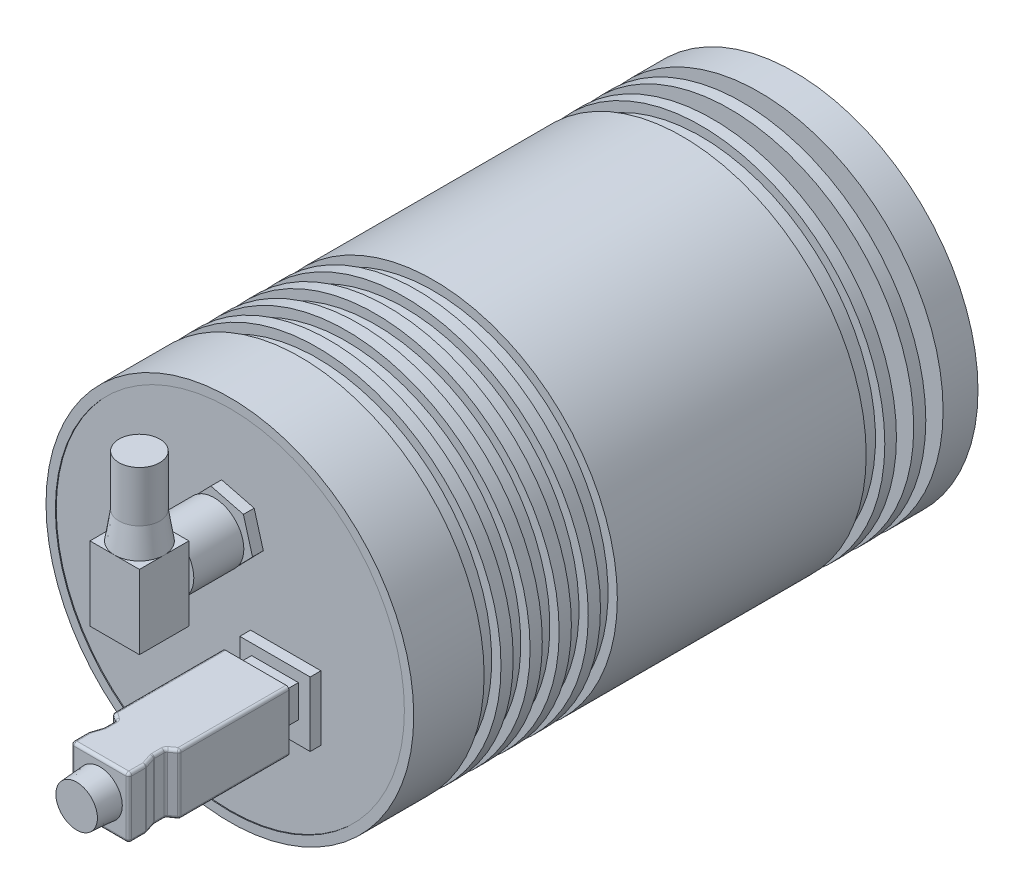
ISO-10303-21;
HEADER;
FILE_DESCRIPTION(('STEP AP214'),'2;1');
FILE_NAME('part.step','',(''),(''),'','','');
FILE_SCHEMA(('AUTOMOTIVE_DESIGN { 1 0 10303 214 1 1 1 1 }'));
ENDSEC;
DATA;
#1=APPLICATION_CONTEXT('core data for automotive mechanical design processes');
#2=APPLICATION_PROTOCOL_DEFINITION('international standard','automotive_design',2000,#1);
#3=PRODUCT_CONTEXT('',#1,'mechanical');
#4=PRODUCT('Part','Part','',(#3));
#5=PRODUCT_RELATED_PRODUCT_CATEGORY('part','',(#4));
#6=PRODUCT_DEFINITION_FORMATION('','',#4);
#7=PRODUCT_DEFINITION_CONTEXT('part definition',#1,'design');
#8=PRODUCT_DEFINITION('design','',#6,#7);
#9=PRODUCT_DEFINITION_SHAPE('','',#8);
#10=(LENGTH_UNIT() NAMED_UNIT(*) SI_UNIT(.MILLI.,.METRE.));
#11=(NAMED_UNIT(*) PLANE_ANGLE_UNIT() SI_UNIT($,.RADIAN.));
#12=(NAMED_UNIT(*) SI_UNIT($,.STERADIAN.) SOLID_ANGLE_UNIT());
#13=UNCERTAINTY_MEASURE_WITH_UNIT(LENGTH_MEASURE(1.E-05),#10,'distance_accuracy_value','');
#14=(GEOMETRIC_REPRESENTATION_CONTEXT(3) GLOBAL_UNCERTAINTY_ASSIGNED_CONTEXT((#13)) GLOBAL_UNIT_ASSIGNED_CONTEXT((#10,
#11,#12)) REPRESENTATION_CONTEXT('',''));
#15=CARTESIAN_POINT('',(0.,0.,0.));
#16=DIRECTION('',(0.,0.,1.));
#17=DIRECTION('',(1.,0.,0.));
#18=AXIS2_PLACEMENT_3D('',#15,#16,#17);
#19=CARTESIAN_POINT('',(3.757,-11.784,128.8));
#20=DIRECTION('',(0.,0.,1.));
#21=DIRECTION('',(1.,0.,0.));
#22=AXIS2_PLACEMENT_3D('',#19,#20,#21);
#23=PLANE('',#22);
#24=DIRECTION('',(1.,0.,0.));
#25=VECTOR('',#24,1.);
#26=CARTESIAN_POINT('',(14.407,-11.284,128.8));
#27=LINE('',#26,#25);
#28=CARTESIAN_POINT('',(5.007,-11.284,128.8));
#29=VERTEX_POINT('',#28);
#30=CARTESIAN_POINT('',(13.907,-11.284,128.8));
#31=VERTEX_POINT('',#30);
#32=EDGE_CURVE('E457',#29,#31,#27,.T.);
#33=ORIENTED_EDGE('',*,*,#32,.T.);
#34=DIRECTION('',(0.,-1.,0.));
#35=VECTOR('',#34,1.);
#36=CARTESIAN_POINT('',(13.907,-1.384,128.8));
#37=LINE('',#36,#35);
#38=CARTESIAN_POINT('',(13.907,-1.884,128.8));
#39=VERTEX_POINT('',#38);
#40=EDGE_CURVE('E462',#31,#39,#37,.F.);
#41=ORIENTED_EDGE('',*,*,#40,.T.);
#42=DIRECTION('',(-1.,0.,0.));
#43=VECTOR('',#42,1.);
#44=CARTESIAN_POINT('',(4.50700000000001,-1.884,128.8));
#45=LINE('',#44,#43);
#46=CARTESIAN_POINT('',(5.00700000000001,-1.884,128.8));
#47=VERTEX_POINT('',#46);
#48=EDGE_CURVE('E459',#39,#47,#45,.T.);
#49=ORIENTED_EDGE('',*,*,#48,.T.);
#50=DIRECTION('',(0.,1.,0.));
#51=VECTOR('',#50,1.);
#52=CARTESIAN_POINT('',(5.007,-11.784,128.8));
#53=LINE('',#52,#51);
#54=EDGE_CURVE('E455',#47,#29,#53,.F.);
#55=ORIENTED_EDGE('',*,*,#54,.T.);
#56=EDGE_LOOP('',(#33,#41,#49,#55));
#57=FACE_BOUND('',#56,.T.);
#58=CARTESIAN_POINT('',(9.45700000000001,-6.584,128.8));
#59=DIRECTION('',(0.,0.,1.));
#60=DIRECTION('',(1.,0.,0.));
#61=AXIS2_PLACEMENT_3D('',#58,#59,#60);
#62=CIRCLE('',#61,3.85);
#63=CARTESIAN_POINT('',(13.307,-6.584,128.8));
#64=VERTEX_POINT('',#63);
#65=EDGE_CURVE('E643',#64,#64,#62,.T.);
#66=ORIENTED_EDGE('',*,*,#65,.F.);
#67=EDGE_LOOP('',(#66));
#68=FACE_BOUND('',#67,.T.);
#69=ADVANCED_FACE('F30',(#57,#68),#23,.T.);
#70=CARTESIAN_POINT('',(15.507,-12.484,98.7));
#71=DIRECTION('',(0.,0.,-1.));
#72=DIRECTION('',(-1.,0.,0.));
#73=AXIS2_PLACEMENT_3D('',#70,#71,#72);
#74=PLANE('',#73);
#75=DIRECTION('',(0.,-1.,0.));
#76=VECTOR('',#75,1.);
#77=CARTESIAN_POINT('',(15.507,-1.384,98.7));
#78=LINE('',#77,#76);
#79=CARTESIAN_POINT('',(15.507,-1.384,98.7));
#80=VERTEX_POINT('',#79);
#81=CARTESIAN_POINT('',(15.507,-12.484,98.7));
#82=VERTEX_POINT('',#81);
#83=EDGE_CURVE('E975',#80,#82,#78,.T.);
#84=ORIENTED_EDGE('',*,*,#83,.F.);
#85=DIRECTION('',(1.,0.,0.));
#86=VECTOR('',#85,1.);
#87=CARTESIAN_POINT('',(15.507,-1.384,98.7));
#88=LINE('',#87,#86);
#89=CARTESIAN_POINT('',(3.407,-1.384,98.7));
#90=VERTEX_POINT('',#89);
#91=EDGE_CURVE('E986',#90,#80,#88,.T.);
#92=ORIENTED_EDGE('',*,*,#91,.F.);
#93=DIRECTION('',(0.,1.,0.));
#94=VECTOR('',#93,1.);
#95=CARTESIAN_POINT('',(3.407,-1.384,98.7));
#96=LINE('',#95,#94);
#97=CARTESIAN_POINT('',(3.407,-12.484,98.7));
#98=VERTEX_POINT('',#97);
#99=EDGE_CURVE('E983',#98,#90,#96,.T.);
#100=ORIENTED_EDGE('',*,*,#99,.F.);
#101=DIRECTION('',(-1.,0.,0.));
#102=VECTOR('',#101,1.);
#103=CARTESIAN_POINT('',(15.507,-12.484,98.7));
#104=LINE('',#103,#102);
#105=EDGE_CURVE('E980',#82,#98,#104,.T.);
#106=ORIENTED_EDGE('',*,*,#105,.F.);
#107=EDGE_LOOP('',(#84,#92,#100,#106));
#108=FACE_BOUND('',#107,.T.);
#109=DIRECTION('',(0.,-1.,0.));
#110=VECTOR('',#109,1.);
#111=CARTESIAN_POINT('',(5.432,-3.234,98.7));
#112=LINE('',#111,#110);
#113=CARTESIAN_POINT('',(5.432,-3.234,98.7));
#114=VERTEX_POINT('',#113);
#115=CARTESIAN_POINT('',(5.432,-8.784,98.7));
#116=VERTEX_POINT('',#115);
#117=EDGE_CURVE('E835',#114,#116,#112,.T.);
#118=ORIENTED_EDGE('',*,*,#117,.F.);
#119=DIRECTION('',(-1.,0.,0.));
#120=VECTOR('',#119,1.);
#121=CARTESIAN_POINT('',(5.432,-3.234,98.7));
#122=LINE('',#121,#120);
#123=CARTESIAN_POINT('',(13.482,-3.234,98.7));
#124=VERTEX_POINT('',#123);
#125=EDGE_CURVE('E842',#124,#114,#122,.T.);
#126=ORIENTED_EDGE('',*,*,#125,.F.);
#127=DIRECTION('',(0.,1.,0.));
#128=VECTOR('',#127,1.);
#129=CARTESIAN_POINT('',(13.482,-3.234,98.7));
#130=LINE('',#129,#128);
#131=CARTESIAN_POINT('',(13.482,-8.784,98.7));
#132=VERTEX_POINT('',#131);
#133=EDGE_CURVE('E840',#132,#124,#130,.T.);
#134=ORIENTED_EDGE('',*,*,#133,.F.);
#135=DIRECTION('',(0.707106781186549,0.707106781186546,0.));
#136=VECTOR('',#135,1.);
#137=CARTESIAN_POINT('',(12.6445,-9.62149999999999,98.7));
#138=LINE('',#137,#136);
#139=CARTESIAN_POINT('',(11.782,-10.484,98.7));
#140=VERTEX_POINT('',#139);
#141=EDGE_CURVE('E452',#132,#140,#138,.F.);
#142=ORIENTED_EDGE('',*,*,#141,.T.);
#143=DIRECTION('',(1.,0.,0.));
#144=VECTOR('',#143,1.);
#145=CARTESIAN_POINT('',(5.432,-10.484,98.7));
#146=LINE('',#145,#144);
#147=CARTESIAN_POINT('',(7.132,-10.484,98.7));
#148=VERTEX_POINT('',#147);
#149=EDGE_CURVE('E838',#148,#140,#146,.T.);
#150=ORIENTED_EDGE('',*,*,#149,.F.);
#151=DIRECTION('',(0.707106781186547,-0.707106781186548,0.));
#152=VECTOR('',#151,1.);
#153=CARTESIAN_POINT('',(12.3195,-15.6715,98.7));
#154=LINE('',#153,#152);
#155=EDGE_CURVE('E425',#148,#116,#154,.F.);
#156=ORIENTED_EDGE('',*,*,#155,.T.);
#157=EDGE_LOOP('',(#118,#126,#134,#142,#150,#156));
#158=FACE_BOUND('',#157,.T.);
#159=ADVANCED_FACE('F1178',(#108,#158),#74,.F.);
#160=CARTESIAN_POINT('',(4.25,18.0492,116.8));
#161=DIRECTION('',(0.,-1.,0.));
#162=DIRECTION('',(0.,0.,-1.));
#163=AXIS2_PLACEMENT_3D('',#160,#161,#162);
#164=PLANE('',#163);
#165=DIRECTION('',(-1.,0.,0.));
#166=VECTOR('',#165,1.);
#167=CARTESIAN_POINT('',(4.25,18.0492,108.3));
#168=LINE('',#167,#166);
#169=CARTESIAN_POINT('',(4.25,18.0492,108.3));
#170=VERTEX_POINT('',#169);
#171=CARTESIAN_POINT('',(0.,18.0492,108.3));
#172=VERTEX_POINT('',#171);
#173=EDGE_CURVE('E873',#170,#172,#168,.T.);
#174=ORIENTED_EDGE('',*,*,#173,.T.);
#175=CARTESIAN_POINT('',(0.,18.0492,112.55));
#176=DIRECTION('',(0.,-1.,0.));
#177=DIRECTION('',(0.,0.,-1.));
#178=AXIS2_PLACEMENT_3D('',#175,#176,#177);
#179=CIRCLE('',#178,4.25);
#180=CARTESIAN_POINT('',(4.25,18.0492,112.55));
#181=VERTEX_POINT('',#180);
#182=EDGE_CURVE('E863',#172,#181,#179,.T.);
#183=ORIENTED_EDGE('',*,*,#182,.T.);
#184=DIRECTION('',(0.,0.,-1.));
#185=VECTOR('',#184,1.);
#186=CARTESIAN_POINT('',(4.25,18.0492,116.8));
#187=LINE('',#186,#185);
#188=EDGE_CURVE('E904',#181,#170,#187,.T.);
#189=ORIENTED_EDGE('',*,*,#188,.T.);
#190=EDGE_LOOP('',(#174,#183,#189));
#191=FACE_BOUND('',#190,.T.);
#192=ADVANCED_FACE('F1127',(#191),#164,.F.);
#193=CARTESIAN_POINT('',(4.25,18.0492,116.8));
#194=VERTEX_POINT('',#193);
#195=EDGE_CURVE('E905',#194,#181,#187,.T.);
#196=ORIENTED_EDGE('',*,*,#195,.T.);
#197=CARTESIAN_POINT('',(0.,18.0492,116.8));
#198=VERTEX_POINT('',#197);
#199=EDGE_CURVE('E867',#181,#198,#179,.T.);
#200=ORIENTED_EDGE('',*,*,#199,.T.);
#201=DIRECTION('',(-1.,0.,0.));
#202=VECTOR('',#201,1.);
#203=CARTESIAN_POINT('',(4.25,18.0492,116.8));
#204=LINE('',#203,#202);
#205=EDGE_CURVE('E887',#194,#198,#204,.T.);
#206=ORIENTED_EDGE('',*,*,#205,.F.);
#207=EDGE_LOOP('',(#196,#200,#206));
#208=FACE_BOUND('',#207,.T.);
#209=ADVANCED_FACE('F1813',(#208),#164,.F.);
#210=CARTESIAN_POINT('',(-4.25,18.0492,116.8));
#211=VERTEX_POINT('',#210);
#212=EDGE_CURVE('E886',#198,#211,#204,.T.);
#213=ORIENTED_EDGE('',*,*,#212,.F.);
#214=CARTESIAN_POINT('',(-4.25,18.0492,112.55));
#215=VERTEX_POINT('',#214);
#216=EDGE_CURVE('E1139',#198,#215,#179,.T.);
#217=ORIENTED_EDGE('',*,*,#216,.T.);
#218=DIRECTION('',(0.,0.,-1.));
#219=VECTOR('',#218,1.);
#220=CARTESIAN_POINT('',(-4.25,18.0492,116.8));
#221=LINE('',#220,#219);
#222=EDGE_CURVE('E901',#211,#215,#221,.T.);
#223=ORIENTED_EDGE('',*,*,#222,.F.);
#224=EDGE_LOOP('',(#213,#217,#223));
#225=FACE_BOUND('',#224,.T.);
#226=ADVANCED_FACE('F1176',(#225),#164,.F.);
#227=CARTESIAN_POINT('',(0.,12.9492,108.3));
#228=DIRECTION('',(0.,0.,1.));
#229=DIRECTION('',(1.,0.,0.));
#230=AXIS2_PLACEMENT_3D('',#227,#228,#229);
#231=PLANE('',#230);
#232=DIRECTION('',(0.,1.,0.));
#233=VECTOR('',#232,1.);
#234=CARTESIAN_POINT('',(4.25,5.3492,108.3));
#235=LINE('',#234,#233);
#236=CARTESIAN_POINT('',(4.25,10.1300689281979,108.3));
#237=VERTEX_POINT('',#236);
#238=CARTESIAN_POINT('',(4.25,15.7683310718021,108.3));
#239=VERTEX_POINT('',#238);
#240=EDGE_CURVE('E872',#237,#239,#235,.T.);
#241=ORIENTED_EDGE('',*,*,#240,.F.);
#242=CARTESIAN_POINT('',(0.,12.9492,108.3));
#243=DIRECTION('',(0.,0.,1.));
#244=DIRECTION('',(1.,0.,0.));
#245=AXIS2_PLACEMENT_3D('',#242,#243,#244);
#246=CIRCLE('',#245,5.1);
#247=EDGE_CURVE('E911',#237,#239,#246,.T.);
#248=ORIENTED_EDGE('',*,*,#247,.T.);
#249=EDGE_LOOP('',(#241,#248));
#250=FACE_BOUND('',#249,.T.);
#251=ADVANCED_FACE('F1156',(#250),#231,.T.);
#252=CARTESIAN_POINT('',(-4.02757060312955,8.81253366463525,98.7));
#253=DIRECTION('',(0.,0.,1.));
#254=DIRECTION('',(1.,0.,0.));
#255=AXIS2_PLACEMENT_3D('',#252,#253,#254);
#256=PLANE('',#255);
#257=DIRECTION('',(0.271702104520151,-0.962381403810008,0.));
#258=VECTOR('',#257,1.);
#259=CARTESIAN_POINT('',(-5.59624343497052,14.3688452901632,98.7));
#260=LINE('',#259,#258);
#261=CARTESIAN_POINT('',(-5.59624343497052,14.3688452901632,98.7));
#262=VERTEX_POINT('',#261);
#263=CARTESIAN_POINT('',(-4.02757060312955,8.81253366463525,98.7));
#264=VERTEX_POINT('',#263);
#265=EDGE_CURVE('E936',#262,#264,#260,.T.);
#266=ORIENTED_EDGE('',*,*,#265,.T.);
#267=DIRECTION('',(0.969297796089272,-0.245889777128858,0.));
#268=VECTOR('',#267,1.);
#269=CARTESIAN_POINT('',(-4.02757060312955,8.81253366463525,98.7));
#270=LINE('',#269,#268);
#271=CARTESIAN_POINT('',(1.56867283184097,7.39288837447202,98.7));
#272=VERTEX_POINT('',#271);
#273=EDGE_CURVE('E939',#264,#272,#270,.T.);
#274=ORIENTED_EDGE('',*,*,#273,.T.);
#275=DIRECTION('',(0.697595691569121,0.71649162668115,0.));
#276=VECTOR('',#275,1.);
#277=CARTESIAN_POINT('',(1.56867283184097,7.39288837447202,98.7));
#278=LINE('',#277,#276);
#279=CARTESIAN_POINT('',(5.59624343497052,11.5295547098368,98.7));
#280=VERTEX_POINT('',#279);
#281=EDGE_CURVE('E941',#272,#280,#278,.T.);
#282=ORIENTED_EDGE('',*,*,#281,.T.);
#283=DIRECTION('',(-0.271702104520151,0.962381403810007,0.));
#284=VECTOR('',#283,1.);
#285=CARTESIAN_POINT('',(5.59624343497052,11.5295547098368,98.7));
#286=LINE('',#285,#284);
#287=CARTESIAN_POINT('',(4.02757060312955,17.0858663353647,98.7));
#288=VERTEX_POINT('',#287);
#289=EDGE_CURVE('E943',#280,#288,#286,.T.);
#290=ORIENTED_EDGE('',*,*,#289,.T.);
#291=DIRECTION('',(-0.969297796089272,0.245889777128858,0.));
#292=VECTOR('',#291,1.);
#293=CARTESIAN_POINT('',(4.02757060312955,17.0858663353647,98.7));
#294=LINE('',#293,#292);
#295=CARTESIAN_POINT('',(-1.56867283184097,18.505511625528,98.7));
#296=VERTEX_POINT('',#295);
#297=EDGE_CURVE('E945',#288,#296,#294,.T.);
#298=ORIENTED_EDGE('',*,*,#297,.T.);
#299=DIRECTION('',(-0.697595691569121,-0.71649162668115,0.));
#300=VECTOR('',#299,1.);
#301=CARTESIAN_POINT('',(-1.56867283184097,18.505511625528,98.7));
#302=LINE('',#301,#300);
#303=EDGE_CURVE('E947',#296,#262,#302,.T.);
#304=ORIENTED_EDGE('',*,*,#303,.T.);
#305=EDGE_LOOP('',(#266,#274,#282,#290,#298,#304));
#306=FACE_BOUND('',#305,.T.);
#307=CARTESIAN_POINT('',(0.,12.9492,98.7));
#308=DIRECTION('',(0.,0.,1.));
#309=DIRECTION('',(1.,0.,0.));
#310=AXIS2_PLACEMENT_3D('',#307,#308,#309);
#311=CIRCLE('',#310,3.27);
#312=CARTESIAN_POINT('',(3.27,12.9492,98.7));
#313=VERTEX_POINT('',#312);
#314=EDGE_CURVE('E915',#313,#313,#311,.T.);
#315=ORIENTED_EDGE('',*,*,#314,.F.);
#316=EDGE_LOOP('',(#315));
#317=FACE_BOUND('',#316,.T.);
#318=ADVANCED_FACE('F1175',(#306,#317),#256,.T.);
#319=CARTESIAN_POINT('',(0.,0.,96.85));
#320=DIRECTION('',(0.,0.,1.));
#321=DIRECTION('',(1.,0.,0.));
#322=AXIS2_PLACEMENT_3D('',#319,#320,#321);
#323=PLANE('',#322);
#324=CARTESIAN_POINT('',(0.,0.,96.85));
#325=DIRECTION('',(0.,0.,1.));
#326=DIRECTION('',(1.,0.,0.));
#327=AXIS2_PLACEMENT_3D('',#324,#325,#326);
#328=CIRCLE('',#327,30.);
#329=CARTESIAN_POINT('',(30.,0.,96.85));
#330=VERTEX_POINT('',#329);
#331=EDGE_CURVE('E1004',#330,#330,#328,.T.);
#332=ORIENTED_EDGE('',*,*,#331,.T.);
#333=EDGE_LOOP('',(#332));
#334=FACE_BOUND('',#333,.T.);
#335=DIRECTION('',(0.,1.,0.));
#336=VECTOR('',#335,1.);
#337=CARTESIAN_POINT('',(15.507,-1.384,96.85));
#338=LINE('',#337,#336);
#339=CARTESIAN_POINT('',(15.507,-12.484,96.85));
#340=VERTEX_POINT('',#339);
#341=CARTESIAN_POINT('',(15.507,-1.384,96.85));
#342=VERTEX_POINT('',#341);
#343=EDGE_CURVE('E972',#340,#342,#338,.T.);
#344=ORIENTED_EDGE('',*,*,#343,.F.);
#345=DIRECTION('',(1.,0.,0.));
#346=VECTOR('',#345,1.);
#347=CARTESIAN_POINT('',(15.507,-12.484,96.85));
#348=LINE('',#347,#346);
#349=CARTESIAN_POINT('',(3.407,-12.484,96.85));
#350=VERTEX_POINT('',#349);
#351=EDGE_CURVE('E969',#350,#340,#348,.T.);
#352=ORIENTED_EDGE('',*,*,#351,.F.);
#353=DIRECTION('',(0.,-1.,0.));
#354=VECTOR('',#353,1.);
#355=CARTESIAN_POINT('',(3.407,-1.384,96.85));
#356=LINE('',#355,#354);
#357=CARTESIAN_POINT('',(3.407,-1.384,96.85));
#358=VERTEX_POINT('',#357);
#359=EDGE_CURVE('E966',#358,#350,#356,.T.);
#360=ORIENTED_EDGE('',*,*,#359,.F.);
#361=DIRECTION('',(-1.,0.,0.));
#362=VECTOR('',#361,1.);
#363=CARTESIAN_POINT('',(15.507,-1.384,96.85));
#364=LINE('',#363,#362);
#365=EDGE_CURVE('E965',#342,#358,#364,.T.);
#366=ORIENTED_EDGE('',*,*,#365,.F.);
#367=EDGE_LOOP('',(#344,#352,#360,#366));
#368=FACE_BOUND('',#367,.T.);
#369=DIRECTION('',(0.969297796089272,-0.245889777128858,0.));
#370=VECTOR('',#369,1.);
#371=CARTESIAN_POINT('',(-4.02757060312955,8.81253366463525,96.85));
#372=LINE('',#371,#370);
#373=CARTESIAN_POINT('',(-4.02757060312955,8.81253366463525,96.85));
#374=VERTEX_POINT('',#373);
#375=CARTESIAN_POINT('',(1.56867283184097,7.39288837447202,96.85));
#376=VERTEX_POINT('',#375);
#377=EDGE_CURVE('E925',#374,#376,#372,.T.);
#378=ORIENTED_EDGE('',*,*,#377,.F.);
#379=DIRECTION('',(0.271702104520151,-0.962381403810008,0.));
#380=VECTOR('',#379,1.);
#381=CARTESIAN_POINT('',(-5.59624343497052,14.3688452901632,96.85));
#382=LINE('',#381,#380);
#383=CARTESIAN_POINT('',(-5.59624343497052,14.3688452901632,96.85));
#384=VERTEX_POINT('',#383);
#385=EDGE_CURVE('E922',#384,#374,#382,.T.);
#386=ORIENTED_EDGE('',*,*,#385,.F.);
#387=DIRECTION('',(-0.697595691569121,-0.71649162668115,0.));
#388=VECTOR('',#387,1.);
#389=CARTESIAN_POINT('',(-1.56867283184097,18.505511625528,96.85));
#390=LINE('',#389,#388);
#391=CARTESIAN_POINT('',(-1.56867283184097,18.505511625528,96.85));
#392=VERTEX_POINT('',#391);
#393=EDGE_CURVE('E934',#392,#384,#390,.T.);
#394=ORIENTED_EDGE('',*,*,#393,.F.);
#395=DIRECTION('',(-0.969297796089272,0.245889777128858,0.));
#396=VECTOR('',#395,1.);
#397=CARTESIAN_POINT('',(4.02757060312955,17.0858663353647,96.85));
#398=LINE('',#397,#396);
#399=CARTESIAN_POINT('',(4.02757060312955,17.0858663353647,96.85));
#400=VERTEX_POINT('',#399);
#401=EDGE_CURVE('E931',#400,#392,#398,.T.);
#402=ORIENTED_EDGE('',*,*,#401,.F.);
#403=DIRECTION('',(-0.271702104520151,0.962381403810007,0.));
#404=VECTOR('',#403,1.);
#405=CARTESIAN_POINT('',(5.59624343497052,11.5295547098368,96.85));
#406=LINE('',#405,#404);
#407=CARTESIAN_POINT('',(5.59624343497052,11.5295547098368,96.85));
#408=VERTEX_POINT('',#407);
#409=EDGE_CURVE('E929',#408,#400,#406,.T.);
#410=ORIENTED_EDGE('',*,*,#409,.F.);
#411=DIRECTION('',(0.697595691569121,0.71649162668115,0.));
#412=VECTOR('',#411,1.);
#413=CARTESIAN_POINT('',(1.56867283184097,7.39288837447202,96.85));
#414=LINE('',#413,#412);
#415=EDGE_CURVE('E927',#376,#408,#414,.T.);
#416=ORIENTED_EDGE('',*,*,#415,.F.);
#417=EDGE_LOOP('',(#378,#386,#394,#402,#410,#416));
#418=FACE_BOUND('',#417,.T.);
#419=ADVANCED_FACE('F1263',(#334,#368,#418),#323,.T.);
#420=CARTESIAN_POINT('',(0.,0.,97.));
#421=DIRECTION('',(0.,0.,-1.));
#422=DIRECTION('',(-1.,0.,0.));
#423=AXIS2_PLACEMENT_3D('',#420,#421,#422);
#424=CYLINDRICAL_SURFACE('',#423,31.61);
#425=CARTESIAN_POINT('',(0.,0.,67.));
#426=DIRECTION('',(0.,0.,-1.));
#427=DIRECTION('',(-1.,0.,0.));
#428=AXIS2_PLACEMENT_3D('',#425,#426,#427);
#429=CIRCLE('',#428,31.61);
#430=CARTESIAN_POINT('',(-31.61,0.,67.));
#431=VERTEX_POINT('',#430);
#432=EDGE_CURVE('E1022',#431,#431,#429,.T.);
#433=CARTESIAN_POINT('',(0.,0.,64.9));
#434=DIRECTION('',(0.,0.,-1.));
#435=DIRECTION('',(-1.,0.,0.));
#436=AXIS2_PLACEMENT_3D('',#433,#434,#435);
#437=CIRCLE('',#436,31.61);
#438=CARTESIAN_POINT('',(-31.61,0.,64.9));
#439=VERTEX_POINT('',#438);
#440=EDGE_CURVE('E1013',#439,#439,#437,.T.);
#441=CARTESIAN_POINT('',(-31.61,0.,67.));
#442=CARTESIAN_POINT('',(-31.61,0.,66.978125));
#443=CARTESIAN_POINT('',(-31.61,0.,66.95625));
#444=CARTESIAN_POINT('',(-31.61,0.,66.9125));
#445=CARTESIAN_POINT('',(-31.61,0.,66.890625));
#446=CARTESIAN_POINT('',(-31.61,0.,66.846875));
#447=CARTESIAN_POINT('',(-31.61,0.,66.825));
#448=CARTESIAN_POINT('',(-31.61,0.,66.78125));
#449=CARTESIAN_POINT('',(-31.61,0.,66.759375));
#450=CARTESIAN_POINT('',(-31.61,0.,66.715625));
#451=CARTESIAN_POINT('',(-31.61,0.,66.69375));
#452=CARTESIAN_POINT('',(-31.61,0.,66.65));
#453=CARTESIAN_POINT('',(-31.61,0.,66.628125));
#454=CARTESIAN_POINT('',(-31.61,0.,66.584375));
#455=CARTESIAN_POINT('',(-31.61,0.,66.5625));
#456=CARTESIAN_POINT('',(-31.61,0.,66.51875));
#457=CARTESIAN_POINT('',(-31.61,0.,66.496875));
#458=CARTESIAN_POINT('',(-31.61,0.,66.453125));
#459=CARTESIAN_POINT('',(-31.61,0.,66.43125));
#460=CARTESIAN_POINT('',(-31.61,0.,66.3875));
#461=CARTESIAN_POINT('',(-31.61,0.,66.365625));
#462=CARTESIAN_POINT('',(-31.61,0.,66.321875));
#463=CARTESIAN_POINT('',(-31.61,0.,66.3));
#464=CARTESIAN_POINT('',(-31.61,0.,66.25625));
#465=CARTESIAN_POINT('',(-31.61,0.,66.234375));
#466=CARTESIAN_POINT('',(-31.61,0.,66.190625));
#467=CARTESIAN_POINT('',(-31.61,0.,66.16875));
#468=CARTESIAN_POINT('',(-31.61,0.,66.125));
#469=CARTESIAN_POINT('',(-31.61,0.,66.103125));
#470=CARTESIAN_POINT('',(-31.61,0.,66.059375));
#471=CARTESIAN_POINT('',(-31.61,0.,66.0375));
#472=CARTESIAN_POINT('',(-31.61,0.,65.99375));
#473=CARTESIAN_POINT('',(-31.61,0.,65.971875));
#474=CARTESIAN_POINT('',(-31.61,0.,65.928125));
#475=CARTESIAN_POINT('',(-31.61,0.,65.90625));
#476=CARTESIAN_POINT('',(-31.61,0.,65.8625));
#477=CARTESIAN_POINT('',(-31.61,0.,65.840625));
#478=CARTESIAN_POINT('',(-31.61,0.,65.796875));
#479=CARTESIAN_POINT('',(-31.61,0.,65.775));
#480=CARTESIAN_POINT('',(-31.61,0.,65.73125));
#481=CARTESIAN_POINT('',(-31.61,0.,65.709375));
#482=CARTESIAN_POINT('',(-31.61,0.,65.665625));
#483=CARTESIAN_POINT('',(-31.61,0.,65.64375));
#484=CARTESIAN_POINT('',(-31.61,0.,65.6));
#485=CARTESIAN_POINT('',(-31.61,0.,65.578125));
#486=CARTESIAN_POINT('',(-31.61,0.,65.534375));
#487=CARTESIAN_POINT('',(-31.61,0.,65.5125));
#488=CARTESIAN_POINT('',(-31.61,0.,65.46875));
#489=CARTESIAN_POINT('',(-31.61,0.,65.446875));
#490=CARTESIAN_POINT('',(-31.61,0.,65.403125));
#491=CARTESIAN_POINT('',(-31.61,0.,65.38125));
#492=CARTESIAN_POINT('',(-31.61,0.,65.3375));
#493=CARTESIAN_POINT('',(-31.61,0.,65.315625));
#494=CARTESIAN_POINT('',(-31.61,0.,65.271875));
#495=CARTESIAN_POINT('',(-31.61,0.,65.25));
#496=CARTESIAN_POINT('',(-31.61,0.,65.20625));
#497=CARTESIAN_POINT('',(-31.61,0.,65.184375));
#498=CARTESIAN_POINT('',(-31.61,0.,65.140625));
#499=CARTESIAN_POINT('',(-31.61,0.,65.11875));
#500=CARTESIAN_POINT('',(-31.61,0.,65.075));
#501=CARTESIAN_POINT('',(-31.61,0.,65.053125));
#502=CARTESIAN_POINT('',(-31.61,0.,65.009375));
#503=CARTESIAN_POINT('',(-31.61,0.,64.9875));
#504=CARTESIAN_POINT('',(-31.61,0.,64.94375));
#505=CARTESIAN_POINT('',(-31.61,0.,64.921875));
#506=CARTESIAN_POINT('',(-31.61,0.,64.9));
#507=B_SPLINE_CURVE_WITH_KNOTS('',3,(#441,#442,#443,#444,#445,#446,#447,#448,#449,#450,#451,
#452,#453,#454,#455,#456,#457,#458,#459,#460,#461,#462,#463,#464,#465,#466,#467,#468,#469,#470,
#471,#472,#473,#474,#475,#476,#477,#478,#479,#480,#481,#482,#483,#484,#485,#486,#487,#488,#489,
#490,#491,#492,#493,#494,#495,#496,#497,#498,#499,#500,#501,#502,#503,#504,#505,#506),
.UNSPECIFIED.,.F.,.F.,(4,2,2,2,2,2,2,2,2,2,2,2,2,2,2,2,2,2,2,2,2,2,2,2,2,2,2,2,2,2,2,2,4),(0.,
0.0656249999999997,0.131249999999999,0.196874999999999,0.262500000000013,0.328124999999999,
0.393750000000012,0.459374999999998,0.525000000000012,0.590625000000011,0.656250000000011,
0.721875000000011,0.78750000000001,0.85312500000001,0.91875000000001,0.98437500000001,
1.05000000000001,1.11562500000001,1.18125000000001,1.24687500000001,1.31250000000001,
1.37812500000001,1.44375000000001,1.50937500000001,1.57500000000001,1.64062500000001,
1.70625000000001,1.77187500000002,1.83750000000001,1.90312500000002,1.96875000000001,
2.03437500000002,2.1),.UNSPECIFIED.);
#508=EDGE_CURVE('BSEAM1269',#431,#439,#507,.T.);
#509=ORIENTED_EDGE('',*,*,#432,.T.);
#510=ORIENTED_EDGE('',*,*,#440,.F.);
#511=ORIENTED_EDGE('',*,*,#508,.T.);
#512=ORIENTED_EDGE('',*,*,#508,.F.);
#513=EDGE_LOOP('',(#509,#511,#510,#512));
#514=FACE_BOUND('',#513,.T.);
#515=ADVANCED_FACE('F1269',(#514),#424,.T.);
#516=CARTESIAN_POINT('',(0.,0.,72.));
#517=DIRECTION('',(0.,0.,-1.));
#518=DIRECTION('',(-1.,0.,0.));
#519=AXIS2_PLACEMENT_3D('',#516,#517,#518);
#520=CIRCLE('',#519,31.61);
#521=CARTESIAN_POINT('',(-31.61,0.,72.));
#522=VERTEX_POINT('',#521);
#523=EDGE_CURVE('E1034',#522,#522,#520,.T.);
#524=CARTESIAN_POINT('',(0.,0.,69.9));
#525=DIRECTION('',(0.,0.,-1.));
#526=DIRECTION('',(-1.,0.,0.));
#527=AXIS2_PLACEMENT_3D('',#524,#525,#526);
#528=CIRCLE('',#527,31.61);
#529=CARTESIAN_POINT('',(-31.61,0.,69.9));
#530=VERTEX_POINT('',#529);
#531=EDGE_CURVE('E1025',#530,#530,#528,.T.);
#532=CARTESIAN_POINT('',(-31.61,0.,72.));
#533=CARTESIAN_POINT('',(-31.61,0.,71.978125));
#534=CARTESIAN_POINT('',(-31.61,0.,71.95625));
#535=CARTESIAN_POINT('',(-31.61,0.,71.9125));
#536=CARTESIAN_POINT('',(-31.61,0.,71.890625));
#537=CARTESIAN_POINT('',(-31.61,0.,71.846875));
#538=CARTESIAN_POINT('',(-31.61,0.,71.825));
#539=CARTESIAN_POINT('',(-31.61,0.,71.78125));
#540=CARTESIAN_POINT('',(-31.61,0.,71.759375));
#541=CARTESIAN_POINT('',(-31.61,0.,71.715625));
#542=CARTESIAN_POINT('',(-31.61,0.,71.69375));
#543=CARTESIAN_POINT('',(-31.61,0.,71.65));
#544=CARTESIAN_POINT('',(-31.61,0.,71.628125));
#545=CARTESIAN_POINT('',(-31.61,0.,71.584375));
#546=CARTESIAN_POINT('',(-31.61,0.,71.5625));
#547=CARTESIAN_POINT('',(-31.61,0.,71.51875));
#548=CARTESIAN_POINT('',(-31.61,0.,71.496875));
#549=CARTESIAN_POINT('',(-31.61,0.,71.453125));
#550=CARTESIAN_POINT('',(-31.61,0.,71.43125));
#551=CARTESIAN_POINT('',(-31.61,0.,71.3875));
#552=CARTESIAN_POINT('',(-31.61,0.,71.365625));
#553=CARTESIAN_POINT('',(-31.61,0.,71.321875));
#554=CARTESIAN_POINT('',(-31.61,0.,71.3));
#555=CARTESIAN_POINT('',(-31.61,0.,71.25625));
#556=CARTESIAN_POINT('',(-31.61,0.,71.234375));
#557=CARTESIAN_POINT('',(-31.61,0.,71.190625));
#558=CARTESIAN_POINT('',(-31.61,0.,71.16875));
#559=CARTESIAN_POINT('',(-31.61,0.,71.125));
#560=CARTESIAN_POINT('',(-31.61,0.,71.103125));
#561=CARTESIAN_POINT('',(-31.61,0.,71.059375));
#562=CARTESIAN_POINT('',(-31.61,0.,71.0375));
#563=CARTESIAN_POINT('',(-31.61,0.,70.99375));
#564=CARTESIAN_POINT('',(-31.61,0.,70.971875));
#565=CARTESIAN_POINT('',(-31.61,0.,70.928125));
#566=CARTESIAN_POINT('',(-31.61,0.,70.90625));
#567=CARTESIAN_POINT('',(-31.61,0.,70.8625));
#568=CARTESIAN_POINT('',(-31.61,0.,70.840625));
#569=CARTESIAN_POINT('',(-31.61,0.,70.796875));
#570=CARTESIAN_POINT('',(-31.61,0.,70.775));
#571=CARTESIAN_POINT('',(-31.61,0.,70.73125));
#572=CARTESIAN_POINT('',(-31.61,0.,70.709375));
#573=CARTESIAN_POINT('',(-31.61,0.,70.665625));
#574=CARTESIAN_POINT('',(-31.61,0.,70.64375));
#575=CARTESIAN_POINT('',(-31.61,0.,70.6));
#576=CARTESIAN_POINT('',(-31.61,0.,70.578125));
#577=CARTESIAN_POINT('',(-31.61,0.,70.534375));
#578=CARTESIAN_POINT('',(-31.61,0.,70.5125));
#579=CARTESIAN_POINT('',(-31.61,0.,70.46875));
#580=CARTESIAN_POINT('',(-31.61,0.,70.446875));
#581=CARTESIAN_POINT('',(-31.61,0.,70.403125));
#582=CARTESIAN_POINT('',(-31.61,0.,70.38125));
#583=CARTESIAN_POINT('',(-31.61,0.,70.3375));
#584=CARTESIAN_POINT('',(-31.61,0.,70.315625));
#585=CARTESIAN_POINT('',(-31.61,0.,70.271875));
#586=CARTESIAN_POINT('',(-31.61,0.,70.25));
#587=CARTESIAN_POINT('',(-31.61,0.,70.20625));
#588=CARTESIAN_POINT('',(-31.61,0.,70.184375));
#589=CARTESIAN_POINT('',(-31.61,0.,70.140625));
#590=CARTESIAN_POINT('',(-31.61,0.,70.11875));
#591=CARTESIAN_POINT('',(-31.61,0.,70.075));
#592=CARTESIAN_POINT('',(-31.61,0.,70.053125));
#593=CARTESIAN_POINT('',(-31.61,0.,70.009375));
#594=CARTESIAN_POINT('',(-31.61,0.,69.9875));
#595=CARTESIAN_POINT('',(-31.61,0.,69.94375));
#596=CARTESIAN_POINT('',(-31.61,0.,69.921875));
#597=CARTESIAN_POINT('',(-31.61,0.,69.9));
#598=B_SPLINE_CURVE_WITH_KNOTS('',3,(#532,#533,#534,#535,#536,#537,#538,#539,#540,#541,#542,
#543,#544,#545,#546,#547,#548,#549,#550,#551,#552,#553,#554,#555,#556,#557,#558,#559,#560,#561,
#562,#563,#564,#565,#566,#567,#568,#569,#570,#571,#572,#573,#574,#575,#576,#577,#578,#579,#580,
#581,#582,#583,#584,#585,#586,#587,#588,#589,#590,#591,#592,#593,#594,#595,#596,#597),
.UNSPECIFIED.,.F.,.F.,(4,2,2,2,2,2,2,2,2,2,2,2,2,2,2,2,2,2,2,2,2,2,2,2,2,2,2,2,2,2,2,2,4),(0.,
0.0656249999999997,0.131249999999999,0.196874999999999,0.262500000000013,0.328124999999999,
0.393750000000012,0.459374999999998,0.525000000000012,0.590625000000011,0.656250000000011,
0.721875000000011,0.78750000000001,0.85312500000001,0.91875000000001,0.98437500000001,
1.05000000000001,1.11562500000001,1.18125000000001,1.24687500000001,1.31250000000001,
1.37812500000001,1.44375000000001,1.50937500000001,1.57500000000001,1.64062500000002,
1.70625000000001,1.77187500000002,1.83750000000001,1.90312500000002,1.96875000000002,
2.03437500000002,2.10000000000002),.UNSPECIFIED.);
#599=EDGE_CURVE('BSEAM1355',#522,#530,#598,.T.);
#600=ORIENTED_EDGE('',*,*,#523,.T.);
#601=ORIENTED_EDGE('',*,*,#531,.F.);
#602=ORIENTED_EDGE('',*,*,#599,.T.);
#603=ORIENTED_EDGE('',*,*,#599,.F.);
#604=EDGE_LOOP('',(#600,#602,#601,#603));
#605=FACE_BOUND('',#604,.T.);
#606=ADVANCED_FACE('F1355',(#605),#424,.T.);
#607=CARTESIAN_POINT('',(0.,0.,-10.));
#608=DIRECTION('',(0.,0.,-1.));
#609=DIRECTION('',(-1.,0.,0.));
#610=AXIS2_PLACEMENT_3D('',#607,#608,#609);
#611=CYLINDRICAL_SURFACE('',#610,30.01);
#612=CARTESIAN_POINT('',(0.,0.,74.9));
#613=DIRECTION('',(0.,0.,-1.));
#614=DIRECTION('',(-1.,0.,0.));
#615=AXIS2_PLACEMENT_3D('',#612,#613,#614);
#616=CIRCLE('',#615,30.01);
#617=CARTESIAN_POINT('',(-30.01,0.,74.9));
#618=VERTEX_POINT('',#617);
#619=EDGE_CURVE('E1040',#618,#618,#616,.T.);
#620=ORIENTED_EDGE('',*,*,#619,.T.);
#621=EDGE_LOOP('',(#620));
#622=FACE_BOUND('',#621,.T.);
#623=CARTESIAN_POINT('',(0.,0.,72.));
#624=DIRECTION('',(0.,0.,-1.));
#625=DIRECTION('',(-1.,0.,0.));
#626=AXIS2_PLACEMENT_3D('',#623,#624,#625);
#627=CIRCLE('',#626,30.01);
#628=CARTESIAN_POINT('',(-30.01,0.,72.));
#629=VERTEX_POINT('',#628);
#630=EDGE_CURVE('E1031',#629,#629,#627,.T.);
#631=ORIENTED_EDGE('',*,*,#630,.F.);
#632=EDGE_LOOP('',(#631));
#633=FACE_BOUND('',#632,.T.);
#634=ADVANCED_FACE('F1351',(#622,#633),#611,.T.);
#635=CARTESIAN_POINT('',(30.01,0.,74.9));
#636=DIRECTION('',(0.,0.,-1.));
#637=DIRECTION('',(-1.,0.,0.));
#638=AXIS2_PLACEMENT_3D('',#635,#636,#637);
#639=PLANE('',#638);
#640=CARTESIAN_POINT('',(0.,0.,74.9));
#641=DIRECTION('',(0.,0.,-1.));
#642=DIRECTION('',(-1.,0.,0.));
#643=AXIS2_PLACEMENT_3D('',#640,#641,#642);
#644=CIRCLE('',#643,31.61);
#645=CARTESIAN_POINT('',(-31.61,0.,74.9));
#646=VERTEX_POINT('',#645);
#647=EDGE_CURVE('E1037',#646,#646,#644,.T.);
#648=ORIENTED_EDGE('',*,*,#647,.T.);
#649=EDGE_LOOP('',(#648));
#650=FACE_BOUND('',#649,.T.);
#651=ORIENTED_EDGE('',*,*,#619,.F.);
#652=EDGE_LOOP('',(#651));
#653=FACE_BOUND('',#652,.T.);
#654=ADVANCED_FACE('F1347',(#650,#653),#639,.T.);
#655=CARTESIAN_POINT('',(30.01,0.,72.));
#656=DIRECTION('',(0.,0.,1.));
#657=DIRECTION('',(1.,0.,0.));
#658=AXIS2_PLACEMENT_3D('',#655,#656,#657);
#659=PLANE('',#658);
#660=ORIENTED_EDGE('',*,*,#630,.T.);
#661=EDGE_LOOP('',(#660));
#662=FACE_BOUND('',#661,.T.);
#663=ORIENTED_EDGE('',*,*,#523,.F.);
#664=EDGE_LOOP('',(#663));
#665=FACE_BOUND('',#664,.T.);
#666=ADVANCED_FACE('F1343',(#662,#665),#659,.T.);
#667=CARTESIAN_POINT('',(0.,0.,97.));
#668=DIRECTION('',(0.,0.,1.));
#669=DIRECTION('',(1.,0.,0.));
#670=AXIS2_PLACEMENT_3D('',#667,#668,#669);
#671=PLANE('',#670);
#672=CARTESIAN_POINT('',(0.,0.,97.));
#673=DIRECTION('',(0.,0.,1.));
#674=DIRECTION('',(1.,0.,0.));
#675=AXIS2_PLACEMENT_3D('',#672,#673,#674);
#676=CIRCLE('',#675,30.);
#677=CARTESIAN_POINT('',(30.,0.,97.));
#678=VERTEX_POINT('',#677);
#679=EDGE_CURVE('E993',#678,#678,#676,.T.);
#680=ORIENTED_EDGE('',*,*,#679,.F.);
#681=EDGE_LOOP('',(#680));
#682=FACE_BOUND('',#681,.T.);
#683=CARTESIAN_POINT('',(0.,0.,97.));
#684=DIRECTION('',(0.,0.,1.));
#685=DIRECTION('',(1.,0.,0.));
#686=AXIS2_PLACEMENT_3D('',#683,#684,#685);
#687=CIRCLE('',#686,31.61);
#688=CARTESIAN_POINT('',(-31.61,0.,97.));
#689=VERTEX_POINT('',#688);
#690=EDGE_CURVE('E1106',#689,#689,#687,.T.);
#691=ORIENTED_EDGE('',*,*,#690,.T.);
#692=EDGE_LOOP('',(#691));
#693=FACE_BOUND('',#692,.T.);
#694=ADVANCED_FACE('F1346',(#682,#693),#671,.T.);
#695=CARTESIAN_POINT('',(0.,0.,84.9));
#696=DIRECTION('',(0.,0.,-1.));
#697=DIRECTION('',(-1.,0.,0.));
#698=AXIS2_PLACEMENT_3D('',#695,#696,#697);
#699=CIRCLE('',#698,31.61);
#700=CARTESIAN_POINT('',(-31.61,0.,84.9));
#701=VERTEX_POINT('',#700);
#702=EDGE_CURVE('E1061',#701,#701,#699,.T.);
#703=CARTESIAN_POINT('',(-31.61,0.,97.));
#704=CARTESIAN_POINT('',(-31.61,0.,96.8739583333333));
#705=CARTESIAN_POINT('',(-31.61,0.,96.7479166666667));
#706=CARTESIAN_POINT('',(-31.61,0.,96.4958333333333));
#707=CARTESIAN_POINT('',(-31.61,0.,96.3697916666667));
#708=CARTESIAN_POINT('',(-31.61,0.,96.1177083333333));
#709=CARTESIAN_POINT('',(-31.61,0.,95.9916666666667));
#710=CARTESIAN_POINT('',(-31.61,0.,95.7395833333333));
#711=CARTESIAN_POINT('',(-31.61,0.,95.6135416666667));
#712=CARTESIAN_POINT('',(-31.61,0.,95.3614583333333));
#713=CARTESIAN_POINT('',(-31.61,0.,95.2354166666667));
#714=CARTESIAN_POINT('',(-31.61,0.,94.9833333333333));
#715=CARTESIAN_POINT('',(-31.61,0.,94.8572916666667));
#716=CARTESIAN_POINT('',(-31.61,0.,94.6052083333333));
#717=CARTESIAN_POINT('',(-31.61,0.,94.4791666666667));
#718=CARTESIAN_POINT('',(-31.61,0.,94.2270833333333));
#719=CARTESIAN_POINT('',(-31.61,0.,94.1010416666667));
#720=CARTESIAN_POINT('',(-31.61,0.,93.8489583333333));
#721=CARTESIAN_POINT('',(-31.61,0.,93.7229166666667));
#722=CARTESIAN_POINT('',(-31.61,0.,93.4708333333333));
#723=CARTESIAN_POINT('',(-31.61,0.,93.3447916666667));
#724=CARTESIAN_POINT('',(-31.61,0.,93.0927083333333));
#725=CARTESIAN_POINT('',(-31.61,0.,92.9666666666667));
#726=CARTESIAN_POINT('',(-31.61,0.,92.7145833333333));
#727=CARTESIAN_POINT('',(-31.61,0.,92.5885416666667));
#728=CARTESIAN_POINT('',(-31.61,0.,92.3364583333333));
#729=CARTESIAN_POINT('',(-31.61,0.,92.2104166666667));
#730=CARTESIAN_POINT('',(-31.61,0.,91.9583333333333));
#731=CARTESIAN_POINT('',(-31.61,0.,91.8322916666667));
#732=CARTESIAN_POINT('',(-31.61,0.,91.5802083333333));
#733=CARTESIAN_POINT('',(-31.61,0.,91.4541666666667));
#734=CARTESIAN_POINT('',(-31.61,0.,91.2020833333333));
#735=CARTESIAN_POINT('',(-31.61,0.,91.0760416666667));
#736=CARTESIAN_POINT('',(-31.61,0.,90.8239583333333));
#737=CARTESIAN_POINT('',(-31.61,0.,90.6979166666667));
#738=CARTESIAN_POINT('',(-31.61,0.,90.4458333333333));
#739=CARTESIAN_POINT('',(-31.61,0.,90.3197916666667));
#740=CARTESIAN_POINT('',(-31.61,0.,90.0677083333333));
#741=CARTESIAN_POINT('',(-31.61,0.,89.9416666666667));
#742=CARTESIAN_POINT('',(-31.61,0.,89.6895833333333));
#743=CARTESIAN_POINT('',(-31.61,0.,89.5635416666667));
#744=CARTESIAN_POINT('',(-31.61,0.,89.3114583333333));
#745=CARTESIAN_POINT('',(-31.61,0.,89.1854166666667));
#746=CARTESIAN_POINT('',(-31.61,0.,88.9333333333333));
#747=CARTESIAN_POINT('',(-31.61,0.,88.8072916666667));
#748=CARTESIAN_POINT('',(-31.61,0.,88.5552083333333));
#749=CARTESIAN_POINT('',(-31.61,0.,88.4291666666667));
#750=CARTESIAN_POINT('',(-31.61,0.,88.1770833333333));
#751=CARTESIAN_POINT('',(-31.61,0.,88.0510416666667));
#752=CARTESIAN_POINT('',(-31.61,0.,87.7989583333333));
#753=CARTESIAN_POINT('',(-31.61,0.,87.6729166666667));
#754=CARTESIAN_POINT('',(-31.61,0.,87.4208333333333));
#755=CARTESIAN_POINT('',(-31.61,0.,87.2947916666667));
#756=CARTESIAN_POINT('',(-31.61,0.,87.0427083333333));
#757=CARTESIAN_POINT('',(-31.61,0.,86.9166666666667));
#758=CARTESIAN_POINT('',(-31.61,0.,86.6645833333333));
#759=CARTESIAN_POINT('',(-31.61,0.,86.5385416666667));
#760=CARTESIAN_POINT('',(-31.61,0.,86.2864583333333));
#761=CARTESIAN_POINT('',(-31.61,0.,86.1604166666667));
#762=CARTESIAN_POINT('',(-31.61,0.,85.9083333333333));
#763=CARTESIAN_POINT('',(-31.61,0.,85.7822916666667));
#764=CARTESIAN_POINT('',(-31.61,0.,85.5302083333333));
#765=CARTESIAN_POINT('',(-31.61,0.,85.4041666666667));
#766=CARTESIAN_POINT('',(-31.61,0.,85.1520833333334));
#767=CARTESIAN_POINT('',(-31.61,0.,85.0260416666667));
#768=CARTESIAN_POINT('',(-31.61,0.,84.9));
#769=B_SPLINE_CURVE_WITH_KNOTS('',3,(#703,#704,#705,#706,#707,#708,#709,#710,#711,#712,#713,
#714,#715,#716,#717,#718,#719,#720,#721,#722,#723,#724,#725,#726,#727,#728,#729,#730,#731,#732,
#733,#734,#735,#736,#737,#738,#739,#740,#741,#742,#743,#744,#745,#746,#747,#748,#749,#750,#751,
#752,#753,#754,#755,#756,#757,#758,#759,#760,#761,#762,#763,#764,#765,#766,#767,#768),
.UNSPECIFIED.,.F.,.F.,(4,2,2,2,2,2,2,2,2,2,2,2,2,2,2,2,2,2,2,2,2,2,2,2,2,2,2,2,2,2,2,2,4),(0.,
0.378124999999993,0.756249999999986,1.13437499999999,1.51249999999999,1.89062499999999,
2.26874999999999,2.64687499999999,3.02499999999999,3.40312499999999,3.78124999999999,
4.15937499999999,4.53749999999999,4.91562499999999,5.29374999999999,5.67187499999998,
6.04999999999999,6.42812499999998,6.80624999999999,7.18437499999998,7.56249999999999,
7.94062499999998,8.31874999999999,8.69687499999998,9.07499999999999,9.45312499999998,
9.83124999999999,10.209375,10.5875,10.965625,11.34375,11.721875,12.1),.UNSPECIFIED.);
#770=EDGE_CURVE('BSEAM32',#689,#701,#769,.T.);
#771=ORIENTED_EDGE('',*,*,#690,.F.);
#772=ORIENTED_EDGE('',*,*,#702,.F.);
#773=ORIENTED_EDGE('',*,*,#770,.T.);
#774=ORIENTED_EDGE('',*,*,#770,.F.);
#775=EDGE_LOOP('',(#771,#773,#772,#774));
#776=FACE_BOUND('',#775,.T.);
#777=ADVANCED_FACE('F32',(#776),#424,.T.);
#778=CARTESIAN_POINT('',(30.01,0.,84.9));
#779=DIRECTION('',(0.,0.,-1.));
#780=DIRECTION('',(-1.,0.,0.));
#781=AXIS2_PLACEMENT_3D('',#778,#779,#780);
#782=PLANE('',#781);
#783=ORIENTED_EDGE('',*,*,#702,.T.);
#784=EDGE_LOOP('',(#783));
#785=FACE_BOUND('',#784,.T.);
#786=CARTESIAN_POINT('',(0.,0.,84.9));
#787=DIRECTION('',(0.,0.,-1.));
#788=DIRECTION('',(-1.,0.,0.));
#789=AXIS2_PLACEMENT_3D('',#786,#787,#788);
#790=CIRCLE('',#789,30.01);
#791=CARTESIAN_POINT('',(-30.01,0.,84.9));
#792=VERTEX_POINT('',#791);
#793=EDGE_CURVE('E1064',#792,#792,#790,.T.);
#794=ORIENTED_EDGE('',*,*,#793,.F.);
#795=EDGE_LOOP('',(#794));
#796=FACE_BOUND('',#795,.T.);
#797=ADVANCED_FACE('F1375',(#785,#796),#782,.T.);
#798=CARTESIAN_POINT('',(0.,0.,0.));
#799=DIRECTION('',(0.,0.,-1.));
#800=DIRECTION('',(-1.,0.,0.));
#801=AXIS2_PLACEMENT_3D('',#798,#799,#800);
#802=CYLINDRICAL_SURFACE('',#801,30.01);
#803=ORIENTED_EDGE('',*,*,#793,.T.);
#804=EDGE_LOOP('',(#803));
#805=FACE_BOUND('',#804,.T.);
#806=CARTESIAN_POINT('',(0.,0.,82.));
#807=DIRECTION('',(0.,0.,-1.));
#808=DIRECTION('',(-1.,0.,0.));
#809=AXIS2_PLACEMENT_3D('',#806,#807,#808);
#810=CIRCLE('',#809,30.01);
#811=CARTESIAN_POINT('',(-30.01,0.,82.));
#812=VERTEX_POINT('',#811);
#813=EDGE_CURVE('E1055',#812,#812,#810,.T.);
#814=ORIENTED_EDGE('',*,*,#813,.F.);
#815=EDGE_LOOP('',(#814));
#816=FACE_BOUND('',#815,.T.);
#817=ADVANCED_FACE('F1373',(#805,#816),#802,.T.);
#818=CARTESIAN_POINT('',(30.01,0.,82.));
#819=DIRECTION('',(0.,0.,1.));
#820=DIRECTION('',(1.,0.,0.));
#821=AXIS2_PLACEMENT_3D('',#818,#819,#820);
#822=PLANE('',#821);
#823=ORIENTED_EDGE('',*,*,#813,.T.);
#824=EDGE_LOOP('',(#823));
#825=FACE_BOUND('',#824,.T.);
#826=CARTESIAN_POINT('',(0.,0.,82.));
#827=DIRECTION('',(0.,0.,-1.));
#828=DIRECTION('',(-1.,0.,0.));
#829=AXIS2_PLACEMENT_3D('',#826,#827,#828);
#830=CIRCLE('',#829,31.61);
#831=CARTESIAN_POINT('',(-31.61,0.,82.));
#832=VERTEX_POINT('',#831);
#833=EDGE_CURVE('E1058',#832,#832,#830,.T.);
#834=ORIENTED_EDGE('',*,*,#833,.F.);
#835=EDGE_LOOP('',(#834));
#836=FACE_BOUND('',#835,.T.);
#837=ADVANCED_FACE('F1370',(#825,#836),#822,.T.);
#838=CARTESIAN_POINT('',(0.,0.,79.9));
#839=DIRECTION('',(0.,0.,-1.));
#840=DIRECTION('',(-1.,0.,0.));
#841=AXIS2_PLACEMENT_3D('',#838,#839,#840);
#842=CIRCLE('',#841,31.61);
#843=CARTESIAN_POINT('',(-31.61,0.,79.9));
#844=VERTEX_POINT('',#843);
#845=EDGE_CURVE('E1049',#844,#844,#842,.T.);
#846=CARTESIAN_POINT('',(-31.61,0.,82.));
#847=CARTESIAN_POINT('',(-31.61,0.,81.978125));
#848=CARTESIAN_POINT('',(-31.61,0.,81.95625));
#849=CARTESIAN_POINT('',(-31.61,0.,81.9125));
#850=CARTESIAN_POINT('',(-31.61,0.,81.890625));
#851=CARTESIAN_POINT('',(-31.61,0.,81.846875));
#852=CARTESIAN_POINT('',(-31.61,0.,81.825));
#853=CARTESIAN_POINT('',(-31.61,0.,81.78125));
#854=CARTESIAN_POINT('',(-31.61,0.,81.759375));
#855=CARTESIAN_POINT('',(-31.61,0.,81.715625));
#856=CARTESIAN_POINT('',(-31.61,0.,81.69375));
#857=CARTESIAN_POINT('',(-31.61,0.,81.65));
#858=CARTESIAN_POINT('',(-31.61,0.,81.628125));
#859=CARTESIAN_POINT('',(-31.61,0.,81.584375));
#860=CARTESIAN_POINT('',(-31.61,0.,81.5625));
#861=CARTESIAN_POINT('',(-31.61,0.,81.51875));
#862=CARTESIAN_POINT('',(-31.61,0.,81.496875));
#863=CARTESIAN_POINT('',(-31.61,0.,81.453125));
#864=CARTESIAN_POINT('',(-31.61,0.,81.43125));
#865=CARTESIAN_POINT('',(-31.61,0.,81.3875));
#866=CARTESIAN_POINT('',(-31.61,0.,81.365625));
#867=CARTESIAN_POINT('',(-31.61,0.,81.321875));
#868=CARTESIAN_POINT('',(-31.61,0.,81.3));
#869=CARTESIAN_POINT('',(-31.61,0.,81.25625));
#870=CARTESIAN_POINT('',(-31.61,0.,81.234375));
#871=CARTESIAN_POINT('',(-31.61,0.,81.190625));
#872=CARTESIAN_POINT('',(-31.61,0.,81.16875));
#873=CARTESIAN_POINT('',(-31.61,0.,81.125));
#874=CARTESIAN_POINT('',(-31.61,0.,81.103125));
#875=CARTESIAN_POINT('',(-31.61,0.,81.059375));
#876=CARTESIAN_POINT('',(-31.61,0.,81.0375));
#877=CARTESIAN_POINT('',(-31.61,0.,80.99375));
#878=CARTESIAN_POINT('',(-31.61,0.,80.971875));
#879=CARTESIAN_POINT('',(-31.61,0.,80.928125));
#880=CARTESIAN_POINT('',(-31.61,0.,80.90625));
#881=CARTESIAN_POINT('',(-31.61,0.,80.8625));
#882=CARTESIAN_POINT('',(-31.61,0.,80.840625));
#883=CARTESIAN_POINT('',(-31.61,0.,80.796875));
#884=CARTESIAN_POINT('',(-31.61,0.,80.775));
#885=CARTESIAN_POINT('',(-31.61,0.,80.73125));
#886=CARTESIAN_POINT('',(-31.61,0.,80.709375));
#887=CARTESIAN_POINT('',(-31.61,0.,80.665625));
#888=CARTESIAN_POINT('',(-31.61,0.,80.64375));
#889=CARTESIAN_POINT('',(-31.61,0.,80.6));
#890=CARTESIAN_POINT('',(-31.61,0.,80.578125));
#891=CARTESIAN_POINT('',(-31.61,0.,80.534375));
#892=CARTESIAN_POINT('',(-31.61,0.,80.5125));
#893=CARTESIAN_POINT('',(-31.61,0.,80.46875));
#894=CARTESIAN_POINT('',(-31.61,0.,80.446875));
#895=CARTESIAN_POINT('',(-31.61,0.,80.403125));
#896=CARTESIAN_POINT('',(-31.61,0.,80.38125));
#897=CARTESIAN_POINT('',(-31.61,0.,80.3375));
#898=CARTESIAN_POINT('',(-31.61,0.,80.315625));
#899=CARTESIAN_POINT('',(-31.61,0.,80.271875));
#900=CARTESIAN_POINT('',(-31.61,0.,80.25));
#901=CARTESIAN_POINT('',(-31.61,0.,80.20625));
#902=CARTESIAN_POINT('',(-31.61,0.,80.184375));
#903=CARTESIAN_POINT('',(-31.61,0.,80.140625));
#904=CARTESIAN_POINT('',(-31.61,0.,80.11875));
#905=CARTESIAN_POINT('',(-31.61,0.,80.075));
#906=CARTESIAN_POINT('',(-31.61,0.,80.053125));
#907=CARTESIAN_POINT('',(-31.61,0.,80.009375));
#908=CARTESIAN_POINT('',(-31.61,0.,79.9875));
#909=CARTESIAN_POINT('',(-31.61,0.,79.94375));
#910=CARTESIAN_POINT('',(-31.61,0.,79.921875));
#911=CARTESIAN_POINT('',(-31.61,0.,79.9));
#912=B_SPLINE_CURVE_WITH_KNOTS('',3,(#846,#847,#848,#849,#850,#851,#852,#853,#854,#855,#856,
#857,#858,#859,#860,#861,#862,#863,#864,#865,#866,#867,#868,#869,#870,#871,#872,#873,#874,#875,
#876,#877,#878,#879,#880,#881,#882,#883,#884,#885,#886,#887,#888,#889,#890,#891,#892,#893,#894,
#895,#896,#897,#898,#899,#900,#901,#902,#903,#904,#905,#906,#907,#908,#909,#910,#911),
.UNSPECIFIED.,.F.,.F.,(4,2,2,2,2,2,2,2,2,2,2,2,2,2,2,2,2,2,2,2,2,2,2,2,2,2,2,2,2,2,2,2,4),(0.,
0.0656249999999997,0.131249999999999,0.196874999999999,0.262499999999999,0.328124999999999,
0.393749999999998,0.459374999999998,0.524999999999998,0.590624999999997,0.656249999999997,
0.721874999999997,0.787499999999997,0.853124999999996,0.918749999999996,0.984374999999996,1.05,
1.115625,1.18124999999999,1.24687499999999,1.31249999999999,1.37812499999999,1.44374999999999,
1.50937499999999,1.57499999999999,1.64062499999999,1.70624999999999,1.77187499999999,
1.83749999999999,1.90312499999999,1.96874999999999,2.03437499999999,2.09999999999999),.UNSPECIFIED.);
#913=EDGE_CURVE('BSEAM1365',#832,#844,#912,.T.);
#914=ORIENTED_EDGE('',*,*,#833,.T.);
#915=ORIENTED_EDGE('',*,*,#845,.F.);
#916=ORIENTED_EDGE('',*,*,#913,.T.);
#917=ORIENTED_EDGE('',*,*,#913,.F.);
#918=EDGE_LOOP('',(#914,#916,#915,#917));
#919=FACE_BOUND('',#918,.T.);
#920=ADVANCED_FACE('F1365',(#919),#424,.T.);
#921=CARTESIAN_POINT('',(30.01,0.,79.9));
#922=DIRECTION('',(0.,0.,-1.));
#923=DIRECTION('',(-1.,0.,0.));
#924=AXIS2_PLACEMENT_3D('',#921,#922,#923);
#925=PLANE('',#924);
#926=ORIENTED_EDGE('',*,*,#845,.T.);
#927=EDGE_LOOP('',(#926));
#928=FACE_BOUND('',#927,.T.);
#929=CARTESIAN_POINT('',(0.,0.,79.9));
#930=DIRECTION('',(0.,0.,-1.));
#931=DIRECTION('',(-1.,0.,0.));
#932=AXIS2_PLACEMENT_3D('',#929,#930,#931);
#933=CIRCLE('',#932,30.01);
#934=CARTESIAN_POINT('',(-30.01,0.,79.9));
#935=VERTEX_POINT('',#934);
#936=EDGE_CURVE('E1052',#935,#935,#933,.T.);
#937=ORIENTED_EDGE('',*,*,#936,.F.);
#938=EDGE_LOOP('',(#937));
#939=FACE_BOUND('',#938,.T.);
#940=ADVANCED_FACE('F1362',(#928,#939),#925,.T.);
#941=CARTESIAN_POINT('',(0.,0.,-5.));
#942=DIRECTION('',(0.,0.,-1.));
#943=DIRECTION('',(-1.,0.,0.));
#944=AXIS2_PLACEMENT_3D('',#941,#942,#943);
#945=CYLINDRICAL_SURFACE('',#944,30.01);
#946=ORIENTED_EDGE('',*,*,#936,.T.);
#947=EDGE_LOOP('',(#946));
#948=FACE_BOUND('',#947,.T.);
#949=CARTESIAN_POINT('',(0.,0.,77.));
#950=DIRECTION('',(0.,0.,-1.));
#951=DIRECTION('',(-1.,0.,0.));
#952=AXIS2_PLACEMENT_3D('',#949,#950,#951);
#953=CIRCLE('',#952,30.01);
#954=CARTESIAN_POINT('',(-30.01,0.,77.));
#955=VERTEX_POINT('',#954);
#956=EDGE_CURVE('E1043',#955,#955,#953,.T.);
#957=ORIENTED_EDGE('',*,*,#956,.F.);
#958=EDGE_LOOP('',(#957));
#959=FACE_BOUND('',#958,.T.);
#960=ADVANCED_FACE('F1360',(#948,#959),#945,.T.);
#961=CARTESIAN_POINT('',(30.01,0.,77.));
#962=DIRECTION('',(0.,0.,1.));
#963=DIRECTION('',(1.,0.,0.));
#964=AXIS2_PLACEMENT_3D('',#961,#962,#963);
#965=PLANE('',#964);
#966=ORIENTED_EDGE('',*,*,#956,.T.);
#967=EDGE_LOOP('',(#966));
#968=FACE_BOUND('',#967,.T.);
#969=CARTESIAN_POINT('',(0.,0.,77.));
#970=DIRECTION('',(0.,0.,-1.));
#971=DIRECTION('',(-1.,0.,0.));
#972=AXIS2_PLACEMENT_3D('',#969,#970,#971);
#973=CIRCLE('',#972,31.61);
#974=CARTESIAN_POINT('',(-31.61,0.,77.));
#975=VERTEX_POINT('',#974);
#976=EDGE_CURVE('E1046',#975,#975,#973,.T.);
#977=ORIENTED_EDGE('',*,*,#976,.F.);
#978=EDGE_LOOP('',(#977));
#979=FACE_BOUND('',#978,.T.);
#980=ADVANCED_FACE('F1357',(#968,#979),#965,.T.);
#981=CARTESIAN_POINT('',(-31.61,0.,77.));
#982=CARTESIAN_POINT('',(-31.61,0.,76.978125));
#983=CARTESIAN_POINT('',(-31.61,0.,76.95625));
#984=CARTESIAN_POINT('',(-31.61,0.,76.9125));
#985=CARTESIAN_POINT('',(-31.61,0.,76.890625));
#986=CARTESIAN_POINT('',(-31.61,0.,76.846875));
#987=CARTESIAN_POINT('',(-31.61,0.,76.825));
#988=CARTESIAN_POINT('',(-31.61,0.,76.78125));
#989=CARTESIAN_POINT('',(-31.61,0.,76.759375));
#990=CARTESIAN_POINT('',(-31.61,0.,76.715625));
#991=CARTESIAN_POINT('',(-31.61,0.,76.69375));
#992=CARTESIAN_POINT('',(-31.61,0.,76.65));
#993=CARTESIAN_POINT('',(-31.61,0.,76.628125));
#994=CARTESIAN_POINT('',(-31.61,0.,76.584375));
#995=CARTESIAN_POINT('',(-31.61,0.,76.5625));
#996=CARTESIAN_POINT('',(-31.61,0.,76.51875));
#997=CARTESIAN_POINT('',(-31.61,0.,76.496875));
#998=CARTESIAN_POINT('',(-31.61,0.,76.453125));
#999=CARTESIAN_POINT('',(-31.61,0.,76.43125));
#1000=CARTESIAN_POINT('',(-31.61,0.,76.3875));
#1001=CARTESIAN_POINT('',(-31.61,0.,76.365625));
#1002=CARTESIAN_POINT('',(-31.61,0.,76.321875));
#1003=CARTESIAN_POINT('',(-31.61,0.,76.3));
#1004=CARTESIAN_POINT('',(-31.61,0.,76.25625));
#1005=CARTESIAN_POINT('',(-31.61,0.,76.234375));
#1006=CARTESIAN_POINT('',(-31.61,0.,76.190625));
#1007=CARTESIAN_POINT('',(-31.61,0.,76.16875));
#1008=CARTESIAN_POINT('',(-31.61,0.,76.125));
#1009=CARTESIAN_POINT('',(-31.61,0.,76.103125));
#1010=CARTESIAN_POINT('',(-31.61,0.,76.059375));
#1011=CARTESIAN_POINT('',(-31.61,0.,76.0375));
#1012=CARTESIAN_POINT('',(-31.61,0.,75.99375));
#1013=CARTESIAN_POINT('',(-31.61,0.,75.971875));
#1014=CARTESIAN_POINT('',(-31.61,0.,75.928125));
#1015=CARTESIAN_POINT('',(-31.61,0.,75.90625));
#1016=CARTESIAN_POINT('',(-31.61,0.,75.8625));
#1017=CARTESIAN_POINT('',(-31.61,0.,75.840625));
#1018=CARTESIAN_POINT('',(-31.61,0.,75.796875));
#1019=CARTESIAN_POINT('',(-31.61,0.,75.775));
#1020=CARTESIAN_POINT('',(-31.61,0.,75.73125));
#1021=CARTESIAN_POINT('',(-31.61,0.,75.709375));
#1022=CARTESIAN_POINT('',(-31.61,0.,75.665625));
#1023=CARTESIAN_POINT('',(-31.61,0.,75.64375));
#1024=CARTESIAN_POINT('',(-31.61,0.,75.6));
#1025=CARTESIAN_POINT('',(-31.61,0.,75.578125));
#1026=CARTESIAN_POINT('',(-31.61,0.,75.534375));
#1027=CARTESIAN_POINT('',(-31.61,0.,75.5125));
#1028=CARTESIAN_POINT('',(-31.61,0.,75.46875));
#1029=CARTESIAN_POINT('',(-31.61,0.,75.446875));
#1030=CARTESIAN_POINT('',(-31.61,0.,75.403125));
#1031=CARTESIAN_POINT('',(-31.61,0.,75.38125));
#1032=CARTESIAN_POINT('',(-31.61,0.,75.3375));
#1033=CARTESIAN_POINT('',(-31.61,0.,75.315625));
#1034=CARTESIAN_POINT('',(-31.61,0.,75.271875));
#1035=CARTESIAN_POINT('',(-31.61,0.,75.25));
#1036=CARTESIAN_POINT('',(-31.61,0.,75.20625));
#1037=CARTESIAN_POINT('',(-31.61,0.,75.184375));
#1038=CARTESIAN_POINT('',(-31.61,0.,75.140625));
#1039=CARTESIAN_POINT('',(-31.61,0.,75.11875));
#1040=CARTESIAN_POINT('',(-31.61,0.,75.075));
#1041=CARTESIAN_POINT('',(-31.61,0.,75.053125));
#1042=CARTESIAN_POINT('',(-31.61,0.,75.009375));
#1043=CARTESIAN_POINT('',(-31.61,0.,74.9875));
#1044=CARTESIAN_POINT('',(-31.61,0.,74.94375));
#1045=CARTESIAN_POINT('',(-31.61,0.,74.921875));
#1046=CARTESIAN_POINT('',(-31.61,0.,74.9));
#1047=B_SPLINE_CURVE_WITH_KNOTS('',3,(#981,#982,#983,#984,#985,#986,#987,#988,#989,#990,#991,
#992,#993,#994,#995,#996,#997,#998,#999,#1000,#1001,#1002,#1003,#1004,#1005,#1006,#1007,#1008,
#1009,#1010,#1011,#1012,#1013,#1014,#1015,#1016,#1017,#1018,#1019,#1020,#1021,#1022,#1023,#1024,
#1025,#1026,#1027,#1028,#1029,#1030,#1031,#1032,#1033,#1034,#1035,#1036,#1037,#1038,#1039,#1040,
#1041,#1042,#1043,#1044,#1045,#1046),.UNSPECIFIED.,.F.,.F.,(4,2,2,2,2,2,2,2,2,2,2,2,2,2,2,2,2,2,
2,2,2,2,2,2,2,2,2,2,2,2,2,2,4),(0.,0.0656249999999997,0.131249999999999,0.196874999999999,
0.262499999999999,0.328124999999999,0.393749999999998,0.459374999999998,0.524999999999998,
0.590624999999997,0.656249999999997,0.721874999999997,0.787499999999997,0.853124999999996,
0.918749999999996,0.984374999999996,1.05,1.115625,1.18124999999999,1.24687499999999,
1.31249999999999,1.37812499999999,1.44374999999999,1.50937499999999,1.57499999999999,
1.64062499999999,1.70624999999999,1.77187499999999,1.83749999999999,1.90312499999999,
1.96874999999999,2.03437499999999,2.09999999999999),.UNSPECIFIED.);
#1048=EDGE_CURVE('BSEAM1341',#975,#646,#1047,.T.);
#1049=ORIENTED_EDGE('',*,*,#976,.T.);
#1050=ORIENTED_EDGE('',*,*,#647,.F.);
#1051=ORIENTED_EDGE('',*,*,#1048,.T.);
#1052=ORIENTED_EDGE('',*,*,#1048,.F.);
#1053=EDGE_LOOP('',(#1049,#1051,#1050,#1052));
#1054=FACE_BOUND('',#1053,.T.);
#1055=ADVANCED_FACE('F1341',(#1054),#424,.T.);
#1056=CARTESIAN_POINT('',(0.,0.,-15.));
#1057=DIRECTION('',(0.,0.,-1.));
#1058=DIRECTION('',(-1.,0.,0.));
#1059=AXIS2_PLACEMENT_3D('',#1056,#1057,#1058);
#1060=CYLINDRICAL_SURFACE('',#1059,30.01);
#1061=CARTESIAN_POINT('',(0.,0.,69.9));
#1062=DIRECTION('',(0.,0.,-1.));
#1063=DIRECTION('',(-1.,0.,0.));
#1064=AXIS2_PLACEMENT_3D('',#1061,#1062,#1063);
#1065=CIRCLE('',#1064,30.01);
#1066=CARTESIAN_POINT('',(-30.01,0.,69.9));
#1067=VERTEX_POINT('',#1066);
#1068=EDGE_CURVE('E1028',#1067,#1067,#1065,.T.);
#1069=ORIENTED_EDGE('',*,*,#1068,.T.);
#1070=EDGE_LOOP('',(#1069));
#1071=FACE_BOUND('',#1070,.T.);
#1072=CARTESIAN_POINT('',(0.,0.,67.));
#1073=DIRECTION('',(0.,0.,-1.));
#1074=DIRECTION('',(-1.,0.,0.));
#1075=AXIS2_PLACEMENT_3D('',#1072,#1073,#1074);
#1076=CIRCLE('',#1075,30.01);
#1077=CARTESIAN_POINT('',(-30.01,0.,67.));
#1078=VERTEX_POINT('',#1077);
#1079=EDGE_CURVE('E1019',#1078,#1078,#1076,.T.);
#1080=ORIENTED_EDGE('',*,*,#1079,.F.);
#1081=EDGE_LOOP('',(#1080));
#1082=FACE_BOUND('',#1081,.T.);
#1083=ADVANCED_FACE('F1337',(#1071,#1082),#1060,.T.);
#1084=CARTESIAN_POINT('',(30.01,0.,69.9));
#1085=DIRECTION('',(0.,0.,-1.));
#1086=DIRECTION('',(-1.,0.,0.));
#1087=AXIS2_PLACEMENT_3D('',#1084,#1085,#1086);
#1088=PLANE('',#1087);
#1089=ORIENTED_EDGE('',*,*,#531,.T.);
#1090=EDGE_LOOP('',(#1089));
#1091=FACE_BOUND('',#1090,.T.);
#1092=ORIENTED_EDGE('',*,*,#1068,.F.);
#1093=EDGE_LOOP('',(#1092));
#1094=FACE_BOUND('',#1093,.T.);
#1095=ADVANCED_FACE('F1333',(#1091,#1094),#1088,.T.);
#1096=CARTESIAN_POINT('',(30.01,0.,67.));
#1097=DIRECTION('',(0.,0.,1.));
#1098=DIRECTION('',(1.,0.,0.));
#1099=AXIS2_PLACEMENT_3D('',#1096,#1097,#1098);
#1100=PLANE('',#1099);
#1101=ORIENTED_EDGE('',*,*,#1079,.T.);
#1102=EDGE_LOOP('',(#1101));
#1103=FACE_BOUND('',#1102,.T.);
#1104=ORIENTED_EDGE('',*,*,#432,.F.);
#1105=EDGE_LOOP('',(#1104));
#1106=FACE_BOUND('',#1105,.T.);
#1107=ADVANCED_FACE('F1329',(#1103,#1106),#1100,.T.);
#1108=CARTESIAN_POINT('',(0.,0.,-20.));
#1109=DIRECTION('',(0.,0.,-1.));
#1110=DIRECTION('',(-1.,0.,0.));
#1111=AXIS2_PLACEMENT_3D('',#1108,#1109,#1110);
#1112=CYLINDRICAL_SURFACE('',#1111,30.01);
#1113=CARTESIAN_POINT('',(0.,0.,64.9));
#1114=DIRECTION('',(0.,0.,-1.));
#1115=DIRECTION('',(-1.,0.,0.));
#1116=AXIS2_PLACEMENT_3D('',#1113,#1114,#1115);
#1117=CIRCLE('',#1116,30.01);
#1118=CARTESIAN_POINT('',(-30.01,0.,64.9));
#1119=VERTEX_POINT('',#1118);
#1120=EDGE_CURVE('E1016',#1119,#1119,#1117,.T.);
#1121=ORIENTED_EDGE('',*,*,#1120,.T.);
#1122=EDGE_LOOP('',(#1121));
#1123=FACE_BOUND('',#1122,.T.);
#1124=CARTESIAN_POINT('',(0.,0.,62.));
#1125=DIRECTION('',(0.,0.,-1.));
#1126=DIRECTION('',(-1.,0.,0.));
#1127=AXIS2_PLACEMENT_3D('',#1124,#1125,#1126);
#1128=CIRCLE('',#1127,30.01);
#1129=CARTESIAN_POINT('',(-30.01,0.,62.));
#1130=VERTEX_POINT('',#1129);
#1131=EDGE_CURVE('E1007',#1130,#1130,#1128,.T.);
#1132=ORIENTED_EDGE('',*,*,#1131,.F.);
#1133=EDGE_LOOP('',(#1132));
#1134=FACE_BOUND('',#1133,.T.);
#1135=ADVANCED_FACE('F1325',(#1123,#1134),#1112,.T.);
#1136=CARTESIAN_POINT('',(30.01,0.,64.9));
#1137=DIRECTION('',(0.,0.,-1.));
#1138=DIRECTION('',(-1.,0.,0.));
#1139=AXIS2_PLACEMENT_3D('',#1136,#1137,#1138);
#1140=PLANE('',#1139);
#1141=ORIENTED_EDGE('',*,*,#440,.T.);
#1142=EDGE_LOOP('',(#1141));
#1143=FACE_BOUND('',#1142,.T.);
#1144=ORIENTED_EDGE('',*,*,#1120,.F.);
#1145=EDGE_LOOP('',(#1144));
#1146=FACE_BOUND('',#1145,.T.);
#1147=ADVANCED_FACE('F1321',(#1143,#1146),#1140,.T.);
#1148=CARTESIAN_POINT('',(30.01,0.,62.));
#1149=DIRECTION('',(0.,0.,1.));
#1150=DIRECTION('',(1.,0.,0.));
#1151=AXIS2_PLACEMENT_3D('',#1148,#1149,#1150);
#1152=PLANE('',#1151);
#1153=ORIENTED_EDGE('',*,*,#1131,.T.);
#1154=EDGE_LOOP('',(#1153));
#1155=FACE_BOUND('',#1154,.T.);
#1156=CARTESIAN_POINT('',(0.,0.,62.));
#1157=DIRECTION('',(0.,0.,-1.));
#1158=DIRECTION('',(-1.,0.,0.));
#1159=AXIS2_PLACEMENT_3D('',#1156,#1157,#1158);
#1160=CIRCLE('',#1159,31.61);
#1161=CARTESIAN_POINT('',(-31.61,0.,62.));
#1162=VERTEX_POINT('',#1161);
#1163=EDGE_CURVE('E1010',#1162,#1162,#1160,.T.);
#1164=ORIENTED_EDGE('',*,*,#1163,.F.);
#1165=EDGE_LOOP('',(#1164));
#1166=FACE_BOUND('',#1165,.T.);
#1167=ADVANCED_FACE('F1317',(#1155,#1166),#1152,.T.);
#1168=CARTESIAN_POINT('',(0.,0.,0.));
#1169=DIRECTION('',(0.,0.,1.));
#1170=DIRECTION('',(1.,0.,0.));
#1171=AXIS2_PLACEMENT_3D('',#1168,#1169,#1170);
#1172=PLANE('',#1171);
#1173=CARTESIAN_POINT('',(0.,0.,0.));
#1174=DIRECTION('',(0.,0.,1.));
#1175=DIRECTION('',(1.,0.,0.));
#1176=AXIS2_PLACEMENT_3D('',#1173,#1174,#1175);
#1177=CIRCLE('',#1176,31.61);
#1178=CARTESIAN_POINT('',(-31.61,0.,0.));
#1179=VERTEX_POINT('',#1178);
#1180=EDGE_CURVE('E1103',#1179,#1179,#1177,.T.);
#1181=ORIENTED_EDGE('',*,*,#1180,.F.);
#1182=EDGE_LOOP('',(#1181));
#1183=FACE_BOUND('',#1182,.T.);
#1184=ADVANCED_FACE('F1320',(#1183),#1172,.F.);
#1185=CARTESIAN_POINT('',(0.,0.,6.));
#1186=DIRECTION('',(0.,0.,-1.));
#1187=DIRECTION('',(-1.,0.,0.));
#1188=AXIS2_PLACEMENT_3D('',#1185,#1186,#1187);
#1189=CIRCLE('',#1188,31.61);
#1190=CARTESIAN_POINT('',(-31.61,0.,5.99999999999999));
#1191=VERTEX_POINT('',#1190);
#1192=EDGE_CURVE('E1094',#1191,#1191,#1189,.T.);
#1193=CARTESIAN_POINT('',(-31.61,0.,0.));
#1194=CARTESIAN_POINT('',(-31.61,0.,0.0624999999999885));
#1195=CARTESIAN_POINT('',(-31.61,0.,0.124999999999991));
#1196=CARTESIAN_POINT('',(-31.61,0.,0.249999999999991));
#1197=CARTESIAN_POINT('',(-31.61,0.,0.312499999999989));
#1198=CARTESIAN_POINT('',(-31.61,0.,0.437499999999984));
#1199=CARTESIAN_POINT('',(-31.61,0.,0.499999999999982));
#1200=CARTESIAN_POINT('',(-31.61,0.,0.624999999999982));
#1201=CARTESIAN_POINT('',(-31.61,0.,0.687499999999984));
#1202=CARTESIAN_POINT('',(-31.61,0.,0.812499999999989));
#1203=CARTESIAN_POINT('',(-31.61,0.,0.874999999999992));
#1204=CARTESIAN_POINT('',(-31.61,0.,0.999999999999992));
#1205=CARTESIAN_POINT('',(-31.61,0.,1.06249999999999));
#1206=CARTESIAN_POINT('',(-31.61,0.,1.18749999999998));
#1207=CARTESIAN_POINT('',(-31.61,0.,1.24999999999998));
#1208=CARTESIAN_POINT('',(-31.61,0.,1.37499999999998));
#1209=CARTESIAN_POINT('',(-31.61,0.,1.43749999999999));
#1210=CARTESIAN_POINT('',(-31.61,0.,1.56249999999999));
#1211=CARTESIAN_POINT('',(-31.61,0.,1.62499999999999));
#1212=CARTESIAN_POINT('',(-31.61,0.,1.74999999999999));
#1213=CARTESIAN_POINT('',(-31.61,0.,1.81249999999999));
#1214=CARTESIAN_POINT('',(-31.61,0.,1.93749999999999));
#1215=CARTESIAN_POINT('',(-31.61,0.,1.99999999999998));
#1216=CARTESIAN_POINT('',(-31.61,0.,2.12499999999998));
#1217=CARTESIAN_POINT('',(-31.61,0.,2.18749999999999));
#1218=CARTESIAN_POINT('',(-31.61,0.,2.31249999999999));
#1219=CARTESIAN_POINT('',(-31.61,0.,2.37499999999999));
#1220=CARTESIAN_POINT('',(-31.61,0.,2.49999999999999));
#1221=CARTESIAN_POINT('',(-31.61,0.,2.56249999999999));
#1222=CARTESIAN_POINT('',(-31.61,0.,2.68749999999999));
#1223=CARTESIAN_POINT('',(-31.61,0.,2.74999999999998));
#1224=CARTESIAN_POINT('',(-31.61,0.,2.87499999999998));
#1225=CARTESIAN_POINT('',(-31.61,0.,2.93749999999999));
#1226=CARTESIAN_POINT('',(-31.61,0.,3.06249999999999));
#1227=CARTESIAN_POINT('',(-31.61,0.,3.12499999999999));
#1228=CARTESIAN_POINT('',(-31.61,0.,3.24999999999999));
#1229=CARTESIAN_POINT('',(-31.61,0.,3.31249999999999));
#1230=CARTESIAN_POINT('',(-31.61,0.,3.43749999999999));
#1231=CARTESIAN_POINT('',(-31.61,0.,3.49999999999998));
#1232=CARTESIAN_POINT('',(-31.61,0.,3.62499999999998));
#1233=CARTESIAN_POINT('',(-31.61,0.,3.68749999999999));
#1234=CARTESIAN_POINT('',(-31.61,0.,3.81249999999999));
#1235=CARTESIAN_POINT('',(-31.61,0.,3.87499999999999));
#1236=CARTESIAN_POINT('',(-31.61,0.,3.99999999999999));
#1237=CARTESIAN_POINT('',(-31.61,0.,4.06249999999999));
#1238=CARTESIAN_POINT('',(-31.61,0.,4.18749999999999));
#1239=CARTESIAN_POINT('',(-31.61,0.,4.24999999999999));
#1240=CARTESIAN_POINT('',(-31.61,0.,4.37499999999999));
#1241=CARTESIAN_POINT('',(-31.61,0.,4.43749999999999));
#1242=CARTESIAN_POINT('',(-31.61,0.,4.56249999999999));
#1243=CARTESIAN_POINT('',(-31.61,0.,4.62499999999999));
#1244=CARTESIAN_POINT('',(-31.61,0.,4.74999999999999));
#1245=CARTESIAN_POINT('',(-31.61,0.,4.81249999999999));
#1246=CARTESIAN_POINT('',(-31.61,0.,4.93749999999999));
#1247=CARTESIAN_POINT('',(-31.61,0.,4.99999999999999));
#1248=CARTESIAN_POINT('',(-31.61,0.,5.12499999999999));
#1249=CARTESIAN_POINT('',(-31.61,0.,5.18749999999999));
#1250=CARTESIAN_POINT('',(-31.61,0.,5.31249999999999));
#1251=CARTESIAN_POINT('',(-31.61,0.,5.375));
#1252=CARTESIAN_POINT('',(-31.61,0.,5.5));
#1253=CARTESIAN_POINT('',(-31.61,0.,5.56249999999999));
#1254=CARTESIAN_POINT('',(-31.61,0.,5.68749999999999));
#1255=CARTESIAN_POINT('',(-31.61,0.,5.74999999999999));
#1256=CARTESIAN_POINT('',(-31.61,0.,5.87499999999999));
#1257=CARTESIAN_POINT('',(-31.61,0.,5.93749999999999));
#1258=CARTESIAN_POINT('',(-31.61,0.,5.99999999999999));
#1259=B_SPLINE_CURVE_WITH_KNOTS('',3,(#1193,#1194,#1195,#1196,#1197,#1198,#1199,#1200,#1201,
#1202,#1203,#1204,#1205,#1206,#1207,#1208,#1209,#1210,#1211,#1212,#1213,#1214,#1215,#1216,#1217,
#1218,#1219,#1220,#1221,#1222,#1223,#1224,#1225,#1226,#1227,#1228,#1229,#1230,#1231,#1232,#1233,
#1234,#1235,#1236,#1237,#1238,#1239,#1240,#1241,#1242,#1243,#1244,#1245,#1246,#1247,#1248,#1249,
#1250,#1251,#1252,#1253,#1254,#1255,#1256,#1257,#1258),.UNSPECIFIED.,.F.,.F.,(4,2,2,2,2,2,2,2,2,
2,2,2,2,2,2,2,2,2,2,2,2,2,2,2,2,2,2,2,2,2,2,2,4),(0.,0.187500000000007,0.375,0.562499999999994,
0.750000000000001,0.937500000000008,1.125,1.31249999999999,1.5,1.68750000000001,1.875,
2.06249999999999,2.25,2.43750000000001,2.625,2.8125,3.,3.18750000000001,3.375,3.5625,3.75,
3.93750000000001,4.125,4.3125,4.5,4.68750000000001,4.875,5.0625,5.25,5.43750000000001,
5.62500000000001,5.8125,6.00000000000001),.UNSPECIFIED.);
#1260=EDGE_CURVE('BSEAM1412',#1179,#1191,#1259,.T.);
#1261=ORIENTED_EDGE('',*,*,#1180,.T.);
#1262=ORIENTED_EDGE('',*,*,#1192,.T.);
#1263=ORIENTED_EDGE('',*,*,#1260,.T.);
#1264=ORIENTED_EDGE('',*,*,#1260,.F.);
#1265=EDGE_LOOP('',(#1261,#1263,#1262,#1264));
#1266=FACE_BOUND('',#1265,.T.);
#1267=ADVANCED_FACE('F1412',(#1266),#424,.T.);
#1268=CARTESIAN_POINT('',(24.86,0.,6.));
#1269=DIRECTION('',(0.,0.,1.));
#1270=DIRECTION('',(1.,0.,0.));
#1271=AXIS2_PLACEMENT_3D('',#1268,#1269,#1270);
#1272=PLANE('',#1271);
#1273=CARTESIAN_POINT('',(0.,0.,6.));
#1274=DIRECTION('',(0.,0.,-1.));
#1275=DIRECTION('',(-1.,0.,0.));
#1276=AXIS2_PLACEMENT_3D('',#1273,#1274,#1275);
#1277=CIRCLE('',#1276,24.86);
#1278=CARTESIAN_POINT('',(-24.86,0.,6.));
#1279=VERTEX_POINT('',#1278);
#1280=EDGE_CURVE('E1091',#1279,#1279,#1277,.T.);
#1281=ORIENTED_EDGE('',*,*,#1280,.T.);
#1282=EDGE_LOOP('',(#1281));
#1283=FACE_BOUND('',#1282,.T.);
#1284=ORIENTED_EDGE('',*,*,#1192,.F.);
#1285=EDGE_LOOP('',(#1284));
#1286=FACE_BOUND('',#1285,.T.);
#1287=ADVANCED_FACE('F1408',(#1283,#1286),#1272,.T.);
#1288=CARTESIAN_POINT('',(0.,0.,0.));
#1289=DIRECTION('',(0.,0.,-1.));
#1290=DIRECTION('',(-1.,0.,0.));
#1291=AXIS2_PLACEMENT_3D('',#1288,#1289,#1290);
#1292=CYLINDRICAL_SURFACE('',#1291,24.86);
#1293=CARTESIAN_POINT('',(0.,0.,8.97));
#1294=DIRECTION('',(0.,0.,-1.));
#1295=DIRECTION('',(-1.,0.,0.));
#1296=AXIS2_PLACEMENT_3D('',#1293,#1294,#1295);
#1297=CIRCLE('',#1296,24.86);
#1298=CARTESIAN_POINT('',(-24.86,0.,8.97));
#1299=VERTEX_POINT('',#1298);
#1300=EDGE_CURVE('E1100',#1299,#1299,#1297,.T.);
#1301=ORIENTED_EDGE('',*,*,#1300,.T.);
#1302=EDGE_LOOP('',(#1301));
#1303=FACE_BOUND('',#1302,.T.);
#1304=ORIENTED_EDGE('',*,*,#1280,.F.);
#1305=EDGE_LOOP('',(#1304));
#1306=FACE_BOUND('',#1305,.T.);
#1307=ADVANCED_FACE('F1411',(#1303,#1306),#1292,.T.);
#1308=CARTESIAN_POINT('',(24.86,0.,8.97));
#1309=DIRECTION('',(0.,0.,-1.));
#1310=DIRECTION('',(-1.,0.,0.));
#1311=AXIS2_PLACEMENT_3D('',#1308,#1309,#1310);
#1312=PLANE('',#1311);
#1313=CARTESIAN_POINT('',(0.,0.,8.97));
#1314=DIRECTION('',(0.,0.,-1.));
#1315=DIRECTION('',(-1.,0.,0.));
#1316=AXIS2_PLACEMENT_3D('',#1313,#1314,#1315);
#1317=CIRCLE('',#1316,31.61);
#1318=CARTESIAN_POINT('',(-31.61,0.,8.96999999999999));
#1319=VERTEX_POINT('',#1318);
#1320=EDGE_CURVE('E1097',#1319,#1319,#1317,.T.);
#1321=ORIENTED_EDGE('',*,*,#1320,.T.);
#1322=EDGE_LOOP('',(#1321));
#1323=FACE_BOUND('',#1322,.T.);
#1324=ORIENTED_EDGE('',*,*,#1300,.F.);
#1325=EDGE_LOOP('',(#1324));
#1326=FACE_BOUND('',#1325,.T.);
#1327=ADVANCED_FACE('F1414',(#1323,#1326),#1312,.T.);
#1328=CARTESIAN_POINT('',(0.,0.,11.05));
#1329=DIRECTION('',(0.,0.,-1.));
#1330=DIRECTION('',(-1.,0.,0.));
#1331=AXIS2_PLACEMENT_3D('',#1328,#1329,#1330);
#1332=CIRCLE('',#1331,31.61);
#1333=CARTESIAN_POINT('',(-31.61,0.,11.05));
#1334=VERTEX_POINT('',#1333);
#1335=EDGE_CURVE('E1082',#1334,#1334,#1332,.T.);
#1336=CARTESIAN_POINT('',(-31.61,0.,8.96999999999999));
#1337=CARTESIAN_POINT('',(-31.61,0.,8.99166666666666));
#1338=CARTESIAN_POINT('',(-31.61,0.,9.01333333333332));
#1339=CARTESIAN_POINT('',(-31.61,0.,9.05666666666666));
#1340=CARTESIAN_POINT('',(-31.61,0.,9.07833333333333));
#1341=CARTESIAN_POINT('',(-31.61,0.,9.12166666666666));
#1342=CARTESIAN_POINT('',(-31.61,0.,9.14333333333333));
#1343=CARTESIAN_POINT('',(-31.61,0.,9.18666666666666));
#1344=CARTESIAN_POINT('',(-31.61,0.,9.20833333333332));
#1345=CARTESIAN_POINT('',(-31.61,0.,9.25166666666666));
#1346=CARTESIAN_POINT('',(-31.61,0.,9.27333333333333));
#1347=CARTESIAN_POINT('',(-31.61,0.,9.31666666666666));
#1348=CARTESIAN_POINT('',(-31.61,0.,9.33833333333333));
#1349=CARTESIAN_POINT('',(-31.61,0.,9.38166666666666));
#1350=CARTESIAN_POINT('',(-31.61,0.,9.40333333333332));
#1351=CARTESIAN_POINT('',(-31.61,0.,9.44666666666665));
#1352=CARTESIAN_POINT('',(-31.61,0.,9.46833333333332));
#1353=CARTESIAN_POINT('',(-31.61,0.,9.51166666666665));
#1354=CARTESIAN_POINT('',(-31.61,0.,9.53333333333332));
#1355=CARTESIAN_POINT('',(-31.61,0.,9.57666666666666));
#1356=CARTESIAN_POINT('',(-31.61,0.,9.59833333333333));
#1357=CARTESIAN_POINT('',(-31.61,0.,9.64166666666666));
#1358=CARTESIAN_POINT('',(-31.61,0.,9.66333333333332));
#1359=CARTESIAN_POINT('',(-31.61,0.,9.70666666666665));
#1360=CARTESIAN_POINT('',(-31.61,0.,9.72833333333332));
#1361=CARTESIAN_POINT('',(-31.61,0.,9.77166666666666));
#1362=CARTESIAN_POINT('',(-31.61,0.,9.79333333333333));
#1363=CARTESIAN_POINT('',(-31.61,0.,9.83666666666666));
#1364=CARTESIAN_POINT('',(-31.61,0.,9.85833333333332));
#1365=CARTESIAN_POINT('',(-31.61,0.,9.90166666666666));
#1366=CARTESIAN_POINT('',(-31.61,0.,9.92333333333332));
#1367=CARTESIAN_POINT('',(-31.61,0.,9.96666666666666));
#1368=CARTESIAN_POINT('',(-31.61,0.,9.98833333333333));
#1369=CARTESIAN_POINT('',(-31.61,0.,10.0316666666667));
#1370=CARTESIAN_POINT('',(-31.61,0.,10.0533333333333));
#1371=CARTESIAN_POINT('',(-31.61,0.,10.0966666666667));
#1372=CARTESIAN_POINT('',(-31.61,0.,10.1183333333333));
#1373=CARTESIAN_POINT('',(-31.61,0.,10.1616666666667));
#1374=CARTESIAN_POINT('',(-31.61,0.,10.1833333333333));
#1375=CARTESIAN_POINT('',(-31.61,0.,10.2266666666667));
#1376=CARTESIAN_POINT('',(-31.61,0.,10.2483333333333));
#1377=CARTESIAN_POINT('',(-31.61,0.,10.2916666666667));
#1378=CARTESIAN_POINT('',(-31.61,0.,10.3133333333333));
#1379=CARTESIAN_POINT('',(-31.61,0.,10.3566666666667));
#1380=CARTESIAN_POINT('',(-31.61,0.,10.3783333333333));
#1381=CARTESIAN_POINT('',(-31.61,0.,10.4216666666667));
#1382=CARTESIAN_POINT('',(-31.61,0.,10.4433333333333));
#1383=CARTESIAN_POINT('',(-31.61,0.,10.4866666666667));
#1384=CARTESIAN_POINT('',(-31.61,0.,10.5083333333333));
#1385=CARTESIAN_POINT('',(-31.61,0.,10.5516666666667));
#1386=CARTESIAN_POINT('',(-31.61,0.,10.5733333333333));
#1387=CARTESIAN_POINT('',(-31.61,0.,10.6166666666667));
#1388=CARTESIAN_POINT('',(-31.61,0.,10.6383333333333));
#1389=CARTESIAN_POINT('',(-31.61,0.,10.6816666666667));
#1390=CARTESIAN_POINT('',(-31.61,0.,10.7033333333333));
#1391=CARTESIAN_POINT('',(-31.61,0.,10.7466666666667));
#1392=CARTESIAN_POINT('',(-31.61,0.,10.7683333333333));
#1393=CARTESIAN_POINT('',(-31.61,0.,10.8116666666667));
#1394=CARTESIAN_POINT('',(-31.61,0.,10.8333333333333));
#1395=CARTESIAN_POINT('',(-31.61,0.,10.8766666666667));
#1396=CARTESIAN_POINT('',(-31.61,0.,10.8983333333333));
#1397=CARTESIAN_POINT('',(-31.61,0.,10.9416666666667));
#1398=CARTESIAN_POINT('',(-31.61,0.,10.9633333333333));
#1399=CARTESIAN_POINT('',(-31.61,0.,11.0066666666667));
#1400=CARTESIAN_POINT('',(-31.61,0.,11.0283333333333));
#1401=CARTESIAN_POINT('',(-31.61,0.,11.05));
#1402=B_SPLINE_CURVE_WITH_KNOTS('',3,(#1336,#1337,#1338,#1339,#1340,#1341,#1342,#1343,#1344,
#1345,#1346,#1347,#1348,#1349,#1350,#1351,#1352,#1353,#1354,#1355,#1356,#1357,#1358,#1359,#1360,
#1361,#1362,#1363,#1364,#1365,#1366,#1367,#1368,#1369,#1370,#1371,#1372,#1373,#1374,#1375,#1376,
#1377,#1378,#1379,#1380,#1381,#1382,#1383,#1384,#1385,#1386,#1387,#1388,#1389,#1390,#1391,#1392,
#1393,#1394,#1395,#1396,#1397,#1398,#1399,#1400,#1401),.UNSPECIFIED.,.F.,.F.,(4,2,2,2,2,2,2,2,2,
2,2,2,2,2,2,2,2,2,2,2,2,2,2,2,2,2,2,2,2,2,2,2,4),(0.,0.0649999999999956,0.130000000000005,
0.195000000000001,0.259999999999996,0.325000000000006,0.390000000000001,0.454999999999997,
0.519999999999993,0.585000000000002,0.649999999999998,0.714999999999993,0.780000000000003,
0.844999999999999,0.909999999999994,0.975000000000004,1.04,1.10499999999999,1.17,1.235,1.3,
1.36500000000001,1.43,1.495,1.56000000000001,1.625,1.69,1.75499999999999,1.82,1.885,
1.94999999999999,2.015,2.08),.UNSPECIFIED.);
#1403=EDGE_CURVE('BSEAM1399',#1319,#1334,#1402,.T.);
#1404=ORIENTED_EDGE('',*,*,#1320,.F.);
#1405=ORIENTED_EDGE('',*,*,#1335,.T.);
#1406=ORIENTED_EDGE('',*,*,#1403,.T.);
#1407=ORIENTED_EDGE('',*,*,#1403,.F.);
#1408=EDGE_LOOP('',(#1404,#1406,#1405,#1407));
#1409=FACE_BOUND('',#1408,.T.);
#1410=ADVANCED_FACE('F1399',(#1409),#424,.T.);
#1411=CARTESIAN_POINT('',(24.86,0.,11.05));
#1412=DIRECTION('',(0.,0.,1.));
#1413=DIRECTION('',(1.,0.,0.));
#1414=AXIS2_PLACEMENT_3D('',#1411,#1412,#1413);
#1415=PLANE('',#1414);
#1416=CARTESIAN_POINT('',(0.,0.,11.05));
#1417=DIRECTION('',(0.,0.,-1.));
#1418=DIRECTION('',(-1.,0.,0.));
#1419=AXIS2_PLACEMENT_3D('',#1416,#1417,#1418);
#1420=CIRCLE('',#1419,24.86);
#1421=CARTESIAN_POINT('',(-24.86,0.,11.05));
#1422=VERTEX_POINT('',#1421);
#1423=EDGE_CURVE('E1079',#1422,#1422,#1420,.T.);
#1424=ORIENTED_EDGE('',*,*,#1423,.T.);
#1425=EDGE_LOOP('',(#1424));
#1426=FACE_BOUND('',#1425,.T.);
#1427=ORIENTED_EDGE('',*,*,#1335,.F.);
#1428=EDGE_LOOP('',(#1427));
#1429=FACE_BOUND('',#1428,.T.);
#1430=ADVANCED_FACE('F1395',(#1426,#1429),#1415,.T.);
#1431=CARTESIAN_POINT('',(0.,0.,5.05));
#1432=DIRECTION('',(0.,0.,-1.));
#1433=DIRECTION('',(-1.,0.,0.));
#1434=AXIS2_PLACEMENT_3D('',#1431,#1432,#1433);
#1435=CYLINDRICAL_SURFACE('',#1434,24.86);
#1436=CARTESIAN_POINT('',(0.,0.,14.02));
#1437=DIRECTION('',(0.,0.,-1.));
#1438=DIRECTION('',(-1.,0.,0.));
#1439=AXIS2_PLACEMENT_3D('',#1436,#1437,#1438);
#1440=CIRCLE('',#1439,24.86);
#1441=CARTESIAN_POINT('',(-24.86,0.,14.02));
#1442=VERTEX_POINT('',#1441);
#1443=EDGE_CURVE('E1088',#1442,#1442,#1440,.T.);
#1444=ORIENTED_EDGE('',*,*,#1443,.T.);
#1445=EDGE_LOOP('',(#1444));
#1446=FACE_BOUND('',#1445,.T.);
#1447=ORIENTED_EDGE('',*,*,#1423,.F.);
#1448=EDGE_LOOP('',(#1447));
#1449=FACE_BOUND('',#1448,.T.);
#1450=ADVANCED_FACE('F1398',(#1446,#1449),#1435,.T.);
#1451=CARTESIAN_POINT('',(24.86,0.,14.02));
#1452=DIRECTION('',(0.,0.,-1.));
#1453=DIRECTION('',(-1.,0.,0.));
#1454=AXIS2_PLACEMENT_3D('',#1451,#1452,#1453);
#1455=PLANE('',#1454);
#1456=CARTESIAN_POINT('',(0.,0.,14.02));
#1457=DIRECTION('',(0.,0.,-1.));
#1458=DIRECTION('',(-1.,0.,0.));
#1459=AXIS2_PLACEMENT_3D('',#1456,#1457,#1458);
#1460=CIRCLE('',#1459,31.61);
#1461=CARTESIAN_POINT('',(-31.61,0.,14.02));
#1462=VERTEX_POINT('',#1461);
#1463=EDGE_CURVE('E1085',#1462,#1462,#1460,.T.);
#1464=ORIENTED_EDGE('',*,*,#1463,.T.);
#1465=EDGE_LOOP('',(#1464));
#1466=FACE_BOUND('',#1465,.T.);
#1467=ORIENTED_EDGE('',*,*,#1443,.F.);
#1468=EDGE_LOOP('',(#1467));
#1469=FACE_BOUND('',#1468,.T.);
#1470=ADVANCED_FACE('F1401',(#1466,#1469),#1455,.T.);
#1471=CARTESIAN_POINT('',(0.,0.,16.02));
#1472=DIRECTION('',(0.,0.,-1.));
#1473=DIRECTION('',(-1.,0.,0.));
#1474=AXIS2_PLACEMENT_3D('',#1471,#1472,#1473);
#1475=CIRCLE('',#1474,31.61);
#1476=CARTESIAN_POINT('',(-31.61,0.,16.02));
#1477=VERTEX_POINT('',#1476);
#1478=EDGE_CURVE('E1070',#1477,#1477,#1475,.T.);
#1479=CARTESIAN_POINT('',(-31.61,0.,14.02));
#1480=CARTESIAN_POINT('',(-31.61,0.,14.0408333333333));
#1481=CARTESIAN_POINT('',(-31.61,0.,14.0616666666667));
#1482=CARTESIAN_POINT('',(-31.61,0.,14.1033333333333));
#1483=CARTESIAN_POINT('',(-31.61,0.,14.1241666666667));
#1484=CARTESIAN_POINT('',(-31.61,0.,14.1658333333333));
#1485=CARTESIAN_POINT('',(-31.61,0.,14.1866666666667));
#1486=CARTESIAN_POINT('',(-31.61,0.,14.2283333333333));
#1487=CARTESIAN_POINT('',(-31.61,0.,14.2491666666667));
#1488=CARTESIAN_POINT('',(-31.61,0.,14.2908333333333));
#1489=CARTESIAN_POINT('',(-31.61,0.,14.3116666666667));
#1490=CARTESIAN_POINT('',(-31.61,0.,14.3533333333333));
#1491=CARTESIAN_POINT('',(-31.61,0.,14.3741666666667));
#1492=CARTESIAN_POINT('',(-31.61,0.,14.4158333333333));
#1493=CARTESIAN_POINT('',(-31.61,0.,14.4366666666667));
#1494=CARTESIAN_POINT('',(-31.61,0.,14.4783333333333));
#1495=CARTESIAN_POINT('',(-31.61,0.,14.4991666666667));
#1496=CARTESIAN_POINT('',(-31.61,0.,14.5408333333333));
#1497=CARTESIAN_POINT('',(-31.61,0.,14.5616666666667));
#1498=CARTESIAN_POINT('',(-31.61,0.,14.6033333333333));
#1499=CARTESIAN_POINT('',(-31.61,0.,14.6241666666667));
#1500=CARTESIAN_POINT('',(-31.61,0.,14.6658333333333));
#1501=CARTESIAN_POINT('',(-31.61,0.,14.6866666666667));
#1502=CARTESIAN_POINT('',(-31.61,0.,14.7283333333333));
#1503=CARTESIAN_POINT('',(-31.61,0.,14.7491666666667));
#1504=CARTESIAN_POINT('',(-31.61,0.,14.7908333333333));
#1505=CARTESIAN_POINT('',(-31.61,0.,14.8116666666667));
#1506=CARTESIAN_POINT('',(-31.61,0.,14.8533333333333));
#1507=CARTESIAN_POINT('',(-31.61,0.,14.8741666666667));
#1508=CARTESIAN_POINT('',(-31.61,0.,14.9158333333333));
#1509=CARTESIAN_POINT('',(-31.61,0.,14.9366666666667));
#1510=CARTESIAN_POINT('',(-31.61,0.,14.9783333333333));
#1511=CARTESIAN_POINT('',(-31.61,0.,14.9991666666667));
#1512=CARTESIAN_POINT('',(-31.61,0.,15.0408333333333));
#1513=CARTESIAN_POINT('',(-31.61,0.,15.0616666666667));
#1514=CARTESIAN_POINT('',(-31.61,0.,15.1033333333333));
#1515=CARTESIAN_POINT('',(-31.61,0.,15.1241666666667));
#1516=CARTESIAN_POINT('',(-31.61,0.,15.1658333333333));
#1517=CARTESIAN_POINT('',(-31.61,0.,15.1866666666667));
#1518=CARTESIAN_POINT('',(-31.61,0.,15.2283333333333));
#1519=CARTESIAN_POINT('',(-31.61,0.,15.2491666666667));
#1520=CARTESIAN_POINT('',(-31.61,0.,15.2908333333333));
#1521=CARTESIAN_POINT('',(-31.61,0.,15.3116666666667));
#1522=CARTESIAN_POINT('',(-31.61,0.,15.3533333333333));
#1523=CARTESIAN_POINT('',(-31.61,0.,15.3741666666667));
#1524=CARTESIAN_POINT('',(-31.61,0.,15.4158333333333));
#1525=CARTESIAN_POINT('',(-31.61,0.,15.4366666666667));
#1526=CARTESIAN_POINT('',(-31.61,0.,15.4783333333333));
#1527=CARTESIAN_POINT('',(-31.61,0.,15.4991666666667));
#1528=CARTESIAN_POINT('',(-31.61,0.,15.5408333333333));
#1529=CARTESIAN_POINT('',(-31.61,0.,15.5616666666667));
#1530=CARTESIAN_POINT('',(-31.61,0.,15.6033333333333));
#1531=CARTESIAN_POINT('',(-31.61,0.,15.6241666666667));
#1532=CARTESIAN_POINT('',(-31.61,0.,15.6658333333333));
#1533=CARTESIAN_POINT('',(-31.61,0.,15.6866666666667));
#1534=CARTESIAN_POINT('',(-31.61,0.,15.7283333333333));
#1535=CARTESIAN_POINT('',(-31.61,0.,15.7491666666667));
#1536=CARTESIAN_POINT('',(-31.61,0.,15.7908333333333));
#1537=CARTESIAN_POINT('',(-31.61,0.,15.8116666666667));
#1538=CARTESIAN_POINT('',(-31.61,0.,15.8533333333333));
#1539=CARTESIAN_POINT('',(-31.61,0.,15.8741666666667));
#1540=CARTESIAN_POINT('',(-31.61,0.,15.9158333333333));
#1541=CARTESIAN_POINT('',(-31.61,0.,15.9366666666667));
#1542=CARTESIAN_POINT('',(-31.61,0.,15.9783333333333));
#1543=CARTESIAN_POINT('',(-31.61,0.,15.9991666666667));
#1544=CARTESIAN_POINT('',(-31.61,0.,16.02));
#1545=B_SPLINE_CURVE_WITH_KNOTS('',3,(#1479,#1480,#1481,#1482,#1483,#1484,#1485,#1486,#1487,
#1488,#1489,#1490,#1491,#1492,#1493,#1494,#1495,#1496,#1497,#1498,#1499,#1500,#1501,#1502,#1503,
#1504,#1505,#1506,#1507,#1508,#1509,#1510,#1511,#1512,#1513,#1514,#1515,#1516,#1517,#1518,#1519,
#1520,#1521,#1522,#1523,#1524,#1525,#1526,#1527,#1528,#1529,#1530,#1531,#1532,#1533,#1534,#1535,
#1536,#1537,#1538,#1539,#1540,#1541,#1542,#1543,#1544),.UNSPECIFIED.,.F.,.F.,(4,2,2,2,2,2,2,2,2,
2,2,2,2,2,2,2,2,2,2,2,2,2,2,2,2,2,2,2,2,2,2,2,4),(0.,0.0624999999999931,0.125,0.187500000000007,
0.25,0.312499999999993,0.375,0.437500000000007,0.5,0.562499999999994,0.625000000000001,
0.687500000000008,0.750000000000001,0.812499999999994,0.875000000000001,0.937500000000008,1.,
1.06249999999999,1.125,1.18750000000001,1.25,1.31249999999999,1.375,1.43750000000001,1.5,
1.56249999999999,1.625,1.68750000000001,1.75,1.81249999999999,1.875,1.93750000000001,2.),.UNSPECIFIED.);
#1546=EDGE_CURVE('BSEAM1386',#1462,#1477,#1545,.T.);
#1547=ORIENTED_EDGE('',*,*,#1463,.F.);
#1548=ORIENTED_EDGE('',*,*,#1478,.T.);
#1549=ORIENTED_EDGE('',*,*,#1546,.T.);
#1550=ORIENTED_EDGE('',*,*,#1546,.F.);
#1551=EDGE_LOOP('',(#1547,#1549,#1548,#1550));
#1552=FACE_BOUND('',#1551,.T.);
#1553=ADVANCED_FACE('F1386',(#1552),#424,.T.);
#1554=CARTESIAN_POINT('',(30.01,0.,16.02));
#1555=DIRECTION('',(0.,0.,1.));
#1556=DIRECTION('',(1.,0.,0.));
#1557=AXIS2_PLACEMENT_3D('',#1554,#1555,#1556);
#1558=PLANE('',#1557);
#1559=CARTESIAN_POINT('',(0.,0.,16.02));
#1560=DIRECTION('',(0.,0.,-1.));
#1561=DIRECTION('',(-1.,0.,0.));
#1562=AXIS2_PLACEMENT_3D('',#1559,#1560,#1561);
#1563=CIRCLE('',#1562,30.01);
#1564=CARTESIAN_POINT('',(-30.01,0.,16.02));
#1565=VERTEX_POINT('',#1564);
#1566=EDGE_CURVE('E1067',#1565,#1565,#1563,.T.);
#1567=ORIENTED_EDGE('',*,*,#1566,.T.);
#1568=EDGE_LOOP('',(#1567));
#1569=FACE_BOUND('',#1568,.T.);
#1570=ORIENTED_EDGE('',*,*,#1478,.F.);
#1571=EDGE_LOOP('',(#1570));
#1572=FACE_BOUND('',#1571,.T.);
#1573=ADVANCED_FACE('F1382',(#1569,#1572),#1558,.T.);
#1574=CARTESIAN_POINT('',(0.,0.,0.));
#1575=DIRECTION('',(0.,0.,-1.));
#1576=DIRECTION('',(-1.,0.,0.));
#1577=AXIS2_PLACEMENT_3D('',#1574,#1575,#1576);
#1578=CYLINDRICAL_SURFACE('',#1577,30.01);
#1579=CARTESIAN_POINT('',(0.,0.,19.22));
#1580=DIRECTION('',(0.,0.,-1.));
#1581=DIRECTION('',(-1.,0.,0.));
#1582=AXIS2_PLACEMENT_3D('',#1579,#1580,#1581);
#1583=CIRCLE('',#1582,30.01);
#1584=CARTESIAN_POINT('',(-30.01,0.,19.22));
#1585=VERTEX_POINT('',#1584);
#1586=EDGE_CURVE('E1076',#1585,#1585,#1583,.T.);
#1587=ORIENTED_EDGE('',*,*,#1586,.T.);
#1588=EDGE_LOOP('',(#1587));
#1589=FACE_BOUND('',#1588,.T.);
#1590=ORIENTED_EDGE('',*,*,#1566,.F.);
#1591=EDGE_LOOP('',(#1590));
#1592=FACE_BOUND('',#1591,.T.);
#1593=ADVANCED_FACE('F1385',(#1589,#1592),#1578,.T.);
#1594=CARTESIAN_POINT('',(30.01,0.,19.22));
#1595=DIRECTION('',(0.,0.,-1.));
#1596=DIRECTION('',(-1.,0.,0.));
#1597=AXIS2_PLACEMENT_3D('',#1594,#1595,#1596);
#1598=PLANE('',#1597);
#1599=CARTESIAN_POINT('',(0.,0.,19.22));
#1600=DIRECTION('',(0.,0.,-1.));
#1601=DIRECTION('',(-1.,0.,0.));
#1602=AXIS2_PLACEMENT_3D('',#1599,#1600,#1601);
#1603=CIRCLE('',#1602,31.61);
#1604=CARTESIAN_POINT('',(-31.61,0.,19.22));
#1605=VERTEX_POINT('',#1604);
#1606=EDGE_CURVE('E1073',#1605,#1605,#1603,.T.);
#1607=ORIENTED_EDGE('',*,*,#1606,.T.);
#1608=EDGE_LOOP('',(#1607));
#1609=FACE_BOUND('',#1608,.T.);
#1610=ORIENTED_EDGE('',*,*,#1586,.F.);
#1611=EDGE_LOOP('',(#1610));
#1612=FACE_BOUND('',#1611,.T.);
#1613=ADVANCED_FACE('F1388',(#1609,#1612),#1598,.T.);
#1614=CARTESIAN_POINT('',(-31.61,0.,19.22));
#1615=CARTESIAN_POINT('',(-31.61,0.,19.665625));
#1616=CARTESIAN_POINT('',(-31.61,0.,20.11125));
#1617=CARTESIAN_POINT('',(-31.61,0.,21.0025));
#1618=CARTESIAN_POINT('',(-31.61,0.,21.448125));
#1619=CARTESIAN_POINT('',(-31.61,0.,22.339375));
#1620=CARTESIAN_POINT('',(-31.61,0.,22.785));
#1621=CARTESIAN_POINT('',(-31.61,0.,23.67625));
#1622=CARTESIAN_POINT('',(-31.61,0.,24.121875));
#1623=CARTESIAN_POINT('',(-31.61,0.,25.013125));
#1624=CARTESIAN_POINT('',(-31.61,0.,25.45875));
#1625=CARTESIAN_POINT('',(-31.61,0.,26.35));
#1626=CARTESIAN_POINT('',(-31.61,0.,26.795625));
#1627=CARTESIAN_POINT('',(-31.61,0.,27.686875));
#1628=CARTESIAN_POINT('',(-31.61,0.,28.1325));
#1629=CARTESIAN_POINT('',(-31.61,0.,29.02375));
#1630=CARTESIAN_POINT('',(-31.61,0.,29.469375));
#1631=CARTESIAN_POINT('',(-31.61,0.,30.360625));
#1632=CARTESIAN_POINT('',(-31.61,0.,30.80625));
#1633=CARTESIAN_POINT('',(-31.61,0.,31.6975));
#1634=CARTESIAN_POINT('',(-31.61,0.,32.143125));
#1635=CARTESIAN_POINT('',(-31.61,0.,33.034375));
#1636=CARTESIAN_POINT('',(-31.61,0.,33.48));
#1637=CARTESIAN_POINT('',(-31.61,0.,34.37125));
#1638=CARTESIAN_POINT('',(-31.61,0.,34.816875));
#1639=CARTESIAN_POINT('',(-31.61,0.,35.708125));
#1640=CARTESIAN_POINT('',(-31.61,0.,36.15375));
#1641=CARTESIAN_POINT('',(-31.61,0.,37.045));
#1642=CARTESIAN_POINT('',(-31.61,0.,37.490625));
#1643=CARTESIAN_POINT('',(-31.61,0.,38.381875));
#1644=CARTESIAN_POINT('',(-31.61,0.,38.8275));
#1645=CARTESIAN_POINT('',(-31.61,0.,39.71875));
#1646=CARTESIAN_POINT('',(-31.61,0.,40.164375));
#1647=CARTESIAN_POINT('',(-31.61,0.,41.055625));
#1648=CARTESIAN_POINT('',(-31.61,0.,41.50125));
#1649=CARTESIAN_POINT('',(-31.61,0.,42.3925));
#1650=CARTESIAN_POINT('',(-31.61,0.,42.838125));
#1651=CARTESIAN_POINT('',(-31.61,0.,43.729375));
#1652=CARTESIAN_POINT('',(-31.61,0.,44.175));
#1653=CARTESIAN_POINT('',(-31.61,0.,45.06625));
#1654=CARTESIAN_POINT('',(-31.61,0.,45.511875));
#1655=CARTESIAN_POINT('',(-31.61,0.,46.403125));
#1656=CARTESIAN_POINT('',(-31.61,0.,46.84875));
#1657=CARTESIAN_POINT('',(-31.61,0.,47.74));
#1658=CARTESIAN_POINT('',(-31.61,0.,48.185625));
#1659=CARTESIAN_POINT('',(-31.61,0.,49.076875));
#1660=CARTESIAN_POINT('',(-31.61,0.,49.5225));
#1661=CARTESIAN_POINT('',(-31.61,0.,50.41375));
#1662=CARTESIAN_POINT('',(-31.61,0.,50.859375));
#1663=CARTESIAN_POINT('',(-31.61,0.,51.750625));
#1664=CARTESIAN_POINT('',(-31.61,0.,52.19625));
#1665=CARTESIAN_POINT('',(-31.61,0.,53.0875));
#1666=CARTESIAN_POINT('',(-31.61,0.,53.533125));
#1667=CARTESIAN_POINT('',(-31.61,0.,54.424375));
#1668=CARTESIAN_POINT('',(-31.61,0.,54.87));
#1669=CARTESIAN_POINT('',(-31.61,0.,55.76125));
#1670=CARTESIAN_POINT('',(-31.61,0.,56.206875));
#1671=CARTESIAN_POINT('',(-31.61,0.,57.098125));
#1672=CARTESIAN_POINT('',(-31.61,0.,57.54375));
#1673=CARTESIAN_POINT('',(-31.61,0.,58.435));
#1674=CARTESIAN_POINT('',(-31.61,0.,58.880625));
#1675=CARTESIAN_POINT('',(-31.61,0.,59.771875));
#1676=CARTESIAN_POINT('',(-31.61,0.,60.2175));
#1677=CARTESIAN_POINT('',(-31.61,0.,61.10875));
#1678=CARTESIAN_POINT('',(-31.61,0.,61.554375));
#1679=CARTESIAN_POINT('',(-31.61,0.,62.));
#1680=B_SPLINE_CURVE_WITH_KNOTS('',3,(#1614,#1615,#1616,#1617,#1618,#1619,#1620,#1621,#1622,
#1623,#1624,#1625,#1626,#1627,#1628,#1629,#1630,#1631,#1632,#1633,#1634,#1635,#1636,#1637,#1638,
#1639,#1640,#1641,#1642,#1643,#1644,#1645,#1646,#1647,#1648,#1649,#1650,#1651,#1652,#1653,#1654,
#1655,#1656,#1657,#1658,#1659,#1660,#1661,#1662,#1663,#1664,#1665,#1666,#1667,#1668,#1669,#1670,
#1671,#1672,#1673,#1674,#1675,#1676,#1677,#1678,#1679),.UNSPECIFIED.,.F.,.F.,(4,2,2,2,2,2,2,2,2,
2,2,2,2,2,2,2,2,2,2,2,2,2,2,2,2,2,2,2,2,2,2,2,4),(0.,1.336875,2.67375,4.010625,5.34750000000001,
6.68437500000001,8.02125000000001,9.35812499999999,10.695,12.031875,13.36875,14.705625,16.0425,
17.379375,18.71625,20.053125,21.39,22.726875,24.06375,25.400625,26.7375,28.074375,29.41125,
30.748125,32.085,33.421875,34.75875,36.095625,37.4325,38.769375,40.10625,41.443125,42.78),.UNSPECIFIED.);
#1681=EDGE_CURVE('BSEAM1315',#1605,#1162,#1680,.T.);
#1682=ORIENTED_EDGE('',*,*,#1606,.F.);
#1683=ORIENTED_EDGE('',*,*,#1163,.T.);
#1684=ORIENTED_EDGE('',*,*,#1681,.T.);
#1685=ORIENTED_EDGE('',*,*,#1681,.F.);
#1686=EDGE_LOOP('',(#1682,#1684,#1683,#1685));
#1687=FACE_BOUND('',#1686,.T.);
#1688=ADVANCED_FACE('F1315',(#1687),#424,.T.);
#1689=CARTESIAN_POINT('',(0.,0.,96.85));
#1690=DIRECTION('',(0.,0.,1.));
#1691=DIRECTION('',(1.,0.,0.));
#1692=AXIS2_PLACEMENT_3D('',#1689,#1690,#1691);
#1693=CYLINDRICAL_SURFACE('',#1692,30.);
#1694=ORIENTED_EDGE('',*,*,#331,.F.);
#1695=EDGE_LOOP('',(#1694));
#1696=FACE_BOUND('',#1695,.T.);
#1697=ORIENTED_EDGE('',*,*,#679,.T.);
#1698=EDGE_LOOP('',(#1697));
#1699=FACE_BOUND('',#1698,.T.);
#1700=ADVANCED_FACE('F1310',(#1696,#1699),#1693,.F.);
#1701=CARTESIAN_POINT('',(15.507,-1.384,98.7));
#1702=DIRECTION('',(1.,0.,0.));
#1703=DIRECTION('',(0.,1.,0.));
#1704=AXIS2_PLACEMENT_3D('',#1701,#1702,#1703);
#1705=PLANE('',#1704);
#1706=DIRECTION('',(0.,0.,-1.));
#1707=VECTOR('',#1706,1.);
#1708=CARTESIAN_POINT('',(15.507,-12.484,98.7));
#1709=LINE('',#1708,#1707);
#1710=EDGE_CURVE('E989',#82,#340,#1709,.T.);
#1711=ORIENTED_EDGE('',*,*,#1710,.T.);
#1712=ORIENTED_EDGE('',*,*,#343,.T.);
#1713=DIRECTION('',(0.,0.,-1.));
#1714=VECTOR('',#1713,1.);
#1715=CARTESIAN_POINT('',(15.507,-1.384,98.7));
#1716=LINE('',#1715,#1714);
#1717=EDGE_CURVE('E990',#80,#342,#1716,.T.);
#1718=ORIENTED_EDGE('',*,*,#1717,.F.);
#1719=ORIENTED_EDGE('',*,*,#83,.T.);
#1720=EDGE_LOOP('',(#1711,#1712,#1718,#1719));
#1721=FACE_BOUND('',#1720,.T.);
#1722=ADVANCED_FACE('F1301',(#1721),#1705,.T.);
#1723=CARTESIAN_POINT('',(15.507,-1.384,98.7));
#1724=DIRECTION('',(0.,1.,0.));
#1725=DIRECTION('',(0.,0.,1.));
#1726=AXIS2_PLACEMENT_3D('',#1723,#1724,#1725);
#1727=PLANE('',#1726);
#1728=ORIENTED_EDGE('',*,*,#1717,.T.);
#1729=ORIENTED_EDGE('',*,*,#365,.T.);
#1730=DIRECTION('',(0.,0.,-1.));
#1731=VECTOR('',#1730,1.);
#1732=CARTESIAN_POINT('',(3.407,-1.384,98.7));
#1733=LINE('',#1732,#1731);
#1734=EDGE_CURVE('E994',#90,#358,#1733,.T.);
#1735=ORIENTED_EDGE('',*,*,#1734,.F.);
#1736=ORIENTED_EDGE('',*,*,#91,.T.);
#1737=EDGE_LOOP('',(#1728,#1729,#1735,#1736));
#1738=FACE_BOUND('',#1737,.T.);
#1739=ADVANCED_FACE('F1297',(#1738),#1727,.T.);
#1740=CARTESIAN_POINT('',(3.407,-1.384,98.7));
#1741=DIRECTION('',(-1.,0.,0.));
#1742=DIRECTION('',(0.,-1.,0.));
#1743=AXIS2_PLACEMENT_3D('',#1740,#1741,#1742);
#1744=PLANE('',#1743);
#1745=ORIENTED_EDGE('',*,*,#1734,.T.);
#1746=ORIENTED_EDGE('',*,*,#359,.T.);
#1747=DIRECTION('',(0.,0.,-1.));
#1748=VECTOR('',#1747,1.);
#1749=CARTESIAN_POINT('',(3.407,-12.484,98.7));
#1750=LINE('',#1749,#1748);
#1751=EDGE_CURVE('E997',#98,#350,#1750,.T.);
#1752=ORIENTED_EDGE('',*,*,#1751,.F.);
#1753=ORIENTED_EDGE('',*,*,#99,.T.);
#1754=EDGE_LOOP('',(#1745,#1746,#1752,#1753));
#1755=FACE_BOUND('',#1754,.T.);
#1756=ADVANCED_FACE('F1300',(#1755),#1744,.T.);
#1757=CARTESIAN_POINT('',(15.507,-12.484,98.7));
#1758=DIRECTION('',(0.,-1.,0.));
#1759=DIRECTION('',(0.,0.,-1.));
#1760=AXIS2_PLACEMENT_3D('',#1757,#1758,#1759);
#1761=PLANE('',#1760);
#1762=ORIENTED_EDGE('',*,*,#1751,.T.);
#1763=ORIENTED_EDGE('',*,*,#351,.T.);
#1764=ORIENTED_EDGE('',*,*,#1710,.F.);
#1765=ORIENTED_EDGE('',*,*,#105,.T.);
#1766=EDGE_LOOP('',(#1762,#1763,#1764,#1765));
#1767=FACE_BOUND('',#1766,.T.);
#1768=ADVANCED_FACE('F1294',(#1767),#1761,.T.);
#1769=CARTESIAN_POINT('',(-5.59624343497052,14.3688452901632,98.7));
#1770=DIRECTION('',(0.962381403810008,0.271702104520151,0.));
#1771=DIRECTION('',(-0.271702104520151,0.962381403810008,0.));
#1772=AXIS2_PLACEMENT_3D('',#1769,#1770,#1771);
#1773=PLANE('',#1772);
#1774=ORIENTED_EDGE('',*,*,#385,.T.);
#1775=DIRECTION('',(0.,0.,-1.));
#1776=VECTOR('',#1775,1.);
#1777=CARTESIAN_POINT('',(-4.02757060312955,8.81253366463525,98.7));
#1778=LINE('',#1777,#1776);
#1779=EDGE_CURVE('E963',#264,#374,#1778,.T.);
#1780=ORIENTED_EDGE('',*,*,#1779,.F.);
#1781=ORIENTED_EDGE('',*,*,#265,.F.);
#1782=DIRECTION('',(0.,0.,-1.));
#1783=VECTOR('',#1782,1.);
#1784=CARTESIAN_POINT('',(-5.59624343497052,14.3688452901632,98.7));
#1785=LINE('',#1784,#1783);
#1786=EDGE_CURVE('E949',#262,#384,#1785,.T.);
#1787=ORIENTED_EDGE('',*,*,#1786,.T.);
#1788=EDGE_LOOP('',(#1774,#1780,#1781,#1787));
#1789=FACE_BOUND('',#1788,.T.);
#1790=ADVANCED_FACE('F1291',(#1789),#1773,.F.);
#1791=CARTESIAN_POINT('',(-4.02757060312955,8.81253366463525,98.7));
#1792=DIRECTION('',(0.245889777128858,0.969297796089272,0.));
#1793=DIRECTION('',(-0.969297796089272,0.245889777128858,0.));
#1794=AXIS2_PLACEMENT_3D('',#1791,#1792,#1793);
#1795=PLANE('',#1794);
#1796=ORIENTED_EDGE('',*,*,#377,.T.);
#1797=DIRECTION('',(0.,0.,-1.));
#1798=VECTOR('',#1797,1.);
#1799=CARTESIAN_POINT('',(1.56867283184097,7.39288837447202,98.7));
#1800=LINE('',#1799,#1798);
#1801=EDGE_CURVE('E960',#272,#376,#1800,.T.);
#1802=ORIENTED_EDGE('',*,*,#1801,.F.);
#1803=ORIENTED_EDGE('',*,*,#273,.F.);
#1804=ORIENTED_EDGE('',*,*,#1779,.T.);
#1805=EDGE_LOOP('',(#1796,#1802,#1803,#1804));
#1806=FACE_BOUND('',#1805,.T.);
#1807=ADVANCED_FACE('F1287',(#1806),#1795,.F.);
#1808=CARTESIAN_POINT('',(1.56867283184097,7.39288837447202,98.7));
#1809=DIRECTION('',(-0.71649162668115,0.697595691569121,0.));
#1810=DIRECTION('',(-0.697595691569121,-0.71649162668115,0.));
#1811=AXIS2_PLACEMENT_3D('',#1808,#1809,#1810);
#1812=PLANE('',#1811);
#1813=ORIENTED_EDGE('',*,*,#415,.T.);
#1814=DIRECTION('',(0.,0.,-1.));
#1815=VECTOR('',#1814,1.);
#1816=CARTESIAN_POINT('',(5.59624343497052,11.5295547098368,98.7));
#1817=LINE('',#1816,#1815);
#1818=EDGE_CURVE('E957',#280,#408,#1817,.T.);
#1819=ORIENTED_EDGE('',*,*,#1818,.F.);
#1820=ORIENTED_EDGE('',*,*,#281,.F.);
#1821=ORIENTED_EDGE('',*,*,#1801,.T.);
#1822=EDGE_LOOP('',(#1813,#1819,#1820,#1821));
#1823=FACE_BOUND('',#1822,.T.);
#1824=ADVANCED_FACE('F1283',(#1823),#1812,.F.);
#1825=CARTESIAN_POINT('',(5.59624343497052,11.5295547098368,98.7));
#1826=DIRECTION('',(-0.962381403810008,-0.271702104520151,0.));
#1827=DIRECTION('',(0.271702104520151,-0.962381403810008,0.));
#1828=AXIS2_PLACEMENT_3D('',#1825,#1826,#1827);
#1829=PLANE('',#1828);
#1830=ORIENTED_EDGE('',*,*,#409,.T.);
#1831=DIRECTION('',(0.,0.,-1.));
#1832=VECTOR('',#1831,1.);
#1833=CARTESIAN_POINT('',(4.02757060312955,17.0858663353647,98.7));
#1834=LINE('',#1833,#1832);
#1835=EDGE_CURVE('E954',#288,#400,#1834,.T.);
#1836=ORIENTED_EDGE('',*,*,#1835,.F.);
#1837=ORIENTED_EDGE('',*,*,#289,.F.);
#1838=ORIENTED_EDGE('',*,*,#1818,.T.);
#1839=EDGE_LOOP('',(#1830,#1836,#1837,#1838));
#1840=FACE_BOUND('',#1839,.T.);
#1841=ADVANCED_FACE('F1279',(#1840),#1829,.F.);
#1842=CARTESIAN_POINT('',(4.02757060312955,17.0858663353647,98.7));
#1843=DIRECTION('',(-0.245889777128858,-0.969297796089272,0.));
#1844=DIRECTION('',(0.969297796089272,-0.245889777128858,0.));
#1845=AXIS2_PLACEMENT_3D('',#1842,#1843,#1844);
#1846=PLANE('',#1845);
#1847=ORIENTED_EDGE('',*,*,#401,.T.);
#1848=DIRECTION('',(0.,0.,-1.));
#1849=VECTOR('',#1848,1.);
#1850=CARTESIAN_POINT('',(-1.56867283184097,18.505511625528,98.7));
#1851=LINE('',#1850,#1849);
#1852=EDGE_CURVE('E952',#296,#392,#1851,.T.);
#1853=ORIENTED_EDGE('',*,*,#1852,.F.);
#1854=ORIENTED_EDGE('',*,*,#297,.F.);
#1855=ORIENTED_EDGE('',*,*,#1835,.T.);
#1856=EDGE_LOOP('',(#1847,#1853,#1854,#1855));
#1857=FACE_BOUND('',#1856,.T.);
#1858=ADVANCED_FACE('F1275',(#1857),#1846,.F.);
#1859=CARTESIAN_POINT('',(-1.56867283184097,18.505511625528,98.7));
#1860=DIRECTION('',(0.71649162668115,-0.697595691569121,0.));
#1861=DIRECTION('',(0.697595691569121,0.71649162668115,0.));
#1862=AXIS2_PLACEMENT_3D('',#1859,#1860,#1861);
#1863=PLANE('',#1862);
#1864=ORIENTED_EDGE('',*,*,#393,.T.);
#1865=ORIENTED_EDGE('',*,*,#1786,.F.);
#1866=ORIENTED_EDGE('',*,*,#303,.F.);
#1867=ORIENTED_EDGE('',*,*,#1852,.T.);
#1868=EDGE_LOOP('',(#1864,#1865,#1866,#1867));
#1869=FACE_BOUND('',#1868,.T.);
#1870=ADVANCED_FACE('F1253',(#1869),#1863,.F.);
#1871=CARTESIAN_POINT('',(0.,12.9492,99.7));
#1872=DIRECTION('',(0.,0.,-1.));
#1873=DIRECTION('',(-1.,0.,0.));
#1874=AXIS2_PLACEMENT_3D('',#1871,#1872,#1873);
#1875=CYLINDRICAL_SURFACE('',#1874,3.27);
#1876=CARTESIAN_POINT('',(0.,12.9492,99.7));
#1877=DIRECTION('',(0.,0.,1.));
#1878=DIRECTION('',(1.,0.,0.));
#1879=AXIS2_PLACEMENT_3D('',#1876,#1877,#1878);
#1880=CIRCLE('',#1879,3.27);
#1881=CARTESIAN_POINT('',(3.27,12.9492,99.7));
#1882=VERTEX_POINT('',#1881);
#1883=EDGE_CURVE('E919',#1882,#1882,#1880,.T.);
#1884=ORIENTED_EDGE('',*,*,#1883,.F.);
#1885=EDGE_LOOP('',(#1884));
#1886=FACE_BOUND('',#1885,.T.);
#1887=ORIENTED_EDGE('',*,*,#314,.T.);
#1888=EDGE_LOOP('',(#1887));
#1889=FACE_BOUND('',#1888,.T.);
#1890=ADVANCED_FACE('F1248',(#1886,#1889),#1875,.T.);
#1891=CARTESIAN_POINT('',(0.,12.9492,99.7));
#1892=DIRECTION('',(0.,0.,1.));
#1893=DIRECTION('',(1.,0.,0.));
#1894=AXIS2_PLACEMENT_3D('',#1891,#1892,#1893);
#1895=PLANE('',#1894);
#1896=CARTESIAN_POINT('',(0.,12.9492,99.7));
#1897=DIRECTION('',(0.,0.,1.));
#1898=DIRECTION('',(1.,0.,0.));
#1899=AXIS2_PLACEMENT_3D('',#1896,#1897,#1898);
#1900=CIRCLE('',#1899,5.1);
#1901=CARTESIAN_POINT('',(5.1,12.9492,99.7));
#1902=VERTEX_POINT('',#1901);
#1903=EDGE_CURVE('E908',#1902,#1902,#1900,.T.);
#1904=ORIENTED_EDGE('',*,*,#1903,.F.);
#1905=EDGE_LOOP('',(#1904));
#1906=FACE_BOUND('',#1905,.T.);
#1907=ORIENTED_EDGE('',*,*,#1883,.T.);
#1908=EDGE_LOOP('',(#1907));
#1909=FACE_BOUND('',#1908,.T.);
#1910=ADVANCED_FACE('F1171',(#1906,#1909),#1895,.F.);
#1911=CARTESIAN_POINT('',(0.,12.9492,108.3));
#1912=DIRECTION('',(0.,0.,-1.));
#1913=DIRECTION('',(-1.,0.,0.));
#1914=AXIS2_PLACEMENT_3D('',#1911,#1912,#1913);
#1915=CYLINDRICAL_SURFACE('',#1914,5.1);
#1916=EDGE_CURVE('E912',#239,#172,#246,.T.);
#1917=ORIENTED_EDGE('',*,*,#1916,.F.);
#1918=ORIENTED_EDGE('',*,*,#247,.F.);
#1919=CARTESIAN_POINT('',(-4.25,10.1300689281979,108.3));
#1920=VERTEX_POINT('',#1919);
#1921=EDGE_CURVE('E1149',#1920,#237,#246,.T.);
#1922=ORIENTED_EDGE('',*,*,#1921,.F.);
#1923=CARTESIAN_POINT('',(-4.25,15.7683310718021,108.3));
#1924=VERTEX_POINT('',#1923);
#1925=EDGE_CURVE('E1147',#1924,#1920,#246,.T.);
#1926=ORIENTED_EDGE('',*,*,#1925,.F.);
#1927=EDGE_CURVE('E916',#172,#1924,#246,.T.);
#1928=ORIENTED_EDGE('',*,*,#1927,.F.);
#1929=EDGE_LOOP('',(#1917,#1918,#1922,#1926,#1928));
#1930=FACE_BOUND('',#1929,.T.);
#1931=ORIENTED_EDGE('',*,*,#1903,.T.);
#1932=EDGE_LOOP('',(#1931));
#1933=FACE_BOUND('',#1932,.T.);
#1934=ADVANCED_FACE('F1143',(#1930,#1933),#1915,.T.);
#1935=DIRECTION('',(0.,-1.,0.));
#1936=VECTOR('',#1935,1.);
#1937=CARTESIAN_POINT('',(-4.25,5.3492,108.3));
#1938=LINE('',#1937,#1936);
#1939=EDGE_CURVE('E881',#1924,#1920,#1938,.T.);
#1940=ORIENTED_EDGE('',*,*,#1939,.F.);
#1941=ORIENTED_EDGE('',*,*,#1925,.T.);
#1942=EDGE_LOOP('',(#1940,#1941));
#1943=FACE_BOUND('',#1942,.T.);
#1944=ADVANCED_FACE('F1162',(#1943),#231,.T.);
#1945=CARTESIAN_POINT('',(4.25,18.0492,108.3));
#1946=DIRECTION('',(0.,0.,1.));
#1947=DIRECTION('',(1.,0.,0.));
#1948=AXIS2_PLACEMENT_3D('',#1945,#1946,#1947);
#1949=PLANE('',#1948);
#1950=EDGE_CURVE('E866',#239,#170,#235,.T.);
#1951=ORIENTED_EDGE('',*,*,#1950,.F.);
#1952=ORIENTED_EDGE('',*,*,#1916,.T.);
#1953=ORIENTED_EDGE('',*,*,#173,.F.);
#1954=EDGE_LOOP('',(#1951,#1952,#1953));
#1955=FACE_BOUND('',#1954,.T.);
#1956=ADVANCED_FACE('F1123',(#1955),#1949,.F.);
#1957=CARTESIAN_POINT('',(-4.25,18.0492,108.3));
#1958=VERTEX_POINT('',#1957);
#1959=EDGE_CURVE('E871',#172,#1958,#168,.T.);
#1960=ORIENTED_EDGE('',*,*,#1959,.F.);
#1961=ORIENTED_EDGE('',*,*,#1927,.T.);
#1962=EDGE_CURVE('E877',#1958,#1924,#1938,.T.);
#1963=ORIENTED_EDGE('',*,*,#1962,.F.);
#1964=EDGE_LOOP('',(#1960,#1961,#1963));
#1965=FACE_BOUND('',#1964,.T.);
#1966=ADVANCED_FACE('F1169',(#1965),#1949,.F.);
#1967=CARTESIAN_POINT('',(-4.25,5.3492,108.3));
#1968=VERTEX_POINT('',#1967);
#1969=EDGE_CURVE('E876',#1920,#1968,#1938,.T.);
#1970=ORIENTED_EDGE('',*,*,#1969,.F.);
#1971=ORIENTED_EDGE('',*,*,#1921,.T.);
#1972=CARTESIAN_POINT('',(4.25,5.3492,108.3));
#1973=VERTEX_POINT('',#1972);
#1974=EDGE_CURVE('E868',#1973,#237,#235,.T.);
#1975=ORIENTED_EDGE('',*,*,#1974,.F.);
#1976=DIRECTION('',(1.,0.,0.));
#1977=VECTOR('',#1976,1.);
#1978=CARTESIAN_POINT('',(4.25,5.3492,108.3));
#1979=LINE('',#1978,#1977);
#1980=EDGE_CURVE('E880',#1968,#1973,#1979,.T.);
#1981=ORIENTED_EDGE('',*,*,#1980,.F.);
#1982=EDGE_LOOP('',(#1970,#1971,#1975,#1981));
#1983=FACE_BOUND('',#1982,.T.);
#1984=ADVANCED_FACE('F1158',(#1983),#1949,.F.);
#1985=CARTESIAN_POINT('',(4.25,5.3492,116.8));
#1986=DIRECTION('',(-1.,0.,0.));
#1987=DIRECTION('',(0.,0.,1.));
#1988=AXIS2_PLACEMENT_3D('',#1985,#1986,#1987);
#1989=PLANE('',#1988);
#1990=ORIENTED_EDGE('',*,*,#1974,.T.);
#1991=ORIENTED_EDGE('',*,*,#240,.T.);
#1992=ORIENTED_EDGE('',*,*,#1950,.T.);
#1993=ORIENTED_EDGE('',*,*,#188,.F.);
#1994=ORIENTED_EDGE('',*,*,#195,.F.);
#1995=DIRECTION('',(0.,1.,0.));
#1996=VECTOR('',#1995,1.);
#1997=CARTESIAN_POINT('',(4.25,5.3492,116.8));
#1998=LINE('',#1997,#1996);
#1999=CARTESIAN_POINT('',(4.25,5.3492,116.8));
#2000=VERTEX_POINT('',#1999);
#2001=EDGE_CURVE('E883',#2000,#194,#1998,.T.);
#2002=ORIENTED_EDGE('',*,*,#2001,.F.);
#2003=DIRECTION('',(0.,0.,-1.));
#2004=VECTOR('',#2003,1.);
#2005=CARTESIAN_POINT('',(4.25,5.3492,116.8));
#2006=LINE('',#2005,#2004);
#2007=EDGE_CURVE('E894',#2000,#1973,#2006,.T.);
#2008=ORIENTED_EDGE('',*,*,#2007,.T.);
#2009=EDGE_LOOP('',(#1990,#1991,#1992,#1993,#1994,#2002,#2008));
#2010=FACE_BOUND('',#2009,.T.);
#2011=ADVANCED_FACE('F1120',(#2010),#1989,.F.);
#2012=EDGE_CURVE('E900',#215,#1958,#221,.T.);
#2013=ORIENTED_EDGE('',*,*,#2012,.F.);
#2014=EDGE_CURVE('E862',#215,#172,#179,.T.);
#2015=ORIENTED_EDGE('',*,*,#2014,.T.);
#2016=ORIENTED_EDGE('',*,*,#1959,.T.);
#2017=EDGE_LOOP('',(#2013,#2015,#2016));
#2018=FACE_BOUND('',#2017,.T.);
#2019=ADVANCED_FACE('F1137',(#2018),#164,.F.);
#2020=CARTESIAN_POINT('',(-4.25,5.3492,116.8));
#2021=DIRECTION('',(1.,0.,0.));
#2022=DIRECTION('',(0.,0.,-1.));
#2023=AXIS2_PLACEMENT_3D('',#2020,#2021,#2022);
#2024=PLANE('',#2023);
#2025=ORIENTED_EDGE('',*,*,#1962,.T.);
#2026=ORIENTED_EDGE('',*,*,#1939,.T.);
#2027=ORIENTED_EDGE('',*,*,#1969,.T.);
#2028=DIRECTION('',(0.,0.,-1.));
#2029=VECTOR('',#2028,1.);
#2030=CARTESIAN_POINT('',(-4.25,5.3492,116.8));
#2031=LINE('',#2030,#2029);
#2032=CARTESIAN_POINT('',(-4.25,5.3492,116.8));
#2033=VERTEX_POINT('',#2032);
#2034=EDGE_CURVE('E897',#2033,#1968,#2031,.T.);
#2035=ORIENTED_EDGE('',*,*,#2034,.F.);
#2036=DIRECTION('',(0.,-1.,0.));
#2037=VECTOR('',#2036,1.);
#2038=CARTESIAN_POINT('',(-4.25,5.3492,116.8));
#2039=LINE('',#2038,#2037);
#2040=EDGE_CURVE('E890',#211,#2033,#2039,.T.);
#2041=ORIENTED_EDGE('',*,*,#2040,.F.);
#2042=ORIENTED_EDGE('',*,*,#222,.T.);
#2043=ORIENTED_EDGE('',*,*,#2012,.T.);
#2044=EDGE_LOOP('',(#2025,#2026,#2027,#2035,#2041,#2042,#2043));
#2045=FACE_BOUND('',#2044,.T.);
#2046=ADVANCED_FACE('F1161',(#2045),#2024,.F.);
#2047=CARTESIAN_POINT('',(4.25,5.3492,116.8));
#2048=DIRECTION('',(0.,1.,0.));
#2049=DIRECTION('',(0.,0.,1.));
#2050=AXIS2_PLACEMENT_3D('',#2047,#2048,#2049);
#2051=PLANE('',#2050);
#2052=ORIENTED_EDGE('',*,*,#1980,.T.);
#2053=ORIENTED_EDGE('',*,*,#2007,.F.);
#2054=DIRECTION('',(1.,0.,0.));
#2055=VECTOR('',#2054,1.);
#2056=CARTESIAN_POINT('',(4.25,5.3492,116.8));
#2057=LINE('',#2056,#2055);
#2058=EDGE_CURVE('E892',#2033,#2000,#2057,.T.);
#2059=ORIENTED_EDGE('',*,*,#2058,.F.);
#2060=ORIENTED_EDGE('',*,*,#2034,.T.);
#2061=EDGE_LOOP('',(#2052,#2053,#2059,#2060));
#2062=FACE_BOUND('',#2061,.T.);
#2063=ADVANCED_FACE('F1237',(#2062),#2051,.F.);
#2064=CARTESIAN_POINT('',(4.25,18.0492,116.8));
#2065=DIRECTION('',(0.,0.,1.));
#2066=DIRECTION('',(1.,0.,0.));
#2067=AXIS2_PLACEMENT_3D('',#2064,#2065,#2066);
#2068=PLANE('',#2067);
#2069=ORIENTED_EDGE('',*,*,#2001,.T.);
#2070=ORIENTED_EDGE('',*,*,#205,.T.);
#2071=ORIENTED_EDGE('',*,*,#212,.T.);
#2072=ORIENTED_EDGE('',*,*,#2040,.T.);
#2073=ORIENTED_EDGE('',*,*,#2058,.T.);
#2074=EDGE_LOOP('',(#2069,#2070,#2071,#2072,#2073));
#2075=FACE_BOUND('',#2074,.T.);
#2076=ADVANCED_FACE('F1232',(#2075),#2068,.T.);
#2077=CARTESIAN_POINT('',(0.,18.0492,112.55));
#2078=DIRECTION('',(0.,-1.,0.));
#2079=DIRECTION('',(0.,0.,-1.));
#2080=AXIS2_PLACEMENT_3D('',#2077,#2078,#2079);
#2081=CONICAL_SURFACE('',#2080,4.25,0.15707963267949);
#2082=CARTESIAN_POINT('',(0.,22.7492,112.55));
#2083=DIRECTION('',(0.,1.,0.));
#2084=DIRECTION('',(0.,0.,1.));
#2085=AXIS2_PLACEMENT_3D('',#2082,#2083,#2084);
#2086=CIRCLE('',#2085,3.50559313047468);
#2087=CARTESIAN_POINT('',(0.,22.7492,116.055593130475));
#2088=VERTEX_POINT('',#2087);
#2089=EDGE_CURVE('E856',#2088,#2088,#2086,.T.);
#2090=ORIENTED_EDGE('',*,*,#2089,.F.);
#2091=EDGE_LOOP('',(#2090));
#2092=FACE_BOUND('',#2091,.T.);
#2093=ORIENTED_EDGE('',*,*,#182,.F.);
#2094=ORIENTED_EDGE('',*,*,#2014,.F.);
#2095=ORIENTED_EDGE('',*,*,#216,.F.);
#2096=ORIENTED_EDGE('',*,*,#199,.F.);
#2097=EDGE_LOOP('',(#2093,#2094,#2095,#2096));
#2098=FACE_BOUND('',#2097,.T.);
#2099=ADVANCED_FACE('F1130',(#2092,#2098),#2081,.T.);
#2100=CARTESIAN_POINT('',(0.,31.4492,112.55));
#2101=DIRECTION('',(0.,-1.,0.));
#2102=DIRECTION('',(0.,0.,-1.));
#2103=AXIS2_PLACEMENT_3D('',#2100,#2101,#2102);
#2104=CYLINDRICAL_SURFACE('',#2103,3.50559313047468);
#2105=CARTESIAN_POINT('',(0.,31.4492,112.55));
#2106=DIRECTION('',(0.,1.,0.));
#2107=DIRECTION('',(0.,0.,1.));
#2108=AXIS2_PLACEMENT_3D('',#2105,#2106,#2107);
#2109=CIRCLE('',#2108,3.50559313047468);
#2110=CARTESIAN_POINT('',(0.,31.4492,116.055593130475));
#2111=VERTEX_POINT('',#2110);
#2112=EDGE_CURVE('E859',#2111,#2111,#2109,.T.);
#2113=ORIENTED_EDGE('',*,*,#2112,.F.);
#2114=EDGE_LOOP('',(#2113));
#2115=FACE_BOUND('',#2114,.T.);
#2116=ORIENTED_EDGE('',*,*,#2089,.T.);
#2117=EDGE_LOOP('',(#2116));
#2118=FACE_BOUND('',#2117,.T.);
#2119=ADVANCED_FACE('F1226',(#2115,#2118),#2104,.T.);
#2120=CARTESIAN_POINT('',(0.,31.4492,112.55));
#2121=DIRECTION('',(0.,1.,0.));
#2122=DIRECTION('',(0.,0.,1.));
#2123=AXIS2_PLACEMENT_3D('',#2120,#2121,#2122);
#2124=PLANE('',#2123);
#2125=ORIENTED_EDGE('',*,*,#2112,.T.);
#2126=EDGE_LOOP('',(#2125));
#2127=FACE_BOUND('',#2126,.T.);
#2128=ADVANCED_FACE('F1222',(#2127),#2124,.T.);
#2129=CARTESIAN_POINT('',(5.432,-3.234,102.));
#2130=DIRECTION('',(1.,0.,0.));
#2131=DIRECTION('',(0.,1.,0.));
#2132=AXIS2_PLACEMENT_3D('',#2129,#2130,#2131);
#2133=PLANE('',#2132);
#2134=ORIENTED_EDGE('',*,*,#117,.T.);
#2135=DIRECTION('',(0.,0.,1.));
#2136=VECTOR('',#2135,1.);
#2137=CARTESIAN_POINT('',(5.432,-8.784,102.));
#2138=LINE('',#2137,#2136);
#2139=CARTESIAN_POINT('',(5.432,-8.78399999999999,102.));
#2140=VERTEX_POINT('',#2139);
#2141=EDGE_CURVE('E447',#116,#2140,#2138,.T.);
#2142=ORIENTED_EDGE('',*,*,#2141,.T.);
#2143=DIRECTION('',(0.,-1.,0.));
#2144=VECTOR('',#2143,1.);
#2145=CARTESIAN_POINT('',(5.432,-3.234,102.));
#2146=LINE('',#2145,#2144);
#2147=CARTESIAN_POINT('',(5.432,-3.234,102.));
#2148=VERTEX_POINT('',#2147);
#2149=EDGE_CURVE('E440',#2148,#2140,#2146,.T.);
#2150=ORIENTED_EDGE('',*,*,#2149,.F.);
#2151=DIRECTION('',(0.,0.,-1.));
#2152=VECTOR('',#2151,1.);
#2153=CARTESIAN_POINT('',(5.432,-3.234,102.));
#2154=LINE('',#2153,#2152);
#2155=EDGE_CURVE('E850',#2148,#114,#2154,.T.);
#2156=ORIENTED_EDGE('',*,*,#2155,.T.);
#2157=EDGE_LOOP('',(#2134,#2142,#2150,#2156));
#2158=FACE_BOUND('',#2157,.T.);
#2159=ADVANCED_FACE('F1219',(#2158),#2133,.F.);
#2160=CARTESIAN_POINT('',(5.432,-10.484,102.));
#2161=DIRECTION('',(0.,1.,0.));
#2162=DIRECTION('',(-1.,0.,0.));
#2163=AXIS2_PLACEMENT_3D('',#2160,#2161,#2162);
#2164=PLANE('',#2163);
#2165=ORIENTED_EDGE('',*,*,#149,.T.);
#2166=DIRECTION('',(0.,0.,1.));
#2167=VECTOR('',#2166,1.);
#2168=CARTESIAN_POINT('',(11.782,-10.484,102.));
#2169=LINE('',#2168,#2167);
#2170=CARTESIAN_POINT('',(11.782,-10.484,102.));
#2171=VERTEX_POINT('',#2170);
#2172=EDGE_CURVE('E429',#140,#2171,#2169,.T.);
#2173=ORIENTED_EDGE('',*,*,#2172,.T.);
#2174=DIRECTION('',(1.,0.,0.));
#2175=VECTOR('',#2174,1.);
#2176=CARTESIAN_POINT('',(5.432,-10.484,102.));
#2177=LINE('',#2176,#2175);
#2178=CARTESIAN_POINT('',(7.132,-10.484,102.));
#2179=VERTEX_POINT('',#2178);
#2180=EDGE_CURVE('E433',#2179,#2171,#2177,.T.);
#2181=ORIENTED_EDGE('',*,*,#2180,.F.);
#2182=DIRECTION('',(0.,0.,-1.));
#2183=VECTOR('',#2182,1.);
#2184=CARTESIAN_POINT('',(7.132,-10.484,102.));
#2185=LINE('',#2184,#2183);
#2186=EDGE_CURVE('E418',#2179,#148,#2185,.T.);
#2187=ORIENTED_EDGE('',*,*,#2186,.T.);
#2188=EDGE_LOOP('',(#2165,#2173,#2181,#2187));
#2189=FACE_BOUND('',#2188,.T.);
#2190=ADVANCED_FACE('F434',(#2189),#2164,.F.);
#2191=CARTESIAN_POINT('',(13.482,-3.234,102.));
#2192=DIRECTION('',(-1.,0.,0.));
#2193=DIRECTION('',(0.,-1.,0.));
#2194=AXIS2_PLACEMENT_3D('',#2191,#2192,#2193);
#2195=PLANE('',#2194);
#2196=DIRECTION('',(0.,1.,0.));
#2197=VECTOR('',#2196,1.);
#2198=CARTESIAN_POINT('',(13.482,-3.234,102.));
#2199=LINE('',#2198,#2197);
#2200=CARTESIAN_POINT('',(13.482,-8.784,102.));
#2201=VERTEX_POINT('',#2200);
#2202=CARTESIAN_POINT('',(13.482,-3.234,102.));
#2203=VERTEX_POINT('',#2202);
#2204=EDGE_CURVE('E439',#2201,#2203,#2199,.T.);
#2205=ORIENTED_EDGE('',*,*,#2204,.F.);
#2206=DIRECTION('',(0.,0.,-1.));
#2207=VECTOR('',#2206,1.);
#2208=CARTESIAN_POINT('',(13.482,-8.784,102.));
#2209=LINE('',#2208,#2207);
#2210=EDGE_CURVE('E430',#2201,#132,#2209,.T.);
#2211=ORIENTED_EDGE('',*,*,#2210,.T.);
#2212=ORIENTED_EDGE('',*,*,#133,.T.);
#2213=DIRECTION('',(0.,0.,-1.));
#2214=VECTOR('',#2213,1.);
#2215=CARTESIAN_POINT('',(13.482,-3.234,102.));
#2216=LINE('',#2215,#2214);
#2217=EDGE_CURVE('E853',#2203,#124,#2216,.T.);
#2218=ORIENTED_EDGE('',*,*,#2217,.F.);
#2219=EDGE_LOOP('',(#2205,#2211,#2212,#2218));
#2220=FACE_BOUND('',#2219,.T.);
#2221=ADVANCED_FACE('F1213',(#2220),#2195,.F.);
#2222=CARTESIAN_POINT('',(5.432,-3.234,102.));
#2223=DIRECTION('',(0.,-1.,0.));
#2224=DIRECTION('',(1.,0.,0.));
#2225=AXIS2_PLACEMENT_3D('',#2222,#2223,#2224);
#2226=PLANE('',#2225);
#2227=ORIENTED_EDGE('',*,*,#125,.T.);
#2228=ORIENTED_EDGE('',*,*,#2155,.F.);
#2229=DIRECTION('',(-1.,0.,0.));
#2230=VECTOR('',#2229,1.);
#2231=CARTESIAN_POINT('',(5.432,-3.234,102.));
#2232=LINE('',#2231,#2230);
#2233=EDGE_CURVE('E848',#2203,#2148,#2232,.T.);
#2234=ORIENTED_EDGE('',*,*,#2233,.F.);
#2235=ORIENTED_EDGE('',*,*,#2217,.T.);
#2236=EDGE_LOOP('',(#2227,#2228,#2234,#2235));
#2237=FACE_BOUND('',#2236,.T.);
#2238=ADVANCED_FACE('F1209',(#2237),#2226,.F.);
#2239=CARTESIAN_POINT('',(13.482,-8.784,102.));
#2240=DIRECTION('',(-0.707106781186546,0.707106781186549,0.));
#2241=DIRECTION('',(-0.707106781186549,-0.707106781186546,0.));
#2242=AXIS2_PLACEMENT_3D('',#2239,#2240,#2241);
#2243=PLANE('',#2242);
#2244=DIRECTION('',(-0.707106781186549,-0.707106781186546,0.));
#2245=VECTOR('',#2244,1.);
#2246=CARTESIAN_POINT('',(8.60699999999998,-13.659,102.));
#2247=LINE('',#2246,#2245);
#2248=EDGE_CURVE('E445',#2171,#2201,#2247,.F.);
#2249=ORIENTED_EDGE('',*,*,#2248,.F.);
#2250=ORIENTED_EDGE('',*,*,#2172,.F.);
#2251=ORIENTED_EDGE('',*,*,#141,.F.);
#2252=ORIENTED_EDGE('',*,*,#2210,.F.);
#2253=EDGE_LOOP('',(#2249,#2250,#2251,#2252));
#2254=FACE_BOUND('',#2253,.T.);
#2255=ADVANCED_FACE('F1206',(#2254),#2243,.F.);
#2256=CARTESIAN_POINT('',(7.132,-10.484,102.));
#2257=DIRECTION('',(0.707106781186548,0.707106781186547,0.));
#2258=DIRECTION('',(-0.707106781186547,0.707106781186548,0.));
#2259=AXIS2_PLACEMENT_3D('',#2256,#2257,#2258);
#2260=PLANE('',#2259);
#2261=DIRECTION('',(-0.707106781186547,0.707106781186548,0.));
#2262=VECTOR('',#2261,1.);
#2263=CARTESIAN_POINT('',(6.282,-9.634,102.));
#2264=LINE('',#2263,#2262);
#2265=EDGE_CURVE('E423',#2140,#2179,#2264,.F.);
#2266=ORIENTED_EDGE('',*,*,#2265,.F.);
#2267=ORIENTED_EDGE('',*,*,#2141,.F.);
#2268=ORIENTED_EDGE('',*,*,#155,.F.);
#2269=ORIENTED_EDGE('',*,*,#2186,.F.);
#2270=EDGE_LOOP('',(#2266,#2267,#2268,#2269));
#2271=FACE_BOUND('',#2270,.T.);
#2272=ADVANCED_FACE('F420',(#2271),#2260,.F.);
#2273=CARTESIAN_POINT('',(3.757,-11.784,102.));
#2274=DIRECTION('',(0.,0.,1.));
#2275=DIRECTION('',(1.,0.,0.));
#2276=AXIS2_PLACEMENT_3D('',#2273,#2274,#2275);
#2277=PLANE('',#2276);
#2278=DIRECTION('',(1.,0.,0.));
#2279=VECTOR('',#2278,1.);
#2280=CARTESIAN_POINT('',(3.757,-11.784,102.));
#2281=LINE('',#2280,#2279);
#2282=CARTESIAN_POINT('',(4.257,-11.784,102.));
#2283=VERTEX_POINT('',#2282);
#2284=CARTESIAN_POINT('',(14.657,-11.784,102.));
#2285=VERTEX_POINT('',#2284);
#2286=EDGE_CURVE('E623',#2283,#2285,#2281,.T.);
#2287=ORIENTED_EDGE('',*,*,#2286,.F.);
#2288=CARTESIAN_POINT('',(4.257,-11.284,102.));
#2289=DIRECTION('',(0.,0.,1.));
#2290=DIRECTION('',(1.,0.,0.));
#2291=AXIS2_PLACEMENT_3D('',#2288,#2289,#2290);
#2292=CIRCLE('',#2291,0.5);
#2293=CARTESIAN_POINT('',(3.757,-11.284,102.));
#2294=VERTEX_POINT('',#2293);
#2295=EDGE_CURVE('E11',#2283,#2294,#2292,.F.);
#2296=ORIENTED_EDGE('',*,*,#2295,.T.);
#2297=DIRECTION('',(0.,-1.,0.));
#2298=VECTOR('',#2297,1.);
#2299=CARTESIAN_POINT('',(3.757,-1.384,102.));
#2300=LINE('',#2299,#2298);
#2301=CARTESIAN_POINT('',(3.757,-1.884,102.));
#2302=VERTEX_POINT('',#2301);
#2303=EDGE_CURVE('E634',#2302,#2294,#2300,.T.);
#2304=ORIENTED_EDGE('',*,*,#2303,.F.);
#2305=CARTESIAN_POINT('',(4.257,-1.884,102.));
#2306=DIRECTION('',(0.,0.,1.));
#2307=DIRECTION('',(1.,0.,0.));
#2308=AXIS2_PLACEMENT_3D('',#2305,#2306,#2307);
#2309=CIRCLE('',#2308,0.5);
#2310=CARTESIAN_POINT('',(4.257,-1.384,102.));
#2311=VERTEX_POINT('',#2310);
#2312=EDGE_CURVE('E615',#2302,#2311,#2309,.F.);
#2313=ORIENTED_EDGE('',*,*,#2312,.T.);
#2314=DIRECTION('',(-1.,0.,0.));
#2315=VECTOR('',#2314,1.);
#2316=CARTESIAN_POINT('',(3.757,-1.384,102.));
#2317=LINE('',#2316,#2315);
#2318=CARTESIAN_POINT('',(14.657,-1.384,102.));
#2319=VERTEX_POINT('',#2318);
#2320=EDGE_CURVE('E832',#2319,#2311,#2317,.T.);
#2321=ORIENTED_EDGE('',*,*,#2320,.F.);
#2322=CARTESIAN_POINT('',(14.657,-1.884,102.));
#2323=DIRECTION('',(0.,0.,1.));
#2324=DIRECTION('',(1.,0.,0.));
#2325=AXIS2_PLACEMENT_3D('',#2322,#2323,#2324);
#2326=CIRCLE('',#2325,0.5);
#2327=CARTESIAN_POINT('',(15.157,-1.884,102.));
#2328=VERTEX_POINT('',#2327);
#2329=EDGE_CURVE('E617',#2319,#2328,#2326,.F.);
#2330=ORIENTED_EDGE('',*,*,#2329,.T.);
#2331=DIRECTION('',(0.,1.,0.));
#2332=VECTOR('',#2331,1.);
#2333=CARTESIAN_POINT('',(15.157,-1.384,102.));
#2334=LINE('',#2333,#2332);
#2335=CARTESIAN_POINT('',(15.157,-11.284,102.));
#2336=VERTEX_POINT('',#2335);
#2337=EDGE_CURVE('E626',#2336,#2328,#2334,.T.);
#2338=ORIENTED_EDGE('',*,*,#2337,.F.);
#2339=CARTESIAN_POINT('',(14.657,-11.284,102.));
#2340=DIRECTION('',(0.,0.,1.));
#2341=DIRECTION('',(1.,0.,0.));
#2342=AXIS2_PLACEMENT_3D('',#2339,#2340,#2341);
#2343=CIRCLE('',#2342,0.5);
#2344=EDGE_CURVE('E38',#2336,#2285,#2343,.F.);
#2345=ORIENTED_EDGE('',*,*,#2344,.T.);
#2346=EDGE_LOOP('',(#2287,#2296,#2304,#2313,#2321,#2330,#2338,#2345));
#2347=FACE_BOUND('',#2346,.T.);
#2348=ORIENTED_EDGE('',*,*,#2248,.T.);
#2349=ORIENTED_EDGE('',*,*,#2204,.T.);
#2350=ORIENTED_EDGE('',*,*,#2233,.T.);
#2351=ORIENTED_EDGE('',*,*,#2149,.T.);
#2352=ORIENTED_EDGE('',*,*,#2265,.T.);
#2353=ORIENTED_EDGE('',*,*,#2180,.T.);
#2354=EDGE_LOOP('',(#2348,#2349,#2350,#2351,#2352,#2353));
#2355=FACE_BOUND('',#2354,.T.);
#2356=ADVANCED_FACE('F442',(#2347,#2355),#2277,.F.);
#2357=CARTESIAN_POINT('',(3.757,-1.384,128.8));
#2358=DIRECTION('',(1.,0.,0.));
#2359=DIRECTION('',(0.,1.,0.));
#2360=AXIS2_PLACEMENT_3D('',#2357,#2358,#2359);
#2361=PLANE('',#2360);
#2362=ORIENTED_EDGE('',*,*,#2303,.T.);
#2363=DIRECTION('',(0.,0.,-1.));
#2364=VECTOR('',#2363,1.);
#2365=CARTESIAN_POINT('',(3.757,-11.284,128.8));
#2366=LINE('',#2365,#2364);
#2367=CARTESIAN_POINT('',(3.757,-11.284,120.542691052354));
#2368=VERTEX_POINT('',#2367);
#2369=EDGE_CURVE('E45',#2294,#2368,#2366,.F.);
#2370=ORIENTED_EDGE('',*,*,#2369,.T.);
#2371=DIRECTION('',(0.,-1.,0.));
#2372=VECTOR('',#2371,1.);
#2373=CARTESIAN_POINT('',(3.757,-1.384,120.542691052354));
#2374=LINE('',#2373,#2372);
#2375=CARTESIAN_POINT('',(3.757,-1.884,120.542691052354));
#2376=VERTEX_POINT('',#2375);
#2377=EDGE_CURVE('E50',#2368,#2376,#2374,.F.);
#2378=ORIENTED_EDGE('',*,*,#2377,.T.);
#2379=DIRECTION('',(0.,0.,-1.));
#2380=VECTOR('',#2379,1.);
#2381=CARTESIAN_POINT('',(3.757,-1.884,128.8));
#2382=LINE('',#2381,#2380);
#2383=EDGE_CURVE('E611',#2376,#2302,#2382,.T.);
#2384=ORIENTED_EDGE('',*,*,#2383,.T.);
#2385=EDGE_LOOP('',(#2362,#2370,#2378,#2384));
#2386=FACE_BOUND('',#2385,.T.);
#2387=ADVANCED_FACE('F1201',(#2386),#2361,.F.);
#2388=CARTESIAN_POINT('',(3.757,-11.784,128.8));
#2389=DIRECTION('',(0.,1.,0.));
#2390=DIRECTION('',(-1.,0.,0.));
#2391=AXIS2_PLACEMENT_3D('',#2388,#2389,#2390);
#2392=PLANE('',#2391);
#2393=DIRECTION('',(0.813733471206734,0.,0.581238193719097));
#2394=VECTOR('',#2393,1.);
#2395=CARTESIAN_POINT('',(7.83140288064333,-11.784,123.095835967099));
#2396=LINE('',#2395,#2394);
#2397=CARTESIAN_POINT('',(5.23823819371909,-11.784,121.243575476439));
#2398=VERTEX_POINT('',#2397);
#2399=CARTESIAN_POINT('',(4.25700000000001,-11.784,120.542691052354));
#2400=VERTEX_POINT('',#2399);
#2401=EDGE_CURVE('E529',#2398,#2400,#2396,.F.);
#2402=ORIENTED_EDGE('',*,*,#2401,.T.);
#2403=DIRECTION('',(0.,0.,-1.));
#2404=VECTOR('',#2403,1.);
#2405=CARTESIAN_POINT('',(4.257,-11.784,128.8));
#2406=LINE('',#2405,#2404);
#2407=EDGE_CURVE('E531',#2400,#2283,#2406,.T.);
#2408=ORIENTED_EDGE('',*,*,#2407,.T.);
#2409=ORIENTED_EDGE('',*,*,#2286,.T.);
#2410=DIRECTION('',(0.,0.,-1.));
#2411=VECTOR('',#2410,1.);
#2412=CARTESIAN_POINT('',(14.657,-11.784,128.8));
#2413=LINE('',#2412,#2411);
#2414=CARTESIAN_POINT('',(14.657,-11.784,120.542691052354));
#2415=VERTEX_POINT('',#2414);
#2416=EDGE_CURVE('E499',#2285,#2415,#2413,.F.);
#2417=ORIENTED_EDGE('',*,*,#2416,.T.);
#2418=DIRECTION('',(0.813733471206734,0.,-0.581238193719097));
#2419=VECTOR('',#2418,1.);
#2420=CARTESIAN_POINT('',(3.53394847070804,-11.784,128.487727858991));
#2421=LINE('',#2420,#2419);
#2422=CARTESIAN_POINT('',(13.6757618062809,-11.784,121.243575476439));
#2423=VERTEX_POINT('',#2422);
#2424=EDGE_CURVE('E501',#2415,#2423,#2421,.F.);
#2425=ORIENTED_EDGE('',*,*,#2424,.T.);
#2426=CARTESIAN_POINT('',(14.257,-11.784,122.057308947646));
#2427=DIRECTION('',(0.,1.,0.));
#2428=DIRECTION('',(-1.,0.,0.));
#2429=AXIS2_PLACEMENT_3D('',#2426,#2427,#2428);
#2430=CIRCLE('',#2429,1.);
#2431=CARTESIAN_POINT('',(13.257,-11.784,122.057308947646));
#2432=VERTEX_POINT('',#2431);
#2433=EDGE_CURVE('E503',#2432,#2423,#2430,.F.);
#2434=ORIENTED_EDGE('',*,*,#2433,.F.);
#2435=DIRECTION('',(0.,0.,-1.));
#2436=VECTOR('',#2435,1.);
#2437=CARTESIAN_POINT('',(13.257,-11.784,128.8));
#2438=LINE('',#2437,#2436);
#2439=CARTESIAN_POINT('',(13.257,-11.784,123.720789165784));
#2440=VERTEX_POINT('',#2439);
#2441=EDGE_CURVE('E506',#2432,#2440,#2438,.F.);
#2442=ORIENTED_EDGE('',*,*,#2441,.T.);
#2443=CARTESIAN_POINT('',(14.257,-11.784,123.720789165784));
#2444=DIRECTION('',(0.,1.,0.));
#2445=DIRECTION('',(-1.,0.,0.));
#2446=AXIS2_PLACEMENT_3D('',#2443,#2444,#2445);
#2447=CIRCLE('',#2446,1.);
#2448=CARTESIAN_POINT('',(13.3059659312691,-11.784,124.029875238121));
#2449=VERTEX_POINT('',#2448);
#2450=EDGE_CURVE('E508',#2449,#2440,#2447,.F.);
#2451=ORIENTED_EDGE('',*,*,#2450,.F.);
#2452=DIRECTION('',(-0.30908607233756,0.,-0.951034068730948));
#2453=VECTOR('',#2452,1.);
#2454=CARTESIAN_POINT('',(13.7958978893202,-11.784,125.537358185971));
#2455=LINE('',#2454,#2453);
#2456=CARTESIAN_POINT('',(13.907,-11.784,125.879210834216));
#2457=VERTEX_POINT('',#2456);
#2458=EDGE_CURVE('E511',#2449,#2457,#2455,.F.);
#2459=ORIENTED_EDGE('',*,*,#2458,.T.);
#2460=DIRECTION('',(0.,0.,-1.));
#2461=VECTOR('',#2460,1.);
#2462=CARTESIAN_POINT('',(13.907,-11.784,128.8));
#2463=LINE('',#2462,#2461);
#2464=CARTESIAN_POINT('',(13.907,-11.784,128.3));
#2465=VERTEX_POINT('',#2464);
#2466=EDGE_CURVE('E513',#2457,#2465,#2463,.F.);
#2467=ORIENTED_EDGE('',*,*,#2466,.T.);
#2468=DIRECTION('',(1.,0.,0.));
#2469=VECTOR('',#2468,1.);
#2470=CARTESIAN_POINT('',(4.507,-11.784,128.3));
#2471=LINE('',#2470,#2469);
#2472=CARTESIAN_POINT('',(5.007,-11.784,128.3));
#2473=VERTEX_POINT('',#2472);
#2474=EDGE_CURVE('E515',#2465,#2473,#2471,.F.);
#2475=ORIENTED_EDGE('',*,*,#2474,.T.);
#2476=DIRECTION('',(0.,0.,1.));
#2477=VECTOR('',#2476,1.);
#2478=CARTESIAN_POINT('',(5.007,-11.784,128.8));
#2479=LINE('',#2478,#2477);
#2480=CARTESIAN_POINT('',(5.007,-11.784,125.879210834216));
#2481=VERTEX_POINT('',#2480);
#2482=EDGE_CURVE('E517',#2473,#2481,#2479,.F.);
#2483=ORIENTED_EDGE('',*,*,#2482,.T.);
#2484=DIRECTION('',(-0.30908607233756,0.,0.951034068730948));
#2485=VECTOR('',#2484,1.);
#2486=CARTESIAN_POINT('',(4.02901222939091,-11.784,128.888403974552));
#2487=LINE('',#2486,#2485);
#2488=CARTESIAN_POINT('',(5.60803406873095,-11.784,124.029875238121));
#2489=VERTEX_POINT('',#2488);
#2490=EDGE_CURVE('E519',#2481,#2489,#2487,.F.);
#2491=ORIENTED_EDGE('',*,*,#2490,.T.);
#2492=CARTESIAN_POINT('',(4.657,-11.784,123.720789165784));
#2493=DIRECTION('',(0.,1.,0.));
#2494=DIRECTION('',(-1.,0.,0.));
#2495=AXIS2_PLACEMENT_3D('',#2492,#2493,#2494);
#2496=CIRCLE('',#2495,1.);
#2497=CARTESIAN_POINT('',(5.657,-11.784,123.720789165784));
#2498=VERTEX_POINT('',#2497);
#2499=EDGE_CURVE('E521',#2498,#2489,#2496,.F.);
#2500=ORIENTED_EDGE('',*,*,#2499,.F.);
#2501=DIRECTION('',(0.,0.,1.));
#2502=VECTOR('',#2501,1.);
#2503=CARTESIAN_POINT('',(5.657,-11.784,128.8));
#2504=LINE('',#2503,#2502);
#2505=CARTESIAN_POINT('',(5.657,-11.784,122.057308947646));
#2506=VERTEX_POINT('',#2505);
#2507=EDGE_CURVE('E524',#2498,#2506,#2504,.F.);
#2508=ORIENTED_EDGE('',*,*,#2507,.T.);
#2509=CARTESIAN_POINT('',(4.657,-11.784,122.057308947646));
#2510=DIRECTION('',(0.,1.,0.));
#2511=DIRECTION('',(-1.,0.,0.));
#2512=AXIS2_PLACEMENT_3D('',#2509,#2510,#2511);
#2513=CIRCLE('',#2512,1.);
#2514=EDGE_CURVE('E526',#2398,#2506,#2513,.F.);
#2515=ORIENTED_EDGE('',*,*,#2514,.F.);
#2516=EDGE_LOOP('',(#2402,#2408,#2409,#2417,#2425,#2434,#2442,#2451,#2459,#2467,#2475,#2483,
#2491,#2500,#2508,#2515));
#2517=FACE_BOUND('',#2516,.T.);
#2518=ADVANCED_FACE('F631',(#2517),#2392,.F.);
#2519=CARTESIAN_POINT('',(15.157,-1.384,128.8));
#2520=DIRECTION('',(-1.,0.,0.));
#2521=DIRECTION('',(0.,-1.,0.));
#2522=AXIS2_PLACEMENT_3D('',#2519,#2520,#2521);
#2523=PLANE('',#2522);
#2524=DIRECTION('',(0.,-1.,0.));
#2525=VECTOR('',#2524,1.);
#2526=CARTESIAN_POINT('',(15.157,-1.38399999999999,120.542691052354));
#2527=LINE('',#2526,#2525);
#2528=CARTESIAN_POINT('',(15.157,-1.884,120.542691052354));
#2529=VERTEX_POINT('',#2528);
#2530=CARTESIAN_POINT('',(15.157,-11.284,120.542691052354));
#2531=VERTEX_POINT('',#2530);
#2532=EDGE_CURVE('E571',#2529,#2531,#2527,.T.);
#2533=ORIENTED_EDGE('',*,*,#2532,.T.);
#2534=DIRECTION('',(0.,0.,-1.));
#2535=VECTOR('',#2534,1.);
#2536=CARTESIAN_POINT('',(15.157,-11.284,128.8));
#2537=LINE('',#2536,#2535);
#2538=EDGE_CURVE('E573',#2531,#2336,#2537,.T.);
#2539=ORIENTED_EDGE('',*,*,#2538,.T.);
#2540=ORIENTED_EDGE('',*,*,#2337,.T.);
#2541=DIRECTION('',(0.,0.,-1.));
#2542=VECTOR('',#2541,1.);
#2543=CARTESIAN_POINT('',(15.157,-1.884,128.8));
#2544=LINE('',#2543,#2542);
#2545=EDGE_CURVE('E569',#2328,#2529,#2544,.F.);
#2546=ORIENTED_EDGE('',*,*,#2545,.T.);
#2547=EDGE_LOOP('',(#2533,#2539,#2540,#2546));
#2548=FACE_BOUND('',#2547,.T.);
#2549=ADVANCED_FACE('F1194',(#2548),#2523,.F.);
#2550=CARTESIAN_POINT('',(3.757,-1.384,128.8));
#2551=DIRECTION('',(0.,-1.,0.));
#2552=DIRECTION('',(1.,0.,0.));
#2553=AXIS2_PLACEMENT_3D('',#2550,#2551,#2552);
#2554=PLANE('',#2553);
#2555=DIRECTION('',(0.813733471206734,0.,-0.581238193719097));
#2556=VECTOR('',#2555,1.);
#2557=CARTESIAN_POINT('',(3.53394847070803,-1.384,128.487727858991));
#2558=LINE('',#2557,#2556);
#2559=CARTESIAN_POINT('',(13.6757618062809,-1.384,121.243575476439));
#2560=VERTEX_POINT('',#2559);
#2561=CARTESIAN_POINT('',(14.657,-1.384,120.542691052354));
#2562=VERTEX_POINT('',#2561);
#2563=EDGE_CURVE('E495',#2560,#2562,#2558,.T.);
#2564=ORIENTED_EDGE('',*,*,#2563,.T.);
#2565=DIRECTION('',(0.,0.,-1.));
#2566=VECTOR('',#2565,1.);
#2567=CARTESIAN_POINT('',(14.657,-1.384,128.8));
#2568=LINE('',#2567,#2566);
#2569=EDGE_CURVE('E497',#2562,#2319,#2568,.T.);
#2570=ORIENTED_EDGE('',*,*,#2569,.T.);
#2571=ORIENTED_EDGE('',*,*,#2320,.T.);
#2572=DIRECTION('',(0.,0.,-1.));
#2573=VECTOR('',#2572,1.);
#2574=CARTESIAN_POINT('',(4.257,-1.384,128.8));
#2575=LINE('',#2574,#2573);
#2576=CARTESIAN_POINT('',(4.257,-1.384,120.542691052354));
#2577=VERTEX_POINT('',#2576);
#2578=EDGE_CURVE('E464',#2311,#2577,#2575,.F.);
#2579=ORIENTED_EDGE('',*,*,#2578,.T.);
#2580=DIRECTION('',(0.813733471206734,0.,0.581238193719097));
#2581=VECTOR('',#2580,1.);
#2582=CARTESIAN_POINT('',(7.83140288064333,-1.384,123.095835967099));
#2583=LINE('',#2582,#2581);
#2584=CARTESIAN_POINT('',(5.23823819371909,-1.384,121.243575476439));
#2585=VERTEX_POINT('',#2584);
#2586=EDGE_CURVE('E466',#2577,#2585,#2583,.T.);
#2587=ORIENTED_EDGE('',*,*,#2586,.T.);
#2588=CARTESIAN_POINT('',(4.65700000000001,-1.384,122.057308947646));
#2589=DIRECTION('',(0.,-1.,0.));
#2590=DIRECTION('',(1.,0.,0.));
#2591=AXIS2_PLACEMENT_3D('',#2588,#2589,#2590);
#2592=CIRCLE('',#2591,1.);
#2593=CARTESIAN_POINT('',(5.65700000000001,-1.384,122.057308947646));
#2594=VERTEX_POINT('',#2593);
#2595=EDGE_CURVE('E468',#2594,#2585,#2592,.F.);
#2596=ORIENTED_EDGE('',*,*,#2595,.F.);
#2597=DIRECTION('',(0.,0.,1.));
#2598=VECTOR('',#2597,1.);
#2599=CARTESIAN_POINT('',(5.65700000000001,-1.384,128.8));
#2600=LINE('',#2599,#2598);
#2601=CARTESIAN_POINT('',(5.65700000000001,-1.384,123.720789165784));
#2602=VERTEX_POINT('',#2601);
#2603=EDGE_CURVE('E471',#2594,#2602,#2600,.T.);
#2604=ORIENTED_EDGE('',*,*,#2603,.T.);
#2605=CARTESIAN_POINT('',(4.65700000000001,-1.384,123.720789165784));
#2606=DIRECTION('',(0.,-1.,0.));
#2607=DIRECTION('',(1.,0.,0.));
#2608=AXIS2_PLACEMENT_3D('',#2605,#2606,#2607);
#2609=CIRCLE('',#2608,1.);
#2610=CARTESIAN_POINT('',(5.60803406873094,-1.384,124.029875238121));
#2611=VERTEX_POINT('',#2610);
#2612=EDGE_CURVE('E473',#2611,#2602,#2609,.F.);
#2613=ORIENTED_EDGE('',*,*,#2612,.F.);
#2614=DIRECTION('',(-0.30908607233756,0.,0.951034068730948));
#2615=VECTOR('',#2614,1.);
#2616=CARTESIAN_POINT('',(4.0290122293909,-1.384,128.888403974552));
#2617=LINE('',#2616,#2615);
#2618=CARTESIAN_POINT('',(5.00700000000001,-1.384,125.879210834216));
#2619=VERTEX_POINT('',#2618);
#2620=EDGE_CURVE('E476',#2611,#2619,#2617,.T.);
#2621=ORIENTED_EDGE('',*,*,#2620,.T.);
#2622=DIRECTION('',(0.,0.,1.));
#2623=VECTOR('',#2622,1.);
#2624=CARTESIAN_POINT('',(5.00700000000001,-1.384,128.8));
#2625=LINE('',#2624,#2623);
#2626=CARTESIAN_POINT('',(5.00700000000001,-1.384,128.3));
#2627=VERTEX_POINT('',#2626);
#2628=EDGE_CURVE('E478',#2619,#2627,#2625,.T.);
#2629=ORIENTED_EDGE('',*,*,#2628,.T.);
#2630=DIRECTION('',(-1.,0.,0.));
#2631=VECTOR('',#2630,1.);
#2632=CARTESIAN_POINT('',(14.407,-1.384,128.3));
#2633=LINE('',#2632,#2631);
#2634=CARTESIAN_POINT('',(13.907,-1.384,128.3));
#2635=VERTEX_POINT('',#2634);
#2636=EDGE_CURVE('E480',#2627,#2635,#2633,.F.);
#2637=ORIENTED_EDGE('',*,*,#2636,.T.);
#2638=DIRECTION('',(0.,0.,-1.));
#2639=VECTOR('',#2638,1.);
#2640=CARTESIAN_POINT('',(13.907,-1.384,128.8));
#2641=LINE('',#2640,#2639);
#2642=CARTESIAN_POINT('',(13.907,-1.384,125.879210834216));
#2643=VERTEX_POINT('',#2642);
#2644=EDGE_CURVE('E483',#2635,#2643,#2641,.T.);
#2645=ORIENTED_EDGE('',*,*,#2644,.T.);
#2646=DIRECTION('',(-0.30908607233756,0.,-0.951034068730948));
#2647=VECTOR('',#2646,1.);
#2648=CARTESIAN_POINT('',(13.7958978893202,-1.384,125.537358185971));
#2649=LINE('',#2648,#2647);
#2650=CARTESIAN_POINT('',(13.3059659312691,-1.384,124.029875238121));
#2651=VERTEX_POINT('',#2650);
#2652=EDGE_CURVE('E485',#2643,#2651,#2649,.T.);
#2653=ORIENTED_EDGE('',*,*,#2652,.T.);
#2654=CARTESIAN_POINT('',(14.257,-1.384,123.720789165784));
#2655=DIRECTION('',(0.,-1.,0.));
#2656=DIRECTION('',(1.,0.,0.));
#2657=AXIS2_PLACEMENT_3D('',#2654,#2655,#2656);
#2658=CIRCLE('',#2657,1.);
#2659=CARTESIAN_POINT('',(13.257,-1.384,123.720789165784));
#2660=VERTEX_POINT('',#2659);
#2661=EDGE_CURVE('E487',#2660,#2651,#2658,.F.);
#2662=ORIENTED_EDGE('',*,*,#2661,.F.);
#2663=DIRECTION('',(0.,0.,-1.));
#2664=VECTOR('',#2663,1.);
#2665=CARTESIAN_POINT('',(13.257,-1.384,128.8));
#2666=LINE('',#2665,#2664);
#2667=CARTESIAN_POINT('',(13.257,-1.384,122.057308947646));
#2668=VERTEX_POINT('',#2667);
#2669=EDGE_CURVE('E490',#2660,#2668,#2666,.T.);
#2670=ORIENTED_EDGE('',*,*,#2669,.T.);
#2671=CARTESIAN_POINT('',(14.257,-1.384,122.057308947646));
#2672=DIRECTION('',(0.,-1.,0.));
#2673=DIRECTION('',(1.,0.,0.));
#2674=AXIS2_PLACEMENT_3D('',#2671,#2672,#2673);
#2675=CIRCLE('',#2674,1.);
#2676=EDGE_CURVE('E492',#2560,#2668,#2675,.F.);
#2677=ORIENTED_EDGE('',*,*,#2676,.F.);
#2678=EDGE_LOOP('',(#2564,#2570,#2571,#2579,#2587,#2596,#2604,#2613,#2621,#2629,#2637,#2645,
#2653,#2662,#2670,#2677));
#2679=FACE_BOUND('',#2678,.T.);
#2680=ADVANCED_FACE('F1190',(#2679),#2554,.F.);
#2681=CARTESIAN_POINT('',(4.50700000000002,31.61,128.8));
#2682=DIRECTION('',(1.,0.,0.));
#2683=DIRECTION('',(0.,1.,0.));
#2684=AXIS2_PLACEMENT_3D('',#2681,#2682,#2683);
#2685=PLANE('',#2684);
#2686=DIRECTION('',(0.,-1.,0.));
#2687=VECTOR('',#2686,1.);
#2688=CARTESIAN_POINT('',(4.50700000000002,31.61,125.879210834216));
#2689=LINE('',#2688,#2687);
#2690=CARTESIAN_POINT('',(4.50700000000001,-1.884,125.879210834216));
#2691=VERTEX_POINT('',#2690);
#2692=CARTESIAN_POINT('',(4.507,-11.284,125.879210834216));
#2693=VERTEX_POINT('',#2692);
#2694=EDGE_CURVE('E577',#2691,#2693,#2689,.T.);
#2695=ORIENTED_EDGE('',*,*,#2694,.T.);
#2696=DIRECTION('',(0.,0.,1.));
#2697=VECTOR('',#2696,1.);
#2698=CARTESIAN_POINT('',(4.507,-11.284,128.8));
#2699=LINE('',#2698,#2697);
#2700=CARTESIAN_POINT('',(4.507,-11.284,128.3));
#2701=VERTEX_POINT('',#2700);
#2702=EDGE_CURVE('E582',#2693,#2701,#2699,.T.);
#2703=ORIENTED_EDGE('',*,*,#2702,.T.);
#2704=DIRECTION('',(0.,1.,0.));
#2705=VECTOR('',#2704,1.);
#2706=CARTESIAN_POINT('',(4.50700000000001,-1.384,128.3));
#2707=LINE('',#2706,#2705);
#2708=CARTESIAN_POINT('',(4.50700000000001,-1.884,128.3));
#2709=VERTEX_POINT('',#2708);
#2710=EDGE_CURVE('E579',#2701,#2709,#2707,.T.);
#2711=ORIENTED_EDGE('',*,*,#2710,.T.);
#2712=DIRECTION('',(0.,0.,1.));
#2713=VECTOR('',#2712,1.);
#2714=CARTESIAN_POINT('',(4.50700000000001,-1.884,128.8));
#2715=LINE('',#2714,#2713);
#2716=EDGE_CURVE('E575',#2709,#2691,#2715,.F.);
#2717=ORIENTED_EDGE('',*,*,#2716,.T.);
#2718=EDGE_LOOP('',(#2695,#2703,#2711,#2717));
#2719=FACE_BOUND('',#2718,.T.);
#2720=ADVANCED_FACE('F1193',(#2719),#2685,.F.);
#2721=CARTESIAN_POINT('',(5.15700000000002,31.61,121.8));
#2722=DIRECTION('',(0.581238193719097,0.,-0.813733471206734));
#2723=DIRECTION('',(-0.813733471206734,0.,-0.581238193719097));
#2724=AXIS2_PLACEMENT_3D('',#2721,#2722,#2723);
#2725=PLANE('',#2724);
#2726=DIRECTION('',(0.,-1.,0.));
#2727=VECTOR('',#2726,1.);
#2728=CARTESIAN_POINT('',(3.96638090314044,31.61,120.949557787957));
#2729=LINE('',#2728,#2727);
#2730=CARTESIAN_POINT('',(3.96638090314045,-1.884,120.949557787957));
#2731=VERTEX_POINT('',#2730);
#2732=CARTESIAN_POINT('',(3.96638090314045,-11.284,120.949557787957));
#2733=VERTEX_POINT('',#2732);
#2734=EDGE_CURVE('E604',#2731,#2733,#2729,.T.);
#2735=ORIENTED_EDGE('',*,*,#2734,.T.);
#2736=DIRECTION('',(0.813733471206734,0.,0.581238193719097));
#2737=VECTOR('',#2736,1.);
#2738=CARTESIAN_POINT('',(5.15700000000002,-11.284,121.8));
#2739=LINE('',#2738,#2737);
#2740=CARTESIAN_POINT('',(4.94761909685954,-11.284,121.650442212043));
#2741=VERTEX_POINT('',#2740);
#2742=EDGE_CURVE('E609',#2733,#2741,#2739,.T.);
#2743=ORIENTED_EDGE('',*,*,#2742,.T.);
#2744=DIRECTION('',(0.,-1.,0.));
#2745=VECTOR('',#2744,1.);
#2746=CARTESIAN_POINT('',(4.94761909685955,-1.384,121.650442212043));
#2747=LINE('',#2746,#2745);
#2748=CARTESIAN_POINT('',(4.94761909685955,-1.884,121.650442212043));
#2749=VERTEX_POINT('',#2748);
#2750=EDGE_CURVE('E606',#2741,#2749,#2747,.F.);
#2751=ORIENTED_EDGE('',*,*,#2750,.T.);
#2752=DIRECTION('',(0.813733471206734,0.,0.581238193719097));
#2753=VECTOR('',#2752,1.);
#2754=CARTESIAN_POINT('',(5.15700000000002,-1.884,121.8));
#2755=LINE('',#2754,#2753);
#2756=EDGE_CURVE('E602',#2749,#2731,#2755,.F.);
#2757=ORIENTED_EDGE('',*,*,#2756,.T.);
#2758=EDGE_LOOP('',(#2735,#2743,#2751,#2757));
#2759=FACE_BOUND('',#2758,.T.);
#2760=ADVANCED_FACE('F1909',(#2759),#2725,.F.);
#2761=CARTESIAN_POINT('',(5.15700000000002,31.61,123.8));
#2762=DIRECTION('',(1.,0.,0.));
#2763=DIRECTION('',(0.,1.,0.));
#2764=AXIS2_PLACEMENT_3D('',#2761,#2762,#2763);
#2765=PLANE('',#2764);
#2766=DIRECTION('',(0.,-1.,0.));
#2767=VECTOR('',#2766,1.);
#2768=CARTESIAN_POINT('',(5.157,-11.784,122.057308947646));
#2769=LINE('',#2768,#2767);
#2770=CARTESIAN_POINT('',(5.15700000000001,-1.884,122.057308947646));
#2771=VERTEX_POINT('',#2770);
#2772=CARTESIAN_POINT('',(5.157,-11.284,122.057308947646));
#2773=VERTEX_POINT('',#2772);
#2774=EDGE_CURVE('E595',#2771,#2773,#2769,.T.);
#2775=ORIENTED_EDGE('',*,*,#2774,.T.);
#2776=DIRECTION('',(0.,0.,1.));
#2777=VECTOR('',#2776,1.);
#2778=CARTESIAN_POINT('',(5.157,-11.284,123.8));
#2779=LINE('',#2778,#2777);
#2780=CARTESIAN_POINT('',(5.157,-11.284,123.720789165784));
#2781=VERTEX_POINT('',#2780);
#2782=EDGE_CURVE('E600',#2773,#2781,#2779,.T.);
#2783=ORIENTED_EDGE('',*,*,#2782,.T.);
#2784=DIRECTION('',(0.,-1.,0.));
#2785=VECTOR('',#2784,1.);
#2786=CARTESIAN_POINT('',(5.15700000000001,-1.384,123.720789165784));
#2787=LINE('',#2786,#2785);
#2788=CARTESIAN_POINT('',(5.15700000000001,-1.884,123.720789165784));
#2789=VERTEX_POINT('',#2788);
#2790=EDGE_CURVE('E597',#2781,#2789,#2787,.F.);
#2791=ORIENTED_EDGE('',*,*,#2790,.T.);
#2792=DIRECTION('',(0.,0.,1.));
#2793=VECTOR('',#2792,1.);
#2794=CARTESIAN_POINT('',(5.15700000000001,-1.884,123.8));
#2795=LINE('',#2794,#2793);
#2796=EDGE_CURVE('E593',#2789,#2771,#2795,.F.);
#2797=ORIENTED_EDGE('',*,*,#2796,.T.);
#2798=EDGE_LOOP('',(#2775,#2783,#2791,#2797));
#2799=FACE_BOUND('',#2798,.T.);
#2800=ADVANCED_FACE('F1918',(#2799),#2765,.F.);
#2801=CARTESIAN_POINT('',(4.50700000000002,31.61,125.8));
#2802=DIRECTION('',(0.951034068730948,0.,0.30908607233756));
#2803=DIRECTION('',(0.30908607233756,0.,-0.951034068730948));
#2804=AXIS2_PLACEMENT_3D('',#2801,#2802,#2803);
#2805=PLANE('',#2804);
#2806=DIRECTION('',(0.,-1.,0.));
#2807=VECTOR('',#2806,1.);
#2808=CARTESIAN_POINT('',(5.13251703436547,-11.784,123.875332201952));
#2809=LINE('',#2808,#2807);
#2810=CARTESIAN_POINT('',(5.13251703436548,-1.884,123.875332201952));
#2811=VERTEX_POINT('',#2810);
#2812=CARTESIAN_POINT('',(5.13251703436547,-11.284,123.875332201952));
#2813=VERTEX_POINT('',#2812);
#2814=EDGE_CURVE('E586',#2811,#2813,#2809,.T.);
#2815=ORIENTED_EDGE('',*,*,#2814,.T.);
#2816=DIRECTION('',(-0.30908607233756,0.,0.951034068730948));
#2817=VECTOR('',#2816,1.);
#2818=CARTESIAN_POINT('',(4.50700000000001,-11.284,125.8));
#2819=LINE('',#2818,#2817);
#2820=CARTESIAN_POINT('',(4.53148296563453,-11.284,125.724667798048));
#2821=VERTEX_POINT('',#2820);
#2822=EDGE_CURVE('E591',#2813,#2821,#2819,.T.);
#2823=ORIENTED_EDGE('',*,*,#2822,.T.);
#2824=DIRECTION('',(0.,-1.,0.));
#2825=VECTOR('',#2824,1.);
#2826=CARTESIAN_POINT('',(4.53148296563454,31.61,125.724667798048));
#2827=LINE('',#2826,#2825);
#2828=CARTESIAN_POINT('',(4.53148296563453,-1.884,125.724667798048));
#2829=VERTEX_POINT('',#2828);
#2830=EDGE_CURVE('E588',#2821,#2829,#2827,.F.);
#2831=ORIENTED_EDGE('',*,*,#2830,.T.);
#2832=DIRECTION('',(-0.30908607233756,0.,0.951034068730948));
#2833=VECTOR('',#2832,1.);
#2834=CARTESIAN_POINT('',(4.50700000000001,-1.884,125.8));
#2835=LINE('',#2834,#2833);
#2836=EDGE_CURVE('E584',#2829,#2811,#2835,.F.);
#2837=ORIENTED_EDGE('',*,*,#2836,.T.);
#2838=EDGE_LOOP('',(#2815,#2823,#2831,#2837));
#2839=FACE_BOUND('',#2838,.T.);
#2840=ADVANCED_FACE('F1926',(#2839),#2805,.F.);
#2841=CARTESIAN_POINT('',(15.157,31.61,120.8));
#2842=DIRECTION('',(-0.581238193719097,0.,-0.813733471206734));
#2843=DIRECTION('',(-0.813733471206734,0.,0.581238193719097));
#2844=AXIS2_PLACEMENT_3D('',#2841,#2842,#2843);
#2845=PLANE('',#2844);
#2846=DIRECTION('',(0.,-1.,0.));
#2847=VECTOR('',#2846,1.);
#2848=CARTESIAN_POINT('',(13.9663809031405,-11.784,121.650442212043));
#2849=LINE('',#2848,#2847);
#2850=CARTESIAN_POINT('',(13.9663809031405,-1.884,121.650442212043));
#2851=VERTEX_POINT('',#2850);
#2852=CARTESIAN_POINT('',(13.9663809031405,-11.284,121.650442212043));
#2853=VERTEX_POINT('',#2852);
#2854=EDGE_CURVE('E564',#2851,#2853,#2849,.T.);
#2855=ORIENTED_EDGE('',*,*,#2854,.T.);
#2856=DIRECTION('',(0.813733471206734,0.,-0.581238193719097));
#2857=VECTOR('',#2856,1.);
#2858=CARTESIAN_POINT('',(15.157,-11.284,120.8));
#2859=LINE('',#2858,#2857);
#2860=CARTESIAN_POINT('',(14.9476190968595,-11.284,120.949557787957));
#2861=VERTEX_POINT('',#2860);
#2862=EDGE_CURVE('E567',#2853,#2861,#2859,.T.);
#2863=ORIENTED_EDGE('',*,*,#2862,.T.);
#2864=DIRECTION('',(0.,-1.,0.));
#2865=VECTOR('',#2864,1.);
#2866=CARTESIAN_POINT('',(14.9476190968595,31.61,120.949557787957));
#2867=LINE('',#2866,#2865);
#2868=CARTESIAN_POINT('',(14.9476190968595,-1.884,120.949557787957));
#2869=VERTEX_POINT('',#2868);
#2870=EDGE_CURVE('E562',#2861,#2869,#2867,.F.);
#2871=ORIENTED_EDGE('',*,*,#2870,.T.);
#2872=DIRECTION('',(0.813733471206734,0.,-0.581238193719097));
#2873=VECTOR('',#2872,1.);
#2874=CARTESIAN_POINT('',(15.157,-1.884,120.8));
#2875=LINE('',#2874,#2873);
#2876=EDGE_CURVE('E560',#2869,#2851,#2875,.F.);
#2877=ORIENTED_EDGE('',*,*,#2876,.T.);
#2878=EDGE_LOOP('',(#2855,#2863,#2871,#2877));
#2879=FACE_BOUND('',#2878,.T.);
#2880=ADVANCED_FACE('F1935',(#2879),#2845,.F.);
#2881=CARTESIAN_POINT('',(13.757,31.61,121.8));
#2882=DIRECTION('',(-1.,0.,0.));
#2883=DIRECTION('',(0.,-1.,0.));
#2884=AXIS2_PLACEMENT_3D('',#2881,#2882,#2883);
#2885=PLANE('',#2884);
#2886=DIRECTION('',(0.,-1.,0.));
#2887=VECTOR('',#2886,1.);
#2888=CARTESIAN_POINT('',(13.757,-11.784,123.720789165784));
#2889=LINE('',#2888,#2887);
#2890=CARTESIAN_POINT('',(13.757,-1.884,123.720789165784));
#2891=VERTEX_POINT('',#2890);
#2892=CARTESIAN_POINT('',(13.757,-11.284,123.720789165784));
#2893=VERTEX_POINT('',#2892);
#2894=EDGE_CURVE('E555',#2891,#2893,#2889,.T.);
#2895=ORIENTED_EDGE('',*,*,#2894,.T.);
#2896=DIRECTION('',(0.,0.,-1.));
#2897=VECTOR('',#2896,1.);
#2898=CARTESIAN_POINT('',(13.757,-11.284,121.8));
#2899=LINE('',#2898,#2897);
#2900=CARTESIAN_POINT('',(13.757,-11.284,122.057308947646));
#2901=VERTEX_POINT('',#2900);
#2902=EDGE_CURVE('E558',#2893,#2901,#2899,.T.);
#2903=ORIENTED_EDGE('',*,*,#2902,.T.);
#2904=DIRECTION('',(0.,-1.,0.));
#2905=VECTOR('',#2904,1.);
#2906=CARTESIAN_POINT('',(13.757,-1.384,122.057308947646));
#2907=LINE('',#2906,#2905);
#2908=CARTESIAN_POINT('',(13.757,-1.884,122.057308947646));
#2909=VERTEX_POINT('',#2908);
#2910=EDGE_CURVE('E553',#2901,#2909,#2907,.F.);
#2911=ORIENTED_EDGE('',*,*,#2910,.T.);
#2912=DIRECTION('',(0.,0.,-1.));
#2913=VECTOR('',#2912,1.);
#2914=CARTESIAN_POINT('',(13.757,-1.884,121.8));
#2915=LINE('',#2914,#2913);
#2916=EDGE_CURVE('E551',#2909,#2891,#2915,.F.);
#2917=ORIENTED_EDGE('',*,*,#2916,.T.);
#2918=EDGE_LOOP('',(#2895,#2903,#2911,#2917));
#2919=FACE_BOUND('',#2918,.T.);
#2920=ADVANCED_FACE('F1944',(#2919),#2885,.F.);
#2921=CARTESIAN_POINT('',(13.757,31.61,123.8));
#2922=DIRECTION('',(-0.951034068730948,0.,0.30908607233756));
#2923=DIRECTION('',(0.30908607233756,0.,0.951034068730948));
#2924=AXIS2_PLACEMENT_3D('',#2921,#2922,#2923);
#2925=PLANE('',#2924);
#2926=DIRECTION('',(0.,-1.,0.));
#2927=VECTOR('',#2926,1.);
#2928=CARTESIAN_POINT('',(14.3825170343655,31.61,125.724667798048));
#2929=LINE('',#2928,#2927);
#2930=CARTESIAN_POINT('',(14.3825170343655,-1.884,125.724667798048));
#2931=VERTEX_POINT('',#2930);
#2932=CARTESIAN_POINT('',(14.3825170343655,-11.284,125.724667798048));
#2933=VERTEX_POINT('',#2932);
#2934=EDGE_CURVE('E546',#2931,#2933,#2929,.T.);
#2935=ORIENTED_EDGE('',*,*,#2934,.T.);
#2936=DIRECTION('',(-0.30908607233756,0.,-0.951034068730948));
#2937=VECTOR('',#2936,1.);
#2938=CARTESIAN_POINT('',(13.757,-11.284,123.8));
#2939=LINE('',#2938,#2937);
#2940=CARTESIAN_POINT('',(13.7814829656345,-11.284,123.875332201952));
#2941=VERTEX_POINT('',#2940);
#2942=EDGE_CURVE('E549',#2933,#2941,#2939,.T.);
#2943=ORIENTED_EDGE('',*,*,#2942,.T.);
#2944=DIRECTION('',(0.,-1.,0.));
#2945=VECTOR('',#2944,1.);
#2946=CARTESIAN_POINT('',(13.7814829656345,-1.384,123.875332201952));
#2947=LINE('',#2946,#2945);
#2948=CARTESIAN_POINT('',(13.7814829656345,-1.884,123.875332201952));
#2949=VERTEX_POINT('',#2948);
#2950=EDGE_CURVE('E544',#2941,#2949,#2947,.F.);
#2951=ORIENTED_EDGE('',*,*,#2950,.T.);
#2952=DIRECTION('',(-0.30908607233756,0.,-0.951034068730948));
#2953=VECTOR('',#2952,1.);
#2954=CARTESIAN_POINT('',(13.757,-1.884,123.8));
#2955=LINE('',#2954,#2953);
#2956=EDGE_CURVE('E542',#2949,#2931,#2955,.F.);
#2957=ORIENTED_EDGE('',*,*,#2956,.T.);
#2958=EDGE_LOOP('',(#2935,#2943,#2951,#2957));
#2959=FACE_BOUND('',#2958,.T.);
#2960=ADVANCED_FACE('F1953',(#2959),#2925,.F.);
#2961=CARTESIAN_POINT('',(14.407,31.61,125.8));
#2962=DIRECTION('',(-1.,0.,0.));
#2963=DIRECTION('',(0.,-1.,0.));
#2964=AXIS2_PLACEMENT_3D('',#2961,#2962,#2963);
#2965=PLANE('',#2964);
#2966=DIRECTION('',(0.,-1.,0.));
#2967=VECTOR('',#2966,1.);
#2968=CARTESIAN_POINT('',(14.407,-11.784,128.3));
#2969=LINE('',#2968,#2967);
#2970=CARTESIAN_POINT('',(14.407,-1.884,128.3));
#2971=VERTEX_POINT('',#2970);
#2972=CARTESIAN_POINT('',(14.407,-11.284,128.3));
#2973=VERTEX_POINT('',#2972);
#2974=EDGE_CURVE('E537',#2971,#2973,#2969,.T.);
#2975=ORIENTED_EDGE('',*,*,#2974,.T.);
#2976=DIRECTION('',(0.,0.,-1.));
#2977=VECTOR('',#2976,1.);
#2978=CARTESIAN_POINT('',(14.407,-11.284,125.8));
#2979=LINE('',#2978,#2977);
#2980=CARTESIAN_POINT('',(14.407,-11.284,125.879210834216));
#2981=VERTEX_POINT('',#2980);
#2982=EDGE_CURVE('E540',#2973,#2981,#2979,.T.);
#2983=ORIENTED_EDGE('',*,*,#2982,.T.);
#2984=DIRECTION('',(0.,-1.,0.));
#2985=VECTOR('',#2984,1.);
#2986=CARTESIAN_POINT('',(14.407,31.61,125.879210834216));
#2987=LINE('',#2986,#2985);
#2988=CARTESIAN_POINT('',(14.407,-1.884,125.879210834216));
#2989=VERTEX_POINT('',#2988);
#2990=EDGE_CURVE('E535',#2981,#2989,#2987,.F.);
#2991=ORIENTED_EDGE('',*,*,#2990,.T.);
#2992=DIRECTION('',(0.,0.,-1.));
#2993=VECTOR('',#2992,1.);
#2994=CARTESIAN_POINT('',(14.407,-1.884,125.8));
#2995=LINE('',#2994,#2993);
#2996=EDGE_CURVE('E533',#2989,#2971,#2995,.F.);
#2997=ORIENTED_EDGE('',*,*,#2996,.T.);
#2998=EDGE_LOOP('',(#2975,#2983,#2991,#2997));
#2999=FACE_BOUND('',#2998,.T.);
#3000=ADVANCED_FACE('F1962',(#2999),#2965,.F.);
#3001=CARTESIAN_POINT('',(9.45700000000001,-6.584,128.8));
#3002=DIRECTION('',(0.,0.,-1.));
#3003=DIRECTION('',(1.,0.,0.));
#3004=AXIS2_PLACEMENT_3D('',#3001,#3002,#3003);
#3005=CONICAL_SURFACE('',#3004,3.85,0.0698131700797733);
#3006=CARTESIAN_POINT('',(9.45700000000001,-6.584,132.8));
#3007=DIRECTION('',(0.,0.,1.));
#3008=DIRECTION('',(1.,0.,0.));
#3009=AXIS2_PLACEMENT_3D('',#3006,#3007,#3008);
#3010=CIRCLE('',#3009,3.57029275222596);
#3011=CARTESIAN_POINT('',(13.027292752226,-6.584,132.8));
#3012=VERTEX_POINT('',#3011);
#3013=EDGE_CURVE('E827',#3012,#3012,#3010,.T.);
#3014=ORIENTED_EDGE('',*,*,#3013,.F.);
#3015=EDGE_LOOP('',(#3014));
#3016=FACE_BOUND('',#3015,.T.);
#3017=ORIENTED_EDGE('',*,*,#65,.T.);
#3018=EDGE_LOOP('',(#3017));
#3019=FACE_BOUND('',#3018,.T.);
#3020=ADVANCED_FACE('F1971',(#3016,#3019),#3005,.T.);
#3021=CARTESIAN_POINT('',(9.45700000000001,-6.584,132.8));
#3022=DIRECTION('',(0.,0.,1.));
#3023=DIRECTION('',(1.,0.,0.));
#3024=AXIS2_PLACEMENT_3D('',#3021,#3022,#3023);
#3025=PLANE('',#3024);
#3026=ORIENTED_EDGE('',*,*,#3013,.T.);
#3027=EDGE_LOOP('',(#3026));
#3028=FACE_BOUND('',#3027,.T.);
#3029=ADVANCED_FACE('F1985',(#3028),#3025,.T.);
#3030=CARTESIAN_POINT('',(14.657,-11.284,128.8));
#3031=DIRECTION('',(0.,0.,-1.));
#3032=DIRECTION('',(-1.,0.,0.));
#3033=AXIS2_PLACEMENT_3D('',#3030,#3031,#3032);
#3034=CYLINDRICAL_SURFACE('',#3033,0.5);
#3035=ORIENTED_EDGE('',*,*,#2344,.F.);
#3036=ORIENTED_EDGE('',*,*,#2538,.F.);
#3037=CARTESIAN_POINT('',(14.657,-11.284,120.542691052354));
#3038=DIRECTION('',(0.,0.,1.));
#3039=DIRECTION('',(1.,0.,0.));
#3040=AXIS2_PLACEMENT_3D('',#3037,#3038,#3039);
#3041=CIRCLE('',#3040,0.5);
#3042=EDGE_CURVE('E638',#2415,#2531,#3041,.T.);
#3043=ORIENTED_EDGE('',*,*,#3042,.F.);
#3044=ORIENTED_EDGE('',*,*,#2416,.F.);
#3045=EDGE_LOOP('',(#3035,#3036,#3043,#3044));
#3046=FACE_BOUND('',#3045,.T.);
#3047=ADVANCED_FACE('F636',(#3046),#3034,.T.);
#3048=CARTESIAN_POINT('',(4.257,-11.284,128.8));
#3049=DIRECTION('',(0.,0.,-1.));
#3050=DIRECTION('',(-1.,0.,0.));
#3051=AXIS2_PLACEMENT_3D('',#3048,#3049,#3050);
#3052=CYLINDRICAL_SURFACE('',#3051,0.5);
#3053=ORIENTED_EDGE('',*,*,#2295,.F.);
#3054=ORIENTED_EDGE('',*,*,#2407,.F.);
#3055=CARTESIAN_POINT('',(4.257,-11.284,120.542691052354));
#3056=DIRECTION('',(0.,0.,1.));
#3057=DIRECTION('',(0.,-1.,0.));
#3058=AXIS2_PLACEMENT_3D('',#3055,#3056,#3057);
#3059=CIRCLE('',#3058,0.5);
#3060=EDGE_CURVE('E644',#2368,#2400,#3059,.T.);
#3061=ORIENTED_EDGE('',*,*,#3060,.F.);
#3062=ORIENTED_EDGE('',*,*,#2369,.F.);
#3063=EDGE_LOOP('',(#3053,#3054,#3061,#3062));
#3064=FACE_BOUND('',#3063,.T.);
#3065=ADVANCED_FACE('F2000',(#3064),#3052,.T.);
#3066=CARTESIAN_POINT('',(14.657,-11.284,120.542691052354));
#3067=DIRECTION('',(0.,0.,1.));
#3068=DIRECTION('',(1.,0.,0.));
#3069=AXIS2_PLACEMENT_3D('',#3066,#3067,#3068);
#3070=SPHERICAL_SURFACE('',#3069,0.5);
#3071=CARTESIAN_POINT('',(14.657,-11.284,120.542691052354));
#3072=DIRECTION('',(0.813733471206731,0.,-0.581238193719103));
#3073=DIRECTION('',(-0.581238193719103,0.,-0.813733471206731));
#3074=AXIS2_PLACEMENT_3D('',#3071,#3072,#3073);
#3075=CIRCLE('',#3074,0.5);
#3076=EDGE_CURVE('E647',#2415,#2861,#3075,.F.);
#3077=ORIENTED_EDGE('',*,*,#3076,.F.);
#3078=ORIENTED_EDGE('',*,*,#3042,.T.);
#3079=CARTESIAN_POINT('',(14.657,-11.284,120.542691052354));
#3080=DIRECTION('',(0.,-1.,0.));
#3081=DIRECTION('',(0.,0.,-1.));
#3082=AXIS2_PLACEMENT_3D('',#3079,#3080,#3081);
#3083=CIRCLE('',#3082,0.5);
#3084=EDGE_CURVE('E650',#2861,#2531,#3083,.F.);
#3085=ORIENTED_EDGE('',*,*,#3084,.F.);
#3086=EDGE_LOOP('',(#3077,#3078,#3085));
#3087=FACE_BOUND('',#3086,.T.);
#3088=ADVANCED_FACE('F649',(#3087),#3070,.T.);
#3089=CARTESIAN_POINT('',(4.257,-11.284,120.542691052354));
#3090=DIRECTION('',(0.,0.,1.));
#3091=DIRECTION('',(1.,0.,0.));
#3092=AXIS2_PLACEMENT_3D('',#3089,#3090,#3091);
#3093=SPHERICAL_SURFACE('',#3092,0.5);
#3094=CARTESIAN_POINT('',(4.257,-11.284,120.542691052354));
#3095=DIRECTION('',(0.,-1.,0.));
#3096=DIRECTION('',(1.,0.,0.));
#3097=AXIS2_PLACEMENT_3D('',#3094,#3095,#3096);
#3098=CIRCLE('',#3097,0.5);
#3099=EDGE_CURVE('E817',#2368,#2733,#3098,.F.);
#3100=ORIENTED_EDGE('',*,*,#3099,.F.);
#3101=ORIENTED_EDGE('',*,*,#3060,.T.);
#3102=CARTESIAN_POINT('',(4.25700000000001,-11.284,120.542691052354));
#3103=DIRECTION('',(-0.813733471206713,0.,-0.581238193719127));
#3104=DIRECTION('',(-0.581238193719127,0.,0.813733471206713));
#3105=AXIS2_PLACEMENT_3D('',#3102,#3103,#3104);
#3106=CIRCLE('',#3105,0.5);
#3107=EDGE_CURVE('E654',#2733,#2400,#3106,.F.);
#3108=ORIENTED_EDGE('',*,*,#3107,.F.);
#3109=EDGE_LOOP('',(#3100,#3101,#3108));
#3110=FACE_BOUND('',#3109,.T.);
#3111=ADVANCED_FACE('F2016',(#3110),#3093,.T.);
#3112=CARTESIAN_POINT('',(14.657,-1.884,128.8));
#3113=DIRECTION('',(0.,0.,-1.));
#3114=DIRECTION('',(-1.,0.,0.));
#3115=AXIS2_PLACEMENT_3D('',#3112,#3113,#3114);
#3116=CYLINDRICAL_SURFACE('',#3115,0.5);
#3117=ORIENTED_EDGE('',*,*,#2329,.F.);
#3118=ORIENTED_EDGE('',*,*,#2569,.F.);
#3119=CARTESIAN_POINT('',(14.657,-1.884,120.542691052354));
#3120=DIRECTION('',(0.,0.,1.));
#3121=DIRECTION('',(0.,-1.,0.));
#3122=AXIS2_PLACEMENT_3D('',#3119,#3120,#3121);
#3123=CIRCLE('',#3122,0.5);
#3124=EDGE_CURVE('E814',#2529,#2562,#3123,.T.);
#3125=ORIENTED_EDGE('',*,*,#3124,.F.);
#3126=ORIENTED_EDGE('',*,*,#2545,.F.);
#3127=EDGE_LOOP('',(#3117,#3118,#3125,#3126));
#3128=FACE_BOUND('',#3127,.T.);
#3129=ADVANCED_FACE('F2024',(#3128),#3116,.T.);
#3130=CARTESIAN_POINT('',(14.657,-1.38399999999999,120.542691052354));
#3131=DIRECTION('',(0.,-1.,0.));
#3132=DIRECTION('',(0.,0.,-1.));
#3133=AXIS2_PLACEMENT_3D('',#3130,#3131,#3132);
#3134=CYLINDRICAL_SURFACE('',#3133,0.5);
#3135=ORIENTED_EDGE('',*,*,#3084,.T.);
#3136=ORIENTED_EDGE('',*,*,#2532,.F.);
#3137=CARTESIAN_POINT('',(14.657,-1.884,120.542691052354));
#3138=DIRECTION('',(0.,1.,0.));
#3139=DIRECTION('',(0.,0.,1.));
#3140=AXIS2_PLACEMENT_3D('',#3137,#3138,#3139);
#3141=CIRCLE('',#3140,0.5);
#3142=EDGE_CURVE('E811',#2869,#2529,#3141,.T.);
#3143=ORIENTED_EDGE('',*,*,#3142,.F.);
#3144=ORIENTED_EDGE('',*,*,#2870,.F.);
#3145=EDGE_LOOP('',(#3135,#3136,#3143,#3144));
#3146=FACE_BOUND('',#3145,.T.);
#3147=ADVANCED_FACE('F2033',(#3146),#3134,.T.);
#3148=CARTESIAN_POINT('',(14.8663809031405,-11.284,120.393133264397));
#3149=DIRECTION('',(0.813733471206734,0.,-0.581238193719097));
#3150=DIRECTION('',(-0.581238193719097,0.,-0.813733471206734));
#3151=AXIS2_PLACEMENT_3D('',#3148,#3149,#3150);
#3152=CYLINDRICAL_SURFACE('',#3151,0.5);
#3153=ORIENTED_EDGE('',*,*,#3076,.T.);
#3154=ORIENTED_EDGE('',*,*,#2862,.F.);
#3155=CARTESIAN_POINT('',(13.6757618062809,-11.284,121.243575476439));
#3156=DIRECTION('',(-0.813733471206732,0.,0.5812381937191));
#3157=DIRECTION('',(0.5812381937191,0.,0.813733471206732));
#3158=AXIS2_PLACEMENT_3D('',#3155,#3156,#3157);
#3159=CIRCLE('',#3158,0.5);
#3160=EDGE_CURVE('E659',#2423,#2853,#3159,.T.);
#3161=ORIENTED_EDGE('',*,*,#3160,.F.);
#3162=ORIENTED_EDGE('',*,*,#2424,.F.);
#3163=EDGE_LOOP('',(#3153,#3154,#3161,#3162));
#3164=FACE_BOUND('',#3163,.T.);
#3165=ADVANCED_FACE('F657',(#3164),#3152,.T.);
#3166=CARTESIAN_POINT('',(5.44761909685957,-11.284,121.393133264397));
#3167=DIRECTION('',(0.813733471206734,0.,0.581238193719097));
#3168=DIRECTION('',(0.581238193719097,0.,-0.813733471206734));
#3169=AXIS2_PLACEMENT_3D('',#3166,#3167,#3168);
#3170=CYLINDRICAL_SURFACE('',#3169,0.5);
#3171=ORIENTED_EDGE('',*,*,#3107,.T.);
#3172=ORIENTED_EDGE('',*,*,#2401,.F.);
#3173=CARTESIAN_POINT('',(5.23823819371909,-11.284,121.243575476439));
#3174=DIRECTION('',(0.813733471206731,0.,0.581238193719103));
#3175=DIRECTION('',(0.581238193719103,0.,-0.813733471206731));
#3176=AXIS2_PLACEMENT_3D('',#3173,#3174,#3175);
#3177=CIRCLE('',#3176,0.5);
#3178=EDGE_CURVE('E807',#2741,#2398,#3177,.T.);
#3179=ORIENTED_EDGE('',*,*,#3178,.F.);
#3180=ORIENTED_EDGE('',*,*,#2742,.F.);
#3181=EDGE_LOOP('',(#3171,#3172,#3179,#3180));
#3182=FACE_BOUND('',#3181,.T.);
#3183=ADVANCED_FACE('F2050',(#3182),#3170,.T.);
#3184=CARTESIAN_POINT('',(4.25699999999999,31.61,120.542691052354));
#3185=DIRECTION('',(0.,-1.,0.));
#3186=DIRECTION('',(0.,0.,-1.));
#3187=AXIS2_PLACEMENT_3D('',#3184,#3185,#3186);
#3188=CYLINDRICAL_SURFACE('',#3187,0.5);
#3189=ORIENTED_EDGE('',*,*,#3099,.T.);
#3190=ORIENTED_EDGE('',*,*,#2734,.F.);
#3191=CARTESIAN_POINT('',(4.257,-1.884,120.542691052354));
#3192=DIRECTION('',(0.,1.,0.));
#3193=DIRECTION('',(0.,0.,1.));
#3194=AXIS2_PLACEMENT_3D('',#3191,#3192,#3193);
#3195=CIRCLE('',#3194,0.5);
#3196=EDGE_CURVE('E804',#2376,#2731,#3195,.T.);
#3197=ORIENTED_EDGE('',*,*,#3196,.F.);
#3198=ORIENTED_EDGE('',*,*,#2377,.F.);
#3199=EDGE_LOOP('',(#3189,#3190,#3197,#3198));
#3200=FACE_BOUND('',#3199,.T.);
#3201=ADVANCED_FACE('F2058',(#3200),#3188,.T.);
#3202=CARTESIAN_POINT('',(4.257,-1.884,128.8));
#3203=DIRECTION('',(0.,0.,-1.));
#3204=DIRECTION('',(-1.,0.,0.));
#3205=AXIS2_PLACEMENT_3D('',#3202,#3203,#3204);
#3206=CYLINDRICAL_SURFACE('',#3205,0.5);
#3207=ORIENTED_EDGE('',*,*,#2312,.F.);
#3208=ORIENTED_EDGE('',*,*,#2383,.F.);
#3209=CARTESIAN_POINT('',(4.257,-1.884,120.542691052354));
#3210=DIRECTION('',(0.,0.,1.));
#3211=DIRECTION('',(1.,0.,0.));
#3212=AXIS2_PLACEMENT_3D('',#3209,#3210,#3211);
#3213=CIRCLE('',#3212,0.5);
#3214=EDGE_CURVE('E801',#2577,#2376,#3213,.T.);
#3215=ORIENTED_EDGE('',*,*,#3214,.F.);
#3216=ORIENTED_EDGE('',*,*,#2578,.F.);
#3217=EDGE_LOOP('',(#3207,#3208,#3215,#3216));
#3218=FACE_BOUND('',#3217,.T.);
#3219=ADVANCED_FACE('F2067',(#3218),#3206,.T.);
#3220=CARTESIAN_POINT('',(14.657,-1.884,120.542691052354));
#3221=DIRECTION('',(0.,0.,1.));
#3222=DIRECTION('',(1.,0.,0.));
#3223=AXIS2_PLACEMENT_3D('',#3220,#3221,#3222);
#3224=SPHERICAL_SURFACE('',#3223,0.5);
#3225=ORIENTED_EDGE('',*,*,#3142,.T.);
#3226=ORIENTED_EDGE('',*,*,#3124,.T.);
#3227=CARTESIAN_POINT('',(14.657,-1.884,120.542691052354));
#3228=DIRECTION('',(0.813733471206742,0.,-0.581238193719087));
#3229=DIRECTION('',(-0.581238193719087,0.,-0.813733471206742));
#3230=AXIS2_PLACEMENT_3D('',#3227,#3228,#3229);
#3231=CIRCLE('',#3230,0.5);
#3232=EDGE_CURVE('E798',#2869,#2562,#3231,.F.);
#3233=ORIENTED_EDGE('',*,*,#3232,.F.);
#3234=EDGE_LOOP('',(#3225,#3226,#3233));
#3235=FACE_BOUND('',#3234,.T.);
#3236=ADVANCED_FACE('F2076',(#3235),#3224,.T.);
#3237=CARTESIAN_POINT('',(14.257,-11.284,122.057308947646));
#3238=DIRECTION('',(0.,1.,0.));
#3239=DIRECTION('',(-1.,0.,0.));
#3240=AXIS2_PLACEMENT_3D('',#3237,#3238,#3239);
#3241=TOROIDAL_SURFACE('',#3240,1.,0.5);
#3242=ORIENTED_EDGE('',*,*,#2433,.T.);
#3243=ORIENTED_EDGE('',*,*,#3160,.T.);
#3244=CARTESIAN_POINT('',(14.257,-11.284,122.057308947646));
#3245=DIRECTION('',(0.,1.,0.));
#3246=DIRECTION('',(-1.,0.,0.));
#3247=AXIS2_PLACEMENT_3D('',#3244,#3245,#3246);
#3248=CIRCLE('',#3247,0.5);
#3249=EDGE_CURVE('E668',#2901,#2853,#3248,.F.);
#3250=ORIENTED_EDGE('',*,*,#3249,.F.);
#3251=CARTESIAN_POINT('',(13.257,-11.284,122.057308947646));
#3252=DIRECTION('',(0.,0.,-1.));
#3253=DIRECTION('',(-1.,0.,0.));
#3254=AXIS2_PLACEMENT_3D('',#3251,#3252,#3253);
#3255=CIRCLE('',#3254,0.5);
#3256=EDGE_CURVE('E666',#2432,#2901,#3255,.F.);
#3257=ORIENTED_EDGE('',*,*,#3256,.F.);
#3258=EDGE_LOOP('',(#3242,#3243,#3250,#3257));
#3259=FACE_BOUND('',#3258,.T.);
#3260=ADVANCED_FACE('F667',(#3259),#3241,.T.);
#3261=CARTESIAN_POINT('',(4.657,-11.284,122.057308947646));
#3262=DIRECTION('',(0.,1.,0.));
#3263=DIRECTION('',(-1.,0.,0.));
#3264=AXIS2_PLACEMENT_3D('',#3261,#3262,#3263);
#3265=TOROIDAL_SURFACE('',#3264,1.,0.5);
#3266=ORIENTED_EDGE('',*,*,#3178,.T.);
#3267=ORIENTED_EDGE('',*,*,#2514,.T.);
#3268=CARTESIAN_POINT('',(5.657,-11.284,122.057308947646));
#3269=DIRECTION('',(0.,0.,-1.));
#3270=DIRECTION('',(-1.,0.,0.));
#3271=AXIS2_PLACEMENT_3D('',#3268,#3269,#3270);
#3272=CIRCLE('',#3271,0.5);
#3273=EDGE_CURVE('E672',#2773,#2506,#3272,.F.);
#3274=ORIENTED_EDGE('',*,*,#3273,.F.);
#3275=CARTESIAN_POINT('',(4.657,-11.284,122.057308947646));
#3276=DIRECTION('',(0.,1.,0.));
#3277=DIRECTION('',(-1.,0.,0.));
#3278=AXIS2_PLACEMENT_3D('',#3275,#3276,#3277);
#3279=CIRCLE('',#3278,0.5);
#3280=EDGE_CURVE('E792',#2741,#2773,#3279,.F.);
#3281=ORIENTED_EDGE('',*,*,#3280,.F.);
#3282=EDGE_LOOP('',(#3266,#3267,#3274,#3281));
#3283=FACE_BOUND('',#3282,.T.);
#3284=ADVANCED_FACE('F2093',(#3283),#3265,.T.);
#3285=CARTESIAN_POINT('',(4.257,-1.884,120.542691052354));
#3286=DIRECTION('',(0.,0.,1.));
#3287=DIRECTION('',(1.,0.,0.));
#3288=AXIS2_PLACEMENT_3D('',#3285,#3286,#3287);
#3289=SPHERICAL_SURFACE('',#3288,0.5);
#3290=ORIENTED_EDGE('',*,*,#3214,.T.);
#3291=ORIENTED_EDGE('',*,*,#3196,.T.);
#3292=CARTESIAN_POINT('',(4.257,-1.884,120.542691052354));
#3293=DIRECTION('',(-0.81373347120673,0.,-0.581238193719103));
#3294=DIRECTION('',(-0.581238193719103,0.,0.813733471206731));
#3295=AXIS2_PLACEMENT_3D('',#3292,#3293,#3294);
#3296=CIRCLE('',#3295,0.5);
#3297=EDGE_CURVE('E789',#2577,#2731,#3296,.F.);
#3298=ORIENTED_EDGE('',*,*,#3297,.F.);
#3299=EDGE_LOOP('',(#3290,#3291,#3298));
#3300=FACE_BOUND('',#3299,.T.);
#3301=ADVANCED_FACE('F2101',(#3300),#3289,.T.);
#3302=CARTESIAN_POINT('',(3.53394847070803,-1.884,128.487727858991));
#3303=DIRECTION('',(0.813733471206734,0.,-0.581238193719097));
#3304=DIRECTION('',(-0.581238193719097,0.,-0.813733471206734));
#3305=AXIS2_PLACEMENT_3D('',#3302,#3303,#3304);
#3306=CYLINDRICAL_SURFACE('',#3305,0.5);
#3307=ORIENTED_EDGE('',*,*,#3232,.T.);
#3308=ORIENTED_EDGE('',*,*,#2563,.F.);
#3309=CARTESIAN_POINT('',(13.6757618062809,-1.884,121.243575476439));
#3310=DIRECTION('',(-0.81373347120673,0.,0.581238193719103));
#3311=DIRECTION('',(0.581238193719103,0.,0.813733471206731));
#3312=AXIS2_PLACEMENT_3D('',#3309,#3310,#3311);
#3313=CIRCLE('',#3312,0.5);
#3314=EDGE_CURVE('E786',#2851,#2560,#3313,.T.);
#3315=ORIENTED_EDGE('',*,*,#3314,.F.);
#3316=ORIENTED_EDGE('',*,*,#2876,.F.);
#3317=EDGE_LOOP('',(#3307,#3308,#3315,#3316));
#3318=FACE_BOUND('',#3317,.T.);
#3319=ADVANCED_FACE('F2110',(#3318),#3306,.T.);
#3320=CARTESIAN_POINT('',(14.257,31.61,122.057308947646));
#3321=DIRECTION('',(0.,1.,0.));
#3322=DIRECTION('',(-1.,0.,0.));
#3323=AXIS2_PLACEMENT_3D('',#3320,#3321,#3322);
#3324=CYLINDRICAL_SURFACE('',#3323,0.5);
#3325=ORIENTED_EDGE('',*,*,#3249,.T.);
#3326=ORIENTED_EDGE('',*,*,#2854,.F.);
#3327=CARTESIAN_POINT('',(14.257,-1.884,122.057308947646));
#3328=DIRECTION('',(0.,-1.,0.));
#3329=DIRECTION('',(1.,0.,0.));
#3330=AXIS2_PLACEMENT_3D('',#3327,#3328,#3329);
#3331=CIRCLE('',#3330,0.5);
#3332=EDGE_CURVE('E679',#2909,#2851,#3331,.T.);
#3333=ORIENTED_EDGE('',*,*,#3332,.F.);
#3334=ORIENTED_EDGE('',*,*,#2910,.F.);
#3335=EDGE_LOOP('',(#3325,#3326,#3333,#3334));
#3336=FACE_BOUND('',#3335,.T.);
#3337=ADVANCED_FACE('F2119',(#3336),#3324,.F.);
#3338=CARTESIAN_POINT('',(13.257,-11.284,121.8));
#3339=DIRECTION('',(0.,0.,-1.));
#3340=DIRECTION('',(-1.,0.,0.));
#3341=AXIS2_PLACEMENT_3D('',#3338,#3339,#3340);
#3342=CYLINDRICAL_SURFACE('',#3341,0.5);
#3343=ORIENTED_EDGE('',*,*,#3256,.T.);
#3344=ORIENTED_EDGE('',*,*,#2902,.F.);
#3345=CARTESIAN_POINT('',(13.257,-11.284,123.720789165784));
#3346=DIRECTION('',(0.,0.,1.));
#3347=DIRECTION('',(1.,0.,0.));
#3348=AXIS2_PLACEMENT_3D('',#3345,#3346,#3347);
#3349=CIRCLE('',#3348,0.5);
#3350=EDGE_CURVE('E676',#2440,#2893,#3349,.T.);
#3351=ORIENTED_EDGE('',*,*,#3350,.F.);
#3352=ORIENTED_EDGE('',*,*,#2441,.F.);
#3353=EDGE_LOOP('',(#3343,#3344,#3351,#3352));
#3354=FACE_BOUND('',#3353,.T.);
#3355=ADVANCED_FACE('F674',(#3354),#3342,.T.);
#3356=CARTESIAN_POINT('',(5.657,-11.284,123.8));
#3357=DIRECTION('',(0.,0.,1.));
#3358=DIRECTION('',(1.,0.,0.));
#3359=AXIS2_PLACEMENT_3D('',#3356,#3357,#3358);
#3360=CYLINDRICAL_SURFACE('',#3359,0.5);
#3361=ORIENTED_EDGE('',*,*,#3273,.T.);
#3362=ORIENTED_EDGE('',*,*,#2507,.F.);
#3363=CARTESIAN_POINT('',(5.657,-11.284,123.720789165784));
#3364=DIRECTION('',(0.,0.,1.));
#3365=DIRECTION('',(1.,0.,0.));
#3366=AXIS2_PLACEMENT_3D('',#3363,#3364,#3365);
#3367=CIRCLE('',#3366,0.5);
#3368=EDGE_CURVE('E680',#2781,#2498,#3367,.T.);
#3369=ORIENTED_EDGE('',*,*,#3368,.F.);
#3370=ORIENTED_EDGE('',*,*,#2782,.F.);
#3371=EDGE_LOOP('',(#3361,#3362,#3369,#3370));
#3372=FACE_BOUND('',#3371,.T.);
#3373=ADVANCED_FACE('F2136',(#3372),#3360,.T.);
#3374=CARTESIAN_POINT('',(4.65700000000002,31.61,122.057308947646));
#3375=DIRECTION('',(0.,1.,0.));
#3376=DIRECTION('',(-1.,0.,0.));
#3377=AXIS2_PLACEMENT_3D('',#3374,#3375,#3376);
#3378=CYLINDRICAL_SURFACE('',#3377,0.5);
#3379=ORIENTED_EDGE('',*,*,#3280,.T.);
#3380=ORIENTED_EDGE('',*,*,#2774,.F.);
#3381=CARTESIAN_POINT('',(4.65700000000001,-1.884,122.057308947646));
#3382=DIRECTION('',(0.,-1.,0.));
#3383=DIRECTION('',(1.,0.,0.));
#3384=AXIS2_PLACEMENT_3D('',#3381,#3382,#3383);
#3385=CIRCLE('',#3384,0.5);
#3386=EDGE_CURVE('E779',#2749,#2771,#3385,.T.);
#3387=ORIENTED_EDGE('',*,*,#3386,.F.);
#3388=ORIENTED_EDGE('',*,*,#2750,.F.);
#3389=EDGE_LOOP('',(#3379,#3380,#3387,#3388));
#3390=FACE_BOUND('',#3389,.T.);
#3391=ADVANCED_FACE('F2144',(#3390),#3378,.F.);
#3392=CARTESIAN_POINT('',(7.83140288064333,-1.884,123.095835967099));
#3393=DIRECTION('',(0.813733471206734,0.,0.581238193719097));
#3394=DIRECTION('',(0.581238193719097,0.,-0.813733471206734));
#3395=AXIS2_PLACEMENT_3D('',#3392,#3393,#3394);
#3396=CYLINDRICAL_SURFACE('',#3395,0.5);
#3397=ORIENTED_EDGE('',*,*,#3297,.T.);
#3398=ORIENTED_EDGE('',*,*,#2756,.F.);
#3399=CARTESIAN_POINT('',(5.23823819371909,-1.884,121.243575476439));
#3400=DIRECTION('',(0.813733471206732,0.,0.5812381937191));
#3401=DIRECTION('',(0.5812381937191,0.,-0.813733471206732));
#3402=AXIS2_PLACEMENT_3D('',#3399,#3400,#3401);
#3403=CIRCLE('',#3402,0.5);
#3404=EDGE_CURVE('E777',#2585,#2749,#3403,.T.);
#3405=ORIENTED_EDGE('',*,*,#3404,.F.);
#3406=ORIENTED_EDGE('',*,*,#2586,.F.);
#3407=EDGE_LOOP('',(#3397,#3398,#3405,#3406));
#3408=FACE_BOUND('',#3407,.T.);
#3409=ADVANCED_FACE('F2153',(#3408),#3396,.T.);
#3410=CARTESIAN_POINT('',(14.257,-1.884,122.057308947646));
#3411=DIRECTION('',(0.,-1.,0.));
#3412=DIRECTION('',(1.,0.,0.));
#3413=AXIS2_PLACEMENT_3D('',#3410,#3411,#3412);
#3414=TOROIDAL_SURFACE('',#3413,1.,0.5);
#3415=ORIENTED_EDGE('',*,*,#3314,.T.);
#3416=ORIENTED_EDGE('',*,*,#2676,.T.);
#3417=CARTESIAN_POINT('',(13.257,-1.884,122.057308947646));
#3418=DIRECTION('',(0.,0.,-1.));
#3419=DIRECTION('',(-1.,0.,0.));
#3420=AXIS2_PLACEMENT_3D('',#3417,#3418,#3419);
#3421=CIRCLE('',#3420,0.5);
#3422=EDGE_CURVE('E774',#2909,#2668,#3421,.F.);
#3423=ORIENTED_EDGE('',*,*,#3422,.F.);
#3424=ORIENTED_EDGE('',*,*,#3332,.T.);
#3425=EDGE_LOOP('',(#3415,#3416,#3423,#3424));
#3426=FACE_BOUND('',#3425,.T.);
#3427=ADVANCED_FACE('F2162',(#3426),#3414,.T.);
#3428=CARTESIAN_POINT('',(14.257,-11.284,123.720789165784));
#3429=DIRECTION('',(0.,1.,0.));
#3430=DIRECTION('',(-1.,0.,0.));
#3431=AXIS2_PLACEMENT_3D('',#3428,#3429,#3430);
#3432=TOROIDAL_SURFACE('',#3431,1.,0.5);
#3433=ORIENTED_EDGE('',*,*,#2450,.T.);
#3434=ORIENTED_EDGE('',*,*,#3350,.T.);
#3435=CARTESIAN_POINT('',(14.257,-11.284,123.720789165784));
#3436=DIRECTION('',(0.,1.,0.));
#3437=DIRECTION('',(-1.,0.,0.));
#3438=AXIS2_PLACEMENT_3D('',#3435,#3436,#3437);
#3439=CIRCLE('',#3438,0.5);
#3440=EDGE_CURVE('E772',#2941,#2893,#3439,.F.);
#3441=ORIENTED_EDGE('',*,*,#3440,.F.);
#3442=CARTESIAN_POINT('',(13.3059659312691,-11.284,124.029875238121));
#3443=DIRECTION('',(-0.309086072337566,0.,-0.951034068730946));
#3444=DIRECTION('',(-0.951034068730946,0.,0.309086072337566));
#3445=AXIS2_PLACEMENT_3D('',#3442,#3443,#3444);
#3446=CIRCLE('',#3445,0.5);
#3447=EDGE_CURVE('E685',#2449,#2941,#3446,.F.);
#3448=ORIENTED_EDGE('',*,*,#3447,.F.);
#3449=EDGE_LOOP('',(#3433,#3434,#3441,#3448));
#3450=FACE_BOUND('',#3449,.T.);
#3451=ADVANCED_FACE('F683',(#3450),#3432,.T.);
#3452=CARTESIAN_POINT('',(4.657,-11.284,123.720789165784));
#3453=DIRECTION('',(0.,1.,0.));
#3454=DIRECTION('',(-1.,0.,0.));
#3455=AXIS2_PLACEMENT_3D('',#3452,#3453,#3454);
#3456=TOROIDAL_SURFACE('',#3455,1.,0.5);
#3457=ORIENTED_EDGE('',*,*,#3368,.T.);
#3458=ORIENTED_EDGE('',*,*,#2499,.T.);
#3459=CARTESIAN_POINT('',(5.60803406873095,-11.284,124.029875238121));
#3460=DIRECTION('',(0.309086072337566,0.,-0.951034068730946));
#3461=DIRECTION('',(-0.951034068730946,0.,-0.309086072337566));
#3462=AXIS2_PLACEMENT_3D('',#3459,#3460,#3461);
#3463=CIRCLE('',#3462,0.5);
#3464=EDGE_CURVE('E768',#2813,#2489,#3463,.F.);
#3465=ORIENTED_EDGE('',*,*,#3464,.F.);
#3466=CARTESIAN_POINT('',(4.657,-11.284,123.720789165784));
#3467=DIRECTION('',(0.,1.,0.));
#3468=DIRECTION('',(-1.,0.,0.));
#3469=AXIS2_PLACEMENT_3D('',#3466,#3467,#3468);
#3470=CIRCLE('',#3469,0.5);
#3471=EDGE_CURVE('E765',#2781,#2813,#3470,.F.);
#3472=ORIENTED_EDGE('',*,*,#3471,.F.);
#3473=EDGE_LOOP('',(#3457,#3458,#3465,#3472));
#3474=FACE_BOUND('',#3473,.T.);
#3475=ADVANCED_FACE('F2179',(#3474),#3456,.T.);
#3476=CARTESIAN_POINT('',(4.65700000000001,-1.884,122.057308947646));
#3477=DIRECTION('',(0.,-1.,0.));
#3478=DIRECTION('',(1.,0.,0.));
#3479=AXIS2_PLACEMENT_3D('',#3476,#3477,#3478);
#3480=TOROIDAL_SURFACE('',#3479,1.,0.5);
#3481=ORIENTED_EDGE('',*,*,#3404,.T.);
#3482=ORIENTED_EDGE('',*,*,#3386,.T.);
#3483=CARTESIAN_POINT('',(5.65700000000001,-1.884,122.057308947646));
#3484=DIRECTION('',(0.,0.,-1.));
#3485=DIRECTION('',(-1.,0.,0.));
#3486=AXIS2_PLACEMENT_3D('',#3483,#3484,#3485);
#3487=CIRCLE('',#3486,0.5);
#3488=EDGE_CURVE('E762',#2594,#2771,#3487,.F.);
#3489=ORIENTED_EDGE('',*,*,#3488,.F.);
#3490=ORIENTED_EDGE('',*,*,#2595,.T.);
#3491=EDGE_LOOP('',(#3481,#3482,#3489,#3490));
#3492=FACE_BOUND('',#3491,.T.);
#3493=ADVANCED_FACE('F2187',(#3492),#3480,.T.);
#3494=CARTESIAN_POINT('',(13.257,-1.884,128.8));
#3495=DIRECTION('',(0.,0.,-1.));
#3496=DIRECTION('',(-1.,0.,0.));
#3497=AXIS2_PLACEMENT_3D('',#3494,#3495,#3496);
#3498=CYLINDRICAL_SURFACE('',#3497,0.5);
#3499=ORIENTED_EDGE('',*,*,#3422,.T.);
#3500=ORIENTED_EDGE('',*,*,#2669,.F.);
#3501=CARTESIAN_POINT('',(13.257,-1.884,123.720789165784));
#3502=DIRECTION('',(0.,0.,1.));
#3503=DIRECTION('',(1.,0.,0.));
#3504=AXIS2_PLACEMENT_3D('',#3501,#3502,#3503);
#3505=CIRCLE('',#3504,0.5);
#3506=EDGE_CURVE('E759',#2891,#2660,#3505,.T.);
#3507=ORIENTED_EDGE('',*,*,#3506,.F.);
#3508=ORIENTED_EDGE('',*,*,#2916,.F.);
#3509=EDGE_LOOP('',(#3499,#3500,#3507,#3508));
#3510=FACE_BOUND('',#3509,.T.);
#3511=ADVANCED_FACE('F2196',(#3510),#3498,.T.);
#3512=CARTESIAN_POINT('',(14.257,31.61,123.720789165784));
#3513=DIRECTION('',(0.,1.,0.));
#3514=DIRECTION('',(-1.,0.,0.));
#3515=AXIS2_PLACEMENT_3D('',#3512,#3513,#3514);
#3516=CYLINDRICAL_SURFACE('',#3515,0.5);
#3517=ORIENTED_EDGE('',*,*,#3440,.T.);
#3518=ORIENTED_EDGE('',*,*,#2894,.F.);
#3519=CARTESIAN_POINT('',(14.257,-1.884,123.720789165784));
#3520=DIRECTION('',(0.,-1.,0.));
#3521=DIRECTION('',(1.,0.,0.));
#3522=AXIS2_PLACEMENT_3D('',#3519,#3520,#3521);
#3523=CIRCLE('',#3522,0.5);
#3524=EDGE_CURVE('E698',#2949,#2891,#3523,.T.);
#3525=ORIENTED_EDGE('',*,*,#3524,.F.);
#3526=ORIENTED_EDGE('',*,*,#2950,.F.);
#3527=EDGE_LOOP('',(#3517,#3518,#3525,#3526));
#3528=FACE_BOUND('',#3527,.T.);
#3529=ADVANCED_FACE('F2205',(#3528),#3516,.F.);
#3530=CARTESIAN_POINT('',(13.2814829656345,-11.284,123.954543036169));
#3531=DIRECTION('',(-0.30908607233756,0.,-0.951034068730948));
#3532=DIRECTION('',(-0.951034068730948,0.,0.30908607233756));
#3533=AXIS2_PLACEMENT_3D('',#3530,#3531,#3532);
#3534=CYLINDRICAL_SURFACE('',#3533,0.5);
#3535=ORIENTED_EDGE('',*,*,#3447,.T.);
#3536=ORIENTED_EDGE('',*,*,#2942,.F.);
#3537=CARTESIAN_POINT('',(13.907,-11.284,125.879210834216));
#3538=DIRECTION('',(0.309086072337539,0.,0.951034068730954));
#3539=DIRECTION('',(0.951034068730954,0.,-0.309086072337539));
#3540=AXIS2_PLACEMENT_3D('',#3537,#3538,#3539);
#3541=CIRCLE('',#3540,0.5);
#3542=EDGE_CURVE('E693',#2457,#2933,#3541,.T.);
#3543=ORIENTED_EDGE('',*,*,#3542,.F.);
#3544=ORIENTED_EDGE('',*,*,#2458,.F.);
#3545=EDGE_LOOP('',(#3535,#3536,#3543,#3544));
#3546=FACE_BOUND('',#3545,.T.);
#3547=ADVANCED_FACE('F695',(#3546),#3534,.T.);
#3548=CARTESIAN_POINT('',(4.98251703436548,-11.284,125.954543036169));
#3549=DIRECTION('',(-0.30908607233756,0.,0.951034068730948));
#3550=DIRECTION('',(0.951034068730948,0.,0.30908607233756));
#3551=AXIS2_PLACEMENT_3D('',#3548,#3549,#3550);
#3552=CYLINDRICAL_SURFACE('',#3551,0.5);
#3553=ORIENTED_EDGE('',*,*,#3464,.T.);
#3554=ORIENTED_EDGE('',*,*,#2490,.F.);
#3555=CARTESIAN_POINT('',(5.007,-11.284,125.879210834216));
#3556=DIRECTION('',(-0.309086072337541,0.,0.951034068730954));
#3557=DIRECTION('',(0.951034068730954,0.,0.309086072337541));
#3558=AXIS2_PLACEMENT_3D('',#3555,#3556,#3557);
#3559=CIRCLE('',#3558,0.5);
#3560=EDGE_CURVE('E699',#2821,#2481,#3559,.T.);
#3561=ORIENTED_EDGE('',*,*,#3560,.F.);
#3562=ORIENTED_EDGE('',*,*,#2822,.F.);
#3563=EDGE_LOOP('',(#3553,#3554,#3561,#3562));
#3564=FACE_BOUND('',#3563,.T.);
#3565=ADVANCED_FACE('F2222',(#3564),#3552,.T.);
#3566=CARTESIAN_POINT('',(4.65700000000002,31.61,123.720789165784));
#3567=DIRECTION('',(0.,1.,0.));
#3568=DIRECTION('',(-1.,0.,0.));
#3569=AXIS2_PLACEMENT_3D('',#3566,#3567,#3568);
#3570=CYLINDRICAL_SURFACE('',#3569,0.5);
#3571=ORIENTED_EDGE('',*,*,#3471,.T.);
#3572=ORIENTED_EDGE('',*,*,#2814,.F.);
#3573=CARTESIAN_POINT('',(4.65700000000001,-1.884,123.720789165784));
#3574=DIRECTION('',(0.,-1.,0.));
#3575=DIRECTION('',(1.,0.,0.));
#3576=AXIS2_PLACEMENT_3D('',#3573,#3574,#3575);
#3577=CIRCLE('',#3576,0.5);
#3578=EDGE_CURVE('E752',#2789,#2811,#3577,.T.);
#3579=ORIENTED_EDGE('',*,*,#3578,.F.);
#3580=ORIENTED_EDGE('',*,*,#2790,.F.);
#3581=EDGE_LOOP('',(#3571,#3572,#3579,#3580));
#3582=FACE_BOUND('',#3581,.T.);
#3583=ADVANCED_FACE('F2230',(#3582),#3570,.F.);
#3584=CARTESIAN_POINT('',(5.65700000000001,-1.884,128.8));
#3585=DIRECTION('',(0.,0.,1.));
#3586=DIRECTION('',(1.,0.,0.));
#3587=AXIS2_PLACEMENT_3D('',#3584,#3585,#3586);
#3588=CYLINDRICAL_SURFACE('',#3587,0.5);
#3589=ORIENTED_EDGE('',*,*,#3488,.T.);
#3590=ORIENTED_EDGE('',*,*,#2796,.F.);
#3591=CARTESIAN_POINT('',(5.65700000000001,-1.884,123.720789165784));
#3592=DIRECTION('',(0.,0.,1.));
#3593=DIRECTION('',(1.,0.,0.));
#3594=AXIS2_PLACEMENT_3D('',#3591,#3592,#3593);
#3595=CIRCLE('',#3594,0.5);
#3596=EDGE_CURVE('E750',#2602,#2789,#3595,.T.);
#3597=ORIENTED_EDGE('',*,*,#3596,.F.);
#3598=ORIENTED_EDGE('',*,*,#2603,.F.);
#3599=EDGE_LOOP('',(#3589,#3590,#3597,#3598));
#3600=FACE_BOUND('',#3599,.T.);
#3601=ADVANCED_FACE('F2239',(#3600),#3588,.T.);
#3602=CARTESIAN_POINT('',(14.257,-1.884,123.720789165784));
#3603=DIRECTION('',(0.,-1.,0.));
#3604=DIRECTION('',(1.,0.,0.));
#3605=AXIS2_PLACEMENT_3D('',#3602,#3603,#3604);
#3606=TOROIDAL_SURFACE('',#3605,1.,0.5);
#3607=ORIENTED_EDGE('',*,*,#3506,.T.);
#3608=ORIENTED_EDGE('',*,*,#2661,.T.);
#3609=CARTESIAN_POINT('',(13.3059659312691,-1.884,124.029875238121));
#3610=DIRECTION('',(-0.309086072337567,0.,-0.951034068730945));
#3611=DIRECTION('',(-0.951034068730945,0.,0.309086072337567));
#3612=AXIS2_PLACEMENT_3D('',#3609,#3610,#3611);
#3613=CIRCLE('',#3612,0.5);
#3614=EDGE_CURVE('E747',#2949,#2651,#3613,.F.);
#3615=ORIENTED_EDGE('',*,*,#3614,.F.);
#3616=ORIENTED_EDGE('',*,*,#3524,.T.);
#3617=EDGE_LOOP('',(#3607,#3608,#3615,#3616));
#3618=FACE_BOUND('',#3617,.T.);
#3619=ADVANCED_FACE('F2248',(#3618),#3606,.T.);
#3620=CARTESIAN_POINT('',(13.907,-11.284,125.879210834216));
#3621=DIRECTION('',(0.,0.,1.));
#3622=DIRECTION('',(1.,0.,0.));
#3623=AXIS2_PLACEMENT_3D('',#3620,#3621,#3622);
#3624=SPHERICAL_SURFACE('',#3623,0.5);
#3625=CARTESIAN_POINT('',(13.907,-11.284,125.879210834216));
#3626=DIRECTION('',(0.,0.,-1.));
#3627=DIRECTION('',(-1.,0.,0.));
#3628=AXIS2_PLACEMENT_3D('',#3625,#3626,#3627);
#3629=CIRCLE('',#3628,0.5);
#3630=EDGE_CURVE('E702',#2457,#2981,#3629,.F.);
#3631=ORIENTED_EDGE('',*,*,#3630,.F.);
#3632=ORIENTED_EDGE('',*,*,#3542,.T.);
#3633=CARTESIAN_POINT('',(13.907,-11.284,125.879210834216));
#3634=DIRECTION('',(0.,-1.,0.));
#3635=DIRECTION('',(0.,0.,-1.));
#3636=AXIS2_PLACEMENT_3D('',#3633,#3634,#3635);
#3637=CIRCLE('',#3636,0.5);
#3638=EDGE_CURVE('E704',#2981,#2933,#3637,.F.);
#3639=ORIENTED_EDGE('',*,*,#3638,.F.);
#3640=EDGE_LOOP('',(#3631,#3632,#3639));
#3641=FACE_BOUND('',#3640,.T.);
#3642=ADVANCED_FACE('F703',(#3641),#3624,.T.);
#3643=CARTESIAN_POINT('',(5.007,-11.284,125.879210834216));
#3644=DIRECTION('',(0.,0.,1.));
#3645=DIRECTION('',(1.,0.,0.));
#3646=AXIS2_PLACEMENT_3D('',#3643,#3644,#3645);
#3647=SPHERICAL_SURFACE('',#3646,0.5);
#3648=CARTESIAN_POINT('',(5.007,-11.284,125.879210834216));
#3649=DIRECTION('',(0.,-1.,0.));
#3650=DIRECTION('',(0.,0.,-1.));
#3651=AXIS2_PLACEMENT_3D('',#3648,#3649,#3650);
#3652=CIRCLE('',#3651,0.5);
#3653=EDGE_CURVE('E741',#2821,#2693,#3652,.F.);
#3654=ORIENTED_EDGE('',*,*,#3653,.F.);
#3655=ORIENTED_EDGE('',*,*,#3560,.T.);
#3656=CARTESIAN_POINT('',(5.007,-11.284,125.879210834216));
#3657=DIRECTION('',(0.,0.,-1.));
#3658=DIRECTION('',(-1.,0.,0.));
#3659=AXIS2_PLACEMENT_3D('',#3656,#3657,#3658);
#3660=CIRCLE('',#3659,0.5);
#3661=EDGE_CURVE('E708',#2693,#2481,#3660,.F.);
#3662=ORIENTED_EDGE('',*,*,#3661,.F.);
#3663=EDGE_LOOP('',(#3654,#3655,#3662));
#3664=FACE_BOUND('',#3663,.T.);
#3665=ADVANCED_FACE('F2265',(#3664),#3647,.T.);
#3666=CARTESIAN_POINT('',(4.65700000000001,-1.884,123.720789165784));
#3667=DIRECTION('',(0.,-1.,0.));
#3668=DIRECTION('',(1.,0.,0.));
#3669=AXIS2_PLACEMENT_3D('',#3666,#3667,#3668);
#3670=TOROIDAL_SURFACE('',#3669,1.,0.5);
#3671=ORIENTED_EDGE('',*,*,#3596,.T.);
#3672=ORIENTED_EDGE('',*,*,#3578,.T.);
#3673=CARTESIAN_POINT('',(5.60803406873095,-1.884,124.029875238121));
#3674=DIRECTION('',(0.309086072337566,0.,-0.951034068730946));
#3675=DIRECTION('',(-0.951034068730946,0.,-0.309086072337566));
#3676=AXIS2_PLACEMENT_3D('',#3673,#3674,#3675);
#3677=CIRCLE('',#3676,0.5);
#3678=EDGE_CURVE('E738',#2611,#2811,#3677,.F.);
#3679=ORIENTED_EDGE('',*,*,#3678,.F.);
#3680=ORIENTED_EDGE('',*,*,#2612,.T.);
#3681=EDGE_LOOP('',(#3671,#3672,#3679,#3680));
#3682=FACE_BOUND('',#3681,.T.);
#3683=ADVANCED_FACE('F2273',(#3682),#3670,.T.);
#3684=CARTESIAN_POINT('',(13.7958978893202,-1.884,125.537358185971));
#3685=DIRECTION('',(-0.30908607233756,0.,-0.951034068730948));
#3686=DIRECTION('',(-0.951034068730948,0.,0.30908607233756));
#3687=AXIS2_PLACEMENT_3D('',#3684,#3685,#3686);
#3688=CYLINDRICAL_SURFACE('',#3687,0.5);
#3689=ORIENTED_EDGE('',*,*,#3614,.T.);
#3690=ORIENTED_EDGE('',*,*,#2652,.F.);
#3691=CARTESIAN_POINT('',(13.907,-1.884,125.879210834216));
#3692=DIRECTION('',(0.309086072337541,0.,0.951034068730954));
#3693=DIRECTION('',(0.951034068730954,0.,-0.309086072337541));
#3694=AXIS2_PLACEMENT_3D('',#3691,#3692,#3693);
#3695=CIRCLE('',#3694,0.5);
#3696=EDGE_CURVE('E735',#2931,#2643,#3695,.T.);
#3697=ORIENTED_EDGE('',*,*,#3696,.F.);
#3698=ORIENTED_EDGE('',*,*,#2956,.F.);
#3699=EDGE_LOOP('',(#3689,#3690,#3697,#3698));
#3700=FACE_BOUND('',#3699,.T.);
#3701=ADVANCED_FACE('F2282',(#3700),#3688,.T.);
#3702=CARTESIAN_POINT('',(13.907,31.61,125.879210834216));
#3703=DIRECTION('',(0.,-1.,0.));
#3704=DIRECTION('',(1.,0.,0.));
#3705=AXIS2_PLACEMENT_3D('',#3702,#3703,#3704);
#3706=CYLINDRICAL_SURFACE('',#3705,0.5);
#3707=ORIENTED_EDGE('',*,*,#3638,.T.);
#3708=ORIENTED_EDGE('',*,*,#2934,.F.);
#3709=CARTESIAN_POINT('',(13.907,-1.884,125.879210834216));
#3710=DIRECTION('',(0.,1.,0.));
#3711=DIRECTION('',(0.,0.,1.));
#3712=AXIS2_PLACEMENT_3D('',#3709,#3710,#3711);
#3713=CIRCLE('',#3712,0.5);
#3714=EDGE_CURVE('E717',#2989,#2931,#3713,.T.);
#3715=ORIENTED_EDGE('',*,*,#3714,.F.);
#3716=ORIENTED_EDGE('',*,*,#2990,.F.);
#3717=EDGE_LOOP('',(#3707,#3708,#3715,#3716));
#3718=FACE_BOUND('',#3717,.T.);
#3719=ADVANCED_FACE('F2291',(#3718),#3706,.T.);
#3720=CARTESIAN_POINT('',(13.907,-11.284,125.8));
#3721=DIRECTION('',(0.,0.,-1.));
#3722=DIRECTION('',(-1.,0.,0.));
#3723=AXIS2_PLACEMENT_3D('',#3720,#3721,#3722);
#3724=CYLINDRICAL_SURFACE('',#3723,0.5);
#3725=ORIENTED_EDGE('',*,*,#3630,.T.);
#3726=ORIENTED_EDGE('',*,*,#2982,.F.);
#3727=CARTESIAN_POINT('',(13.907,-11.284,128.3));
#3728=DIRECTION('',(0.,0.,1.));
#3729=DIRECTION('',(1.,0.,0.));
#3730=AXIS2_PLACEMENT_3D('',#3727,#3728,#3729);
#3731=CIRCLE('',#3730,0.5);
#3732=EDGE_CURVE('E713',#2465,#2973,#3731,.T.);
#3733=ORIENTED_EDGE('',*,*,#3732,.F.);
#3734=ORIENTED_EDGE('',*,*,#2466,.F.);
#3735=EDGE_LOOP('',(#3725,#3726,#3733,#3734));
#3736=FACE_BOUND('',#3735,.T.);
#3737=ADVANCED_FACE('F711',(#3736),#3724,.T.);
#3738=CARTESIAN_POINT('',(3.757,-11.284,128.3));
#3739=DIRECTION('',(-1.,0.,0.));
#3740=DIRECTION('',(0.,-1.,0.));
#3741=AXIS2_PLACEMENT_3D('',#3738,#3739,#3740);
#3742=CYLINDRICAL_SURFACE('',#3741,0.5);
#3743=CARTESIAN_POINT('',(5.007,-11.284,128.3));
#3744=DIRECTION('',(-1.,0.,0.));
#3745=DIRECTION('',(0.,0.,1.));
#3746=AXIS2_PLACEMENT_3D('',#3743,#3744,#3745);
#3747=CIRCLE('',#3746,0.5);
#3748=EDGE_CURVE('E726',#2473,#29,#3747,.T.);
#3749=ORIENTED_EDGE('',*,*,#3748,.F.);
#3750=ORIENTED_EDGE('',*,*,#2474,.F.);
#3751=CARTESIAN_POINT('',(13.907,-11.284,128.3));
#3752=DIRECTION('',(1.,0.,0.));
#3753=DIRECTION('',(0.,0.,-1.));
#3754=AXIS2_PLACEMENT_3D('',#3751,#3752,#3753);
#3755=CIRCLE('',#3754,0.5);
#3756=EDGE_CURVE('E718',#31,#2465,#3755,.T.);
#3757=ORIENTED_EDGE('',*,*,#3756,.F.);
#3758=ORIENTED_EDGE('',*,*,#32,.F.);
#3759=EDGE_LOOP('',(#3749,#3750,#3757,#3758));
#3760=FACE_BOUND('',#3759,.T.);
#3761=ADVANCED_FACE('F2308',(#3760),#3742,.T.);
#3762=CARTESIAN_POINT('',(5.007,-11.284,128.8));
#3763=DIRECTION('',(0.,0.,1.));
#3764=DIRECTION('',(1.,0.,0.));
#3765=AXIS2_PLACEMENT_3D('',#3762,#3763,#3764);
#3766=CYLINDRICAL_SURFACE('',#3765,0.5);
#3767=ORIENTED_EDGE('',*,*,#3661,.T.);
#3768=ORIENTED_EDGE('',*,*,#2482,.F.);
#3769=CARTESIAN_POINT('',(5.007,-11.284,128.3));
#3770=DIRECTION('',(0.,0.,1.));
#3771=DIRECTION('',(1.,0.,0.));
#3772=AXIS2_PLACEMENT_3D('',#3769,#3770,#3771);
#3773=CIRCLE('',#3772,0.5);
#3774=EDGE_CURVE('E729',#2701,#2473,#3773,.T.);
#3775=ORIENTED_EDGE('',*,*,#3774,.F.);
#3776=ORIENTED_EDGE('',*,*,#2702,.F.);
#3777=EDGE_LOOP('',(#3767,#3768,#3775,#3776));
#3778=FACE_BOUND('',#3777,.T.);
#3779=ADVANCED_FACE('F2316',(#3778),#3766,.T.);
#3780=CARTESIAN_POINT('',(5.00700000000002,31.61,125.879210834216));
#3781=DIRECTION('',(0.,-1.,0.));
#3782=DIRECTION('',(1.,0.,0.));
#3783=AXIS2_PLACEMENT_3D('',#3780,#3781,#3782);
#3784=CYLINDRICAL_SURFACE('',#3783,0.5);
#3785=ORIENTED_EDGE('',*,*,#3653,.T.);
#3786=ORIENTED_EDGE('',*,*,#2694,.F.);
#3787=CARTESIAN_POINT('',(5.00700000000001,-1.884,125.879210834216));
#3788=DIRECTION('',(0.,1.,0.));
#3789=DIRECTION('',(-1.,0.,0.));
#3790=AXIS2_PLACEMENT_3D('',#3787,#3788,#3789);
#3791=CIRCLE('',#3790,0.5);
#3792=EDGE_CURVE('E2569',#2829,#2691,#3791,.T.);
#3793=ORIENTED_EDGE('',*,*,#3792,.F.);
#3794=ORIENTED_EDGE('',*,*,#2830,.F.);
#3795=EDGE_LOOP('',(#3785,#3786,#3793,#3794));
#3796=FACE_BOUND('',#3795,.T.);
#3797=ADVANCED_FACE('F2324',(#3796),#3784,.T.);
#3798=CARTESIAN_POINT('',(4.02901222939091,-1.884,128.888403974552));
#3799=DIRECTION('',(-0.30908607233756,0.,0.951034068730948));
#3800=DIRECTION('',(0.951034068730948,0.,0.30908607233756));
#3801=AXIS2_PLACEMENT_3D('',#3798,#3799,#3800);
#3802=CYLINDRICAL_SURFACE('',#3801,0.5);
#3803=ORIENTED_EDGE('',*,*,#3678,.T.);
#3804=ORIENTED_EDGE('',*,*,#2836,.F.);
#3805=CARTESIAN_POINT('',(5.00700000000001,-1.884,125.879210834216));
#3806=DIRECTION('',(-0.309086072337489,0.,0.951034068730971));
#3807=DIRECTION('',(0.951034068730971,0.,0.309086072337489));
#3808=AXIS2_PLACEMENT_3D('',#3805,#3806,#3807);
#3809=CIRCLE('',#3808,0.5);
#3810=EDGE_CURVE('E2567',#2619,#2829,#3809,.T.);
#3811=ORIENTED_EDGE('',*,*,#3810,.F.);
#3812=ORIENTED_EDGE('',*,*,#2620,.F.);
#3813=EDGE_LOOP('',(#3803,#3804,#3811,#3812));
#3814=FACE_BOUND('',#3813,.T.);
#3815=ADVANCED_FACE('F2333',(#3814),#3802,.T.);
#3816=CARTESIAN_POINT('',(13.907,-1.884,125.879210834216));
#3817=DIRECTION('',(0.,0.,1.));
#3818=DIRECTION('',(1.,0.,0.));
#3819=AXIS2_PLACEMENT_3D('',#3816,#3817,#3818);
#3820=SPHERICAL_SURFACE('',#3819,0.5);
#3821=ORIENTED_EDGE('',*,*,#3714,.T.);
#3822=ORIENTED_EDGE('',*,*,#3696,.T.);
#3823=CARTESIAN_POINT('',(13.907,-1.884,125.879210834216));
#3824=DIRECTION('',(0.,0.,-1.));
#3825=DIRECTION('',(-1.,0.,0.));
#3826=AXIS2_PLACEMENT_3D('',#3823,#3824,#3825);
#3827=CIRCLE('',#3826,0.5);
#3828=EDGE_CURVE('E2545',#2989,#2643,#3827,.F.);
#3829=ORIENTED_EDGE('',*,*,#3828,.F.);
#3830=EDGE_LOOP('',(#3821,#3822,#3829));
#3831=FACE_BOUND('',#3830,.T.);
#3832=ADVANCED_FACE('F2342',(#3831),#3820,.T.);
#3833=CARTESIAN_POINT('',(13.907,-11.284,128.3));
#3834=DIRECTION('',(0.,0.,1.));
#3835=DIRECTION('',(1.,0.,0.));
#3836=AXIS2_PLACEMENT_3D('',#3833,#3834,#3835);
#3837=SPHERICAL_SURFACE('',#3836,0.5);
#3838=ORIENTED_EDGE('',*,*,#3756,.T.);
#3839=ORIENTED_EDGE('',*,*,#3732,.T.);
#3840=CARTESIAN_POINT('',(13.907,-11.284,128.3));
#3841=DIRECTION('',(0.,-1.,0.));
#3842=DIRECTION('',(0.,0.,-1.));
#3843=AXIS2_PLACEMENT_3D('',#3840,#3841,#3842);
#3844=CIRCLE('',#3843,0.5);
#3845=EDGE_CURVE('E722',#31,#2973,#3844,.F.);
#3846=ORIENTED_EDGE('',*,*,#3845,.F.);
#3847=EDGE_LOOP('',(#3838,#3839,#3846));
#3848=FACE_BOUND('',#3847,.T.);
#3849=ADVANCED_FACE('F721',(#3848),#3837,.T.);
#3850=CARTESIAN_POINT('',(5.007,-11.284,128.3));
#3851=DIRECTION('',(0.,0.,1.));
#3852=DIRECTION('',(1.,0.,0.));
#3853=AXIS2_PLACEMENT_3D('',#3850,#3851,#3852);
#3854=SPHERICAL_SURFACE('',#3853,0.5);
#3855=ORIENTED_EDGE('',*,*,#3774,.T.);
#3856=ORIENTED_EDGE('',*,*,#3748,.T.);
#3857=CARTESIAN_POINT('',(5.007,-11.284,128.3));
#3858=DIRECTION('',(0.,-1.,0.));
#3859=DIRECTION('',(1.,0.,0.));
#3860=AXIS2_PLACEMENT_3D('',#3857,#3858,#3859);
#3861=CIRCLE('',#3860,0.5);
#3862=EDGE_CURVE('E2562',#2701,#29,#3861,.F.);
#3863=ORIENTED_EDGE('',*,*,#3862,.F.);
#3864=EDGE_LOOP('',(#3855,#3856,#3863));
#3865=FACE_BOUND('',#3864,.T.);
#3866=ADVANCED_FACE('F2359',(#3865),#3854,.T.);
#3867=CARTESIAN_POINT('',(5.00700000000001,-1.884,125.879210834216));
#3868=DIRECTION('',(0.,0.,1.));
#3869=DIRECTION('',(1.,0.,0.));
#3870=AXIS2_PLACEMENT_3D('',#3867,#3868,#3869);
#3871=SPHERICAL_SURFACE('',#3870,0.5);
#3872=ORIENTED_EDGE('',*,*,#3810,.T.);
#3873=ORIENTED_EDGE('',*,*,#3792,.T.);
#3874=CARTESIAN_POINT('',(5.00700000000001,-1.884,125.879210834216));
#3875=DIRECTION('',(0.,0.,-1.));
#3876=DIRECTION('',(0.,1.,0.));
#3877=AXIS2_PLACEMENT_3D('',#3874,#3875,#3876);
#3878=CIRCLE('',#3877,0.5);
#3879=EDGE_CURVE('E2541',#2619,#2691,#3878,.F.);
#3880=ORIENTED_EDGE('',*,*,#3879,.F.);
#3881=EDGE_LOOP('',(#3872,#3873,#3880));
#3882=FACE_BOUND('',#3881,.T.);
#3883=ADVANCED_FACE('F2367',(#3882),#3871,.T.);
#3884=CARTESIAN_POINT('',(13.907,-1.884,128.8));
#3885=DIRECTION('',(0.,0.,-1.));
#3886=DIRECTION('',(-1.,0.,0.));
#3887=AXIS2_PLACEMENT_3D('',#3884,#3885,#3886);
#3888=CYLINDRICAL_SURFACE('',#3887,0.5);
#3889=ORIENTED_EDGE('',*,*,#3828,.T.);
#3890=ORIENTED_EDGE('',*,*,#2644,.F.);
#3891=CARTESIAN_POINT('',(13.907,-1.884,128.3));
#3892=DIRECTION('',(0.,0.,1.));
#3893=DIRECTION('',(1.,0.,0.));
#3894=AXIS2_PLACEMENT_3D('',#3891,#3892,#3893);
#3895=CIRCLE('',#3894,0.5);
#3896=EDGE_CURVE('E2536',#2971,#2635,#3895,.T.);
#3897=ORIENTED_EDGE('',*,*,#3896,.F.);
#3898=ORIENTED_EDGE('',*,*,#2996,.F.);
#3899=EDGE_LOOP('',(#3889,#3890,#3897,#3898));
#3900=FACE_BOUND('',#3899,.T.);
#3901=ADVANCED_FACE('F2376',(#3900),#3888,.T.);
#3902=CARTESIAN_POINT('',(13.907,31.61,128.3));
#3903=DIRECTION('',(0.,1.,0.));
#3904=DIRECTION('',(-1.,0.,0.));
#3905=AXIS2_PLACEMENT_3D('',#3902,#3903,#3904);
#3906=CYLINDRICAL_SURFACE('',#3905,0.5);
#3907=ORIENTED_EDGE('',*,*,#3845,.T.);
#3908=ORIENTED_EDGE('',*,*,#2974,.F.);
#3909=CARTESIAN_POINT('',(13.907,-1.884,128.3));
#3910=DIRECTION('',(0.,1.,0.));
#3911=DIRECTION('',(-1.,0.,0.));
#3912=AXIS2_PLACEMENT_3D('',#3909,#3910,#3911);
#3913=CIRCLE('',#3912,0.5);
#3914=EDGE_CURVE('E2539',#39,#2971,#3913,.T.);
#3915=ORIENTED_EDGE('',*,*,#3914,.F.);
#3916=ORIENTED_EDGE('',*,*,#40,.F.);
#3917=EDGE_LOOP('',(#3907,#3908,#3915,#3916));
#3918=FACE_BOUND('',#3917,.T.);
#3919=ADVANCED_FACE('F2385',(#3918),#3906,.T.);
#3920=CARTESIAN_POINT('',(5.00700000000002,31.61,128.3));
#3921=DIRECTION('',(0.,-1.,0.));
#3922=DIRECTION('',(1.,0.,0.));
#3923=AXIS2_PLACEMENT_3D('',#3920,#3921,#3922);
#3924=CYLINDRICAL_SURFACE('',#3923,0.5);
#3925=ORIENTED_EDGE('',*,*,#3862,.T.);
#3926=ORIENTED_EDGE('',*,*,#54,.F.);
#3927=CARTESIAN_POINT('',(5.00700000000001,-1.884,128.3));
#3928=DIRECTION('',(0.,1.,0.));
#3929=DIRECTION('',(-1.,0.,0.));
#3930=AXIS2_PLACEMENT_3D('',#3927,#3928,#3929);
#3931=CIRCLE('',#3930,0.5);
#3932=EDGE_CURVE('E2555',#2709,#47,#3931,.T.);
#3933=ORIENTED_EDGE('',*,*,#3932,.F.);
#3934=ORIENTED_EDGE('',*,*,#2710,.F.);
#3935=EDGE_LOOP('',(#3925,#3926,#3933,#3934));
#3936=FACE_BOUND('',#3935,.T.);
#3937=ADVANCED_FACE('F2394',(#3936),#3924,.T.);
#3938=CARTESIAN_POINT('',(5.00700000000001,-1.884,128.8));
#3939=DIRECTION('',(0.,0.,1.));
#3940=DIRECTION('',(1.,0.,0.));
#3941=AXIS2_PLACEMENT_3D('',#3938,#3939,#3940);
#3942=CYLINDRICAL_SURFACE('',#3941,0.5);
#3943=ORIENTED_EDGE('',*,*,#3879,.T.);
#3944=ORIENTED_EDGE('',*,*,#2716,.F.);
#3945=CARTESIAN_POINT('',(5.00700000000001,-1.884,128.3));
#3946=DIRECTION('',(0.,0.,1.));
#3947=DIRECTION('',(1.,0.,0.));
#3948=AXIS2_PLACEMENT_3D('',#3945,#3946,#3947);
#3949=CIRCLE('',#3948,0.5);
#3950=EDGE_CURVE('E2532',#2627,#2709,#3949,.T.);
#3951=ORIENTED_EDGE('',*,*,#3950,.F.);
#3952=ORIENTED_EDGE('',*,*,#2628,.F.);
#3953=EDGE_LOOP('',(#3943,#3944,#3951,#3952));
#3954=FACE_BOUND('',#3953,.T.);
#3955=ADVANCED_FACE('F2403',(#3954),#3942,.T.);
#3956=CARTESIAN_POINT('',(13.907,-1.884,128.3));
#3957=DIRECTION('',(0.,0.,1.));
#3958=DIRECTION('',(1.,0.,0.));
#3959=AXIS2_PLACEMENT_3D('',#3956,#3957,#3958);
#3960=SPHERICAL_SURFACE('',#3959,0.5);
#3961=ORIENTED_EDGE('',*,*,#3914,.T.);
#3962=ORIENTED_EDGE('',*,*,#3896,.T.);
#3963=CARTESIAN_POINT('',(13.907,-1.884,128.3));
#3964=DIRECTION('',(1.,0.,0.));
#3965=DIRECTION('',(0.,0.,-1.));
#3966=AXIS2_PLACEMENT_3D('',#3963,#3964,#3965);
#3967=CIRCLE('',#3966,0.5);
#3968=EDGE_CURVE('E2528',#39,#2635,#3967,.F.);
#3969=ORIENTED_EDGE('',*,*,#3968,.F.);
#3970=EDGE_LOOP('',(#3961,#3962,#3969));
#3971=FACE_BOUND('',#3970,.T.);
#3972=ADVANCED_FACE('F2412',(#3971),#3960,.T.);
#3973=CARTESIAN_POINT('',(5.00700000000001,-1.884,128.3));
#3974=DIRECTION('',(0.,0.,1.));
#3975=DIRECTION('',(1.,0.,0.));
#3976=AXIS2_PLACEMENT_3D('',#3973,#3974,#3975);
#3977=SPHERICAL_SURFACE('',#3976,0.5);
#3978=ORIENTED_EDGE('',*,*,#3950,.T.);
#3979=ORIENTED_EDGE('',*,*,#3932,.T.);
#3980=CARTESIAN_POINT('',(5.00700000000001,-1.884,128.3));
#3981=DIRECTION('',(-1.,0.,0.));
#3982=DIRECTION('',(0.,0.,1.));
#3983=AXIS2_PLACEMENT_3D('',#3980,#3981,#3982);
#3984=CIRCLE('',#3983,0.5);
#3985=EDGE_CURVE('E2533',#2627,#47,#3984,.F.);
#3986=ORIENTED_EDGE('',*,*,#3985,.F.);
#3987=EDGE_LOOP('',(#3978,#3979,#3986));
#3988=FACE_BOUND('',#3987,.T.);
#3989=ADVANCED_FACE('F2421',(#3988),#3977,.T.);
#3990=CARTESIAN_POINT('',(3.757,-1.884,128.3));
#3991=DIRECTION('',(1.,0.,0.));
#3992=DIRECTION('',(0.,1.,0.));
#3993=AXIS2_PLACEMENT_3D('',#3990,#3991,#3992);
#3994=CYLINDRICAL_SURFACE('',#3993,0.5);
#3995=ORIENTED_EDGE('',*,*,#3968,.T.);
#3996=ORIENTED_EDGE('',*,*,#2636,.F.);
#3997=ORIENTED_EDGE('',*,*,#3985,.T.);
#3998=ORIENTED_EDGE('',*,*,#48,.F.);
#3999=EDGE_LOOP('',(#3995,#3996,#3997,#3998));
#4000=FACE_BOUND('',#3999,.T.);
#4001=ADVANCED_FACE('F2430',(#4000),#3994,.T.);
#4002=CLOSED_SHELL('',(#69,#159,#192,#209,#226,#251,#318,#419,#515,#606,#634,#654,#666,#694,
#777,#797,#817,#837,#920,#940,#960,#980,#1055,#1083,#1095,#1107,#1135,#1147,#1167,#1184,#1267,
#1287,#1307,#1327,#1410,#1430,#1450,#1470,#1553,#1573,#1593,#1613,#1688,#1700,#1722,#1739,#1756,
#1768,#1790,#1807,#1824,#1841,#1858,#1870,#1890,#1910,#1934,#1944,#1956,#1966,#1984,#2011,#2019,
#2046,#2063,#2076,#2099,#2119,#2128,#2159,#2190,#2221,#2238,#2255,#2272,#2356,#2387,#2518,#2549,
#2680,#2720,#2760,#2800,#2840,#2880,#2920,#2960,#3000,#3020,#3029,#3047,#3065,#3088,#3111,#3129,
#3147,#3165,#3183,#3201,#3219,#3236,#3260,#3284,#3301,#3319,#3337,#3355,#3373,#3391,#3409,#3427,
#3451,#3475,#3493,#3511,#3529,#3547,#3565,#3583,#3601,#3619,#3642,#3665,#3683,#3701,#3719,#3737,
#3761,#3779,#3797,#3815,#3832,#3849,#3866,#3883,#3901,#3919,#3937,#3955,#3972,#3989,#4001));
#4003=MANIFOLD_SOLID_BREP('B2',#4002);
#4004=ADVANCED_BREP_SHAPE_REPRESENTATION('',(#18,#4003),#14);
#4005=SHAPE_DEFINITION_REPRESENTATION(#9,#4004);
ENDSEC;
END-ISO-10303-21;
